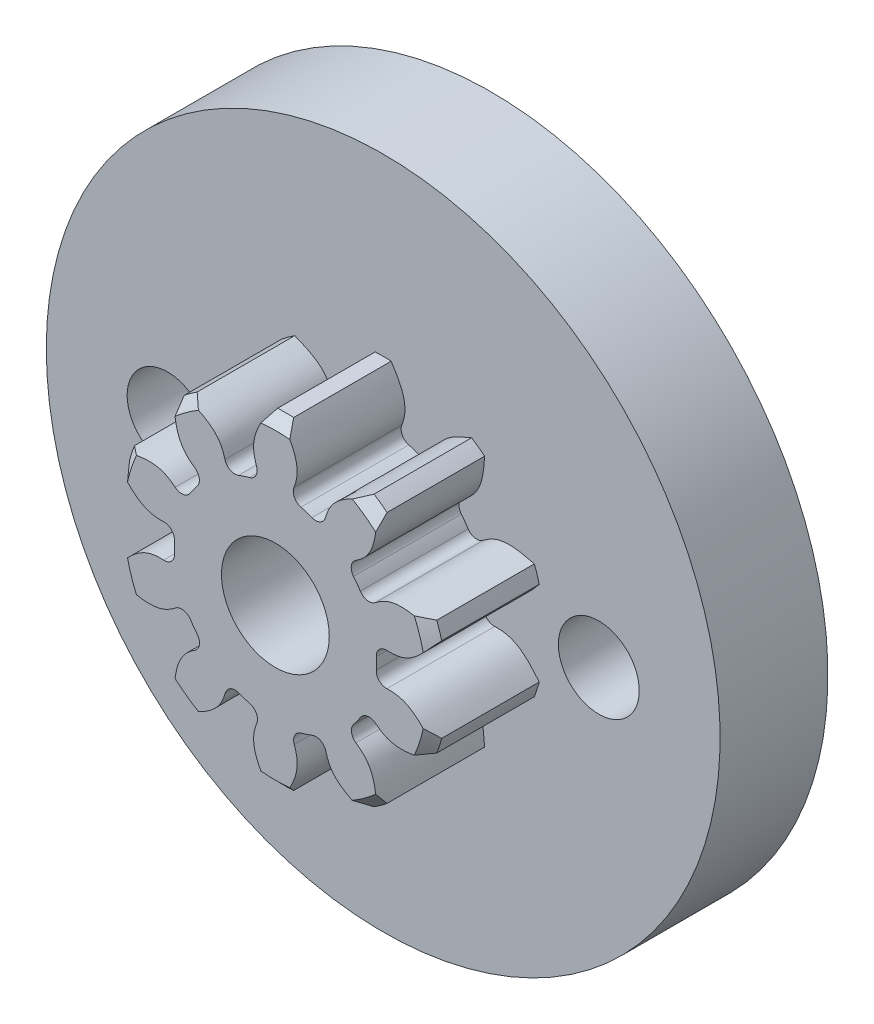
ISO-10303-21;
HEADER;
FILE_DESCRIPTION(('STEP AP214'),'2;1');
FILE_NAME('part.step','',(''),(''),'','','');
FILE_SCHEMA(('AUTOMOTIVE_DESIGN { 1 0 10303 214 1 1 1 1 }'));
ENDSEC;
DATA;
#1=APPLICATION_CONTEXT('core data for automotive mechanical design processes');
#2=APPLICATION_PROTOCOL_DEFINITION('international standard','automotive_design',2000,#1);
#3=PRODUCT_CONTEXT('',#1,'mechanical');
#4=PRODUCT('Part','Part','',(#3));
#5=PRODUCT_RELATED_PRODUCT_CATEGORY('part','',(#4));
#6=PRODUCT_DEFINITION_FORMATION('','',#4);
#7=PRODUCT_DEFINITION_CONTEXT('part definition',#1,'design');
#8=PRODUCT_DEFINITION('design','',#6,#7);
#9=PRODUCT_DEFINITION_SHAPE('','',#8);
#10=(LENGTH_UNIT() NAMED_UNIT(*) SI_UNIT(.MILLI.,.METRE.));
#11=(NAMED_UNIT(*) PLANE_ANGLE_UNIT() SI_UNIT($,.RADIAN.));
#12=(NAMED_UNIT(*) SI_UNIT($,.STERADIAN.) SOLID_ANGLE_UNIT());
#13=UNCERTAINTY_MEASURE_WITH_UNIT(LENGTH_MEASURE(1.E-05),#10,'distance_accuracy_value','');
#14=(GEOMETRIC_REPRESENTATION_CONTEXT(3) GLOBAL_UNCERTAINTY_ASSIGNED_CONTEXT((#13)) GLOBAL_UNIT_ASSIGNED_CONTEXT((#10,
#11,#12)) REPRESENTATION_CONTEXT('',''));
#15=CARTESIAN_POINT('',(0.,0.,0.));
#16=DIRECTION('',(0.,0.,1.));
#17=DIRECTION('',(1.,0.,0.));
#18=AXIS2_PLACEMENT_3D('',#15,#16,#17);
#19=CARTESIAN_POINT('',(0.,0.,-2.));
#20=DIRECTION('',(0.,0.,1.));
#21=DIRECTION('',(1.,0.,0.));
#22=AXIS2_PLACEMENT_3D('',#19,#20,#21);
#23=CYLINDRICAL_SURFACE('',#22,1.875);
#24=CARTESIAN_POINT('',(0.,0.,-2.));
#25=DIRECTION('',(0.,0.,1.));
#26=DIRECTION('',(1.,0.,0.));
#27=AXIS2_PLACEMENT_3D('',#24,#25,#26);
#28=CIRCLE('',#27,1.875);
#29=CARTESIAN_POINT('',(1.57597049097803,1.01584546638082,-2.));
#30=VERTEX_POINT('',#29);
#31=CARTESIAN_POINT('',(1.44988518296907,1.18888937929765,-2.));
#32=VERTEX_POINT('',#31);
#33=EDGE_CURVE('E490',#30,#32,#28,.T.);
#34=ORIENTED_EDGE('',*,*,#33,.T.);
#35=DIRECTION('',(0.,0.,1.));
#36=VECTOR('',#35,1.);
#37=CARTESIAN_POINT('',(1.44988518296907,1.18888937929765,-2.));
#38=LINE('',#37,#36);
#39=CARTESIAN_POINT('',(1.44988518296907,1.18888937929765,0.));
#40=VERTEX_POINT('',#39);
#41=EDGE_CURVE('E475',#32,#40,#38,.T.);
#42=ORIENTED_EDGE('',*,*,#41,.T.);
#43=CARTESIAN_POINT('',(0.,0.,0.));
#44=DIRECTION('',(0.,0.,1.));
#45=DIRECTION('',(1.,0.,0.));
#46=AXIS2_PLACEMENT_3D('',#43,#44,#45);
#47=CIRCLE('',#46,1.875);
#48=CARTESIAN_POINT('',(1.57597049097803,1.01584546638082,0.));
#49=VERTEX_POINT('',#48);
#50=EDGE_CURVE('E812',#49,#40,#47,.T.);
#51=ORIENTED_EDGE('',*,*,#50,.F.);
#52=DIRECTION('',(0.,0.,1.));
#53=VECTOR('',#52,1.);
#54=CARTESIAN_POINT('',(1.57597049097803,1.01584546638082,-2.));
#55=LINE('',#54,#53);
#56=EDGE_CURVE('E492',#49,#30,#55,.F.);
#57=ORIENTED_EDGE('',*,*,#56,.T.);
#58=EDGE_LOOP('',(#34,#42,#51,#57));
#59=FACE_BOUND('',#58,.T.);
#60=ADVANCED_FACE('F34',(#59),#23,.T.);
#61=CARTESIAN_POINT('',(1.87208589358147,-0.104495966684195,-2.));
#62=VERTEX_POINT('',#61);
#63=CARTESIAN_POINT('',(1.87179339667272,0.109610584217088,-2.));
#64=VERTEX_POINT('',#63);
#65=EDGE_CURVE('E496',#62,#64,#28,.T.);
#66=ORIENTED_EDGE('',*,*,#65,.T.);
#67=DIRECTION('',(0.,0.,1.));
#68=VECTOR('',#67,1.);
#69=CARTESIAN_POINT('',(1.87179339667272,0.109610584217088,-2.));
#70=LINE('',#69,#68);
#71=CARTESIAN_POINT('',(1.87179339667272,0.109610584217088,0.));
#72=VERTEX_POINT('',#71);
#73=EDGE_CURVE('E780',#64,#72,#70,.T.);
#74=ORIENTED_EDGE('',*,*,#73,.T.);
#75=CARTESIAN_POINT('',(1.87208589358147,-0.104495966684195,0.));
#76=VERTEX_POINT('',#75);
#77=EDGE_CURVE('E1434',#76,#72,#47,.T.);
#78=ORIENTED_EDGE('',*,*,#77,.F.);
#79=DIRECTION('',(0.,0.,1.));
#80=VECTOR('',#79,1.);
#81=CARTESIAN_POINT('',(1.87208589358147,-0.104495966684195,-2.));
#82=LINE('',#81,#80);
#83=EDGE_CURVE('E756',#76,#62,#82,.F.);
#84=ORIENTED_EDGE('',*,*,#83,.T.);
#85=EDGE_LOOP('',(#66,#74,#78,#84));
#86=FACE_BOUND('',#85,.T.);
#87=ADVANCED_FACE('F858',(#86),#23,.T.);
#88=CARTESIAN_POINT('',(1.453128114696,-1.18492349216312,-2.));
#89=VERTEX_POINT('',#88);
#90=CARTESIAN_POINT('',(1.578740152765,-1.01153572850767,-2.));
#91=VERTEX_POINT('',#90);
#92=EDGE_CURVE('E848',#89,#91,#28,.T.);
#93=ORIENTED_EDGE('',*,*,#92,.T.);
#94=DIRECTION('',(0.,0.,1.));
#95=VECTOR('',#94,1.);
#96=CARTESIAN_POINT('',(1.578740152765,-1.01153572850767,-2.));
#97=LINE('',#96,#95);
#98=CARTESIAN_POINT('',(1.578740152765,-1.01153572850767,0.));
#99=VERTEX_POINT('',#98);
#100=EDGE_CURVE('E761',#91,#99,#97,.T.);
#101=ORIENTED_EDGE('',*,*,#100,.T.);
#102=CARTESIAN_POINT('',(1.453128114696,-1.18492349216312,0.));
#103=VERTEX_POINT('',#102);
#104=EDGE_CURVE('E1430',#103,#99,#47,.T.);
#105=ORIENTED_EDGE('',*,*,#104,.F.);
#106=DIRECTION('',(0.,0.,1.));
#107=VECTOR('',#106,1.);
#108=CARTESIAN_POINT('',(1.453128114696,-1.18492349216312,-2.));
#109=LINE('',#108,#107);
#110=EDGE_CURVE('E736',#103,#89,#109,.F.);
#111=ORIENTED_EDGE('',*,*,#110,.T.);
#112=EDGE_LOOP('',(#93,#101,#105,#111));
#113=FACE_BOUND('',#112,.T.);
#114=ADVANCED_FACE('F1429',(#113),#23,.T.);
#115=CARTESIAN_POINT('',(0.479124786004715,-1.81275051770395,-2.));
#116=VERTEX_POINT('',#115);
#117=CARTESIAN_POINT('',(0.682661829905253,-1.74630977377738,-2.));
#118=VERTEX_POINT('',#117);
#119=EDGE_CURVE('E844',#116,#118,#28,.T.);
#120=ORIENTED_EDGE('',*,*,#119,.T.);
#121=DIRECTION('',(0.,0.,1.));
#122=VECTOR('',#121,1.);
#123=CARTESIAN_POINT('',(0.682661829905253,-1.74630977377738,-2.));
#124=LINE('',#123,#122);
#125=CARTESIAN_POINT('',(0.682661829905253,-1.74630977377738,0.));
#126=VERTEX_POINT('',#125);
#127=EDGE_CURVE('E741',#118,#126,#124,.T.);
#128=ORIENTED_EDGE('',*,*,#127,.T.);
#129=CARTESIAN_POINT('',(0.479124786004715,-1.81275051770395,0.));
#130=VERTEX_POINT('',#129);
#131=EDGE_CURVE('E1433',#130,#126,#47,.T.);
#132=ORIENTED_EDGE('',*,*,#131,.F.);
#133=DIRECTION('',(0.,0.,1.));
#134=VECTOR('',#133,1.);
#135=CARTESIAN_POINT('',(0.479124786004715,-1.81275051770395,-2.));
#136=LINE('',#135,#134);
#137=EDGE_CURVE('E716',#130,#116,#136,.F.);
#138=ORIENTED_EDGE('',*,*,#137,.T.);
#139=EDGE_LOOP('',(#120,#128,#132,#138));
#140=FACE_BOUND('',#139,.T.);
#141=ADVANCED_FACE('F1522',(#140),#23,.T.);
#142=CARTESIAN_POINT('',(-0.677887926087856,-1.74816845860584,-2.));
#143=VERTEX_POINT('',#142);
#144=CARTESIAN_POINT('',(-0.474170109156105,-1.81405284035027,-2.));
#145=VERTEX_POINT('',#144);
#146=EDGE_CURVE('E840',#143,#145,#28,.T.);
#147=ORIENTED_EDGE('',*,*,#146,.T.);
#148=DIRECTION('',(0.,0.,1.));
#149=VECTOR('',#148,1.);
#150=CARTESIAN_POINT('',(-0.474170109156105,-1.81405284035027,-2.));
#151=LINE('',#150,#149);
#152=CARTESIAN_POINT('',(-0.474170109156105,-1.81405284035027,0.));
#153=VERTEX_POINT('',#152);
#154=EDGE_CURVE('E721',#145,#153,#151,.T.);
#155=ORIENTED_EDGE('',*,*,#154,.T.);
#156=CARTESIAN_POINT('',(-0.677887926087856,-1.74816845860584,0.));
#157=VERTEX_POINT('',#156);
#158=EDGE_CURVE('E1436',#157,#153,#47,.T.);
#159=ORIENTED_EDGE('',*,*,#158,.F.);
#160=DIRECTION('',(0.,0.,1.));
#161=VECTOR('',#160,1.);
#162=CARTESIAN_POINT('',(-0.677887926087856,-1.74816845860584,-2.));
#163=LINE('',#162,#161);
#164=EDGE_CURVE('E696',#157,#143,#163,.F.);
#165=ORIENTED_EDGE('',*,*,#164,.T.);
#166=EDGE_LOOP('',(#147,#155,#159,#165));
#167=FACE_BOUND('',#166,.T.);
#168=ADVANCED_FACE('F1518',(#167),#23,.T.);
#169=CARTESIAN_POINT('',(-1.57597049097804,-1.01584546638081,-2.));
#170=VERTEX_POINT('',#169);
#171=CARTESIAN_POINT('',(-1.44988518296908,-1.18888937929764,-2.));
#172=VERTEX_POINT('',#171);
#173=EDGE_CURVE('E836',#170,#172,#28,.T.);
#174=ORIENTED_EDGE('',*,*,#173,.T.);
#175=DIRECTION('',(0.,0.,1.));
#176=VECTOR('',#175,1.);
#177=CARTESIAN_POINT('',(-1.44988518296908,-1.18888937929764,-2.));
#178=LINE('',#177,#176);
#179=CARTESIAN_POINT('',(-1.44988518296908,-1.18888937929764,0.));
#180=VERTEX_POINT('',#179);
#181=EDGE_CURVE('E701',#172,#180,#178,.T.);
#182=ORIENTED_EDGE('',*,*,#181,.T.);
#183=CARTESIAN_POINT('',(-1.57597049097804,-1.01584546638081,0.));
#184=VERTEX_POINT('',#183);
#185=EDGE_CURVE('E2251',#184,#180,#47,.T.);
#186=ORIENTED_EDGE('',*,*,#185,.F.);
#187=DIRECTION('',(0.,0.,1.));
#188=VECTOR('',#187,1.);
#189=CARTESIAN_POINT('',(-1.57597049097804,-1.01584546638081,-2.));
#190=LINE('',#189,#188);
#191=EDGE_CURVE('E676',#184,#170,#190,.F.);
#192=ORIENTED_EDGE('',*,*,#191,.T.);
#193=EDGE_LOOP('',(#174,#182,#186,#192));
#194=FACE_BOUND('',#193,.T.);
#195=ADVANCED_FACE('F1514',(#194),#23,.T.);
#196=CARTESIAN_POINT('',(-1.87208589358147,0.104495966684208,-2.));
#197=VERTEX_POINT('',#196);
#198=CARTESIAN_POINT('',(-1.87179339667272,-0.109610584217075,-2.));
#199=VERTEX_POINT('',#198);
#200=EDGE_CURVE('E832',#197,#199,#28,.T.);
#201=ORIENTED_EDGE('',*,*,#200,.T.);
#202=DIRECTION('',(0.,0.,1.));
#203=VECTOR('',#202,1.);
#204=CARTESIAN_POINT('',(-1.87179339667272,-0.109610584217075,-2.));
#205=LINE('',#204,#203);
#206=CARTESIAN_POINT('',(-1.87179339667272,-0.109610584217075,0.));
#207=VERTEX_POINT('',#206);
#208=EDGE_CURVE('E681',#199,#207,#205,.T.);
#209=ORIENTED_EDGE('',*,*,#208,.T.);
#210=CARTESIAN_POINT('',(-1.87208589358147,0.104495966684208,0.));
#211=VERTEX_POINT('',#210);
#212=EDGE_CURVE('E2253',#211,#207,#47,.T.);
#213=ORIENTED_EDGE('',*,*,#212,.F.);
#214=DIRECTION('',(0.,0.,1.));
#215=VECTOR('',#214,1.);
#216=CARTESIAN_POINT('',(-1.87208589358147,0.104495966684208,-2.));
#217=LINE('',#216,#215);
#218=EDGE_CURVE('E656',#211,#197,#217,.F.);
#219=ORIENTED_EDGE('',*,*,#218,.T.);
#220=EDGE_LOOP('',(#201,#209,#213,#219));
#221=FACE_BOUND('',#220,.T.);
#222=ADVANCED_FACE('F1510',(#221),#23,.T.);
#223=CARTESIAN_POINT('',(-1.453128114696,1.18492349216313,-2.));
#224=VERTEX_POINT('',#223);
#225=CARTESIAN_POINT('',(-1.57874015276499,1.01153572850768,-2.));
#226=VERTEX_POINT('',#225);
#227=EDGE_CURVE('E827',#224,#226,#28,.T.);
#228=ORIENTED_EDGE('',*,*,#227,.T.);
#229=DIRECTION('',(0.,0.,1.));
#230=VECTOR('',#229,1.);
#231=CARTESIAN_POINT('',(-1.578740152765,1.01153572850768,-2.));
#232=LINE('',#231,#230);
#233=CARTESIAN_POINT('',(-1.57874015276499,1.01153572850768,0.));
#234=VERTEX_POINT('',#233);
#235=EDGE_CURVE('E661',#226,#234,#232,.T.);
#236=ORIENTED_EDGE('',*,*,#235,.T.);
#237=CARTESIAN_POINT('',(-1.453128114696,1.18492349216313,0.));
#238=VERTEX_POINT('',#237);
#239=EDGE_CURVE('E824',#238,#234,#47,.T.);
#240=ORIENTED_EDGE('',*,*,#239,.F.);
#241=DIRECTION('',(0.,0.,1.));
#242=VECTOR('',#241,1.);
#243=CARTESIAN_POINT('',(-1.453128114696,1.18492349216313,-2.));
#244=LINE('',#243,#242);
#245=EDGE_CURVE('E636',#238,#224,#244,.F.);
#246=ORIENTED_EDGE('',*,*,#245,.T.);
#247=EDGE_LOOP('',(#228,#236,#240,#246));
#248=FACE_BOUND('',#247,.T.);
#249=ADVANCED_FACE('F1506',(#248),#23,.T.);
#250=CARTESIAN_POINT('',(-0.479124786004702,1.81275051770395,-2.));
#251=VERTEX_POINT('',#250);
#252=CARTESIAN_POINT('',(-0.682661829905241,1.74630977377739,-2.));
#253=VERTEX_POINT('',#252);
#254=EDGE_CURVE('E822',#251,#253,#28,.T.);
#255=ORIENTED_EDGE('',*,*,#254,.T.);
#256=DIRECTION('',(0.,0.,1.));
#257=VECTOR('',#256,1.);
#258=CARTESIAN_POINT('',(-0.682661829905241,1.74630977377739,-2.));
#259=LINE('',#258,#257);
#260=CARTESIAN_POINT('',(-0.682661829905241,1.74630977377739,0.));
#261=VERTEX_POINT('',#260);
#262=EDGE_CURVE('E641',#253,#261,#259,.T.);
#263=ORIENTED_EDGE('',*,*,#262,.T.);
#264=CARTESIAN_POINT('',(-0.479124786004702,1.81275051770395,0.));
#265=VERTEX_POINT('',#264);
#266=EDGE_CURVE('E815',#265,#261,#47,.T.);
#267=ORIENTED_EDGE('',*,*,#266,.F.);
#268=DIRECTION('',(0.,0.,1.));
#269=VECTOR('',#268,1.);
#270=CARTESIAN_POINT('',(-0.479124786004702,1.81275051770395,-2.));
#271=LINE('',#270,#269);
#272=EDGE_CURVE('E1474',#265,#251,#271,.F.);
#273=ORIENTED_EDGE('',*,*,#272,.T.);
#274=EDGE_LOOP('',(#255,#263,#267,#273));
#275=FACE_BOUND('',#274,.T.);
#276=ADVANCED_FACE('F1479',(#275),#23,.T.);
#277=CARTESIAN_POINT('',(0.677887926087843,1.74816845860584,0.));
#278=VERTEX_POINT('',#277);
#279=CARTESIAN_POINT('',(0.474170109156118,1.81405284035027,0.));
#280=VERTEX_POINT('',#279);
#281=EDGE_CURVE('E800',#278,#280,#47,.T.);
#282=ORIENTED_EDGE('',*,*,#281,.F.);
#283=DIRECTION('',(0.,0.,1.));
#284=VECTOR('',#283,1.);
#285=CARTESIAN_POINT('',(0.677887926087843,1.74816845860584,-2.));
#286=LINE('',#285,#284);
#287=CARTESIAN_POINT('',(0.677887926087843,1.74816845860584,-2.));
#288=VERTEX_POINT('',#287);
#289=EDGE_CURVE('E794',#278,#288,#286,.F.);
#290=ORIENTED_EDGE('',*,*,#289,.T.);
#291=CARTESIAN_POINT('',(0.474170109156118,1.81405284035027,-2.));
#292=VERTEX_POINT('',#291);
#293=EDGE_CURVE('E497',#288,#292,#28,.T.);
#294=ORIENTED_EDGE('',*,*,#293,.T.);
#295=DIRECTION('',(0.,0.,1.));
#296=VECTOR('',#295,1.);
#297=CARTESIAN_POINT('',(0.474170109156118,1.81405284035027,-2.));
#298=LINE('',#297,#296);
#299=EDGE_CURVE('E810',#292,#280,#298,.T.);
#300=ORIENTED_EDGE('',*,*,#299,.T.);
#301=EDGE_LOOP('',(#282,#290,#294,#300));
#302=FACE_BOUND('',#301,.T.);
#303=ADVANCED_FACE('F36',(#302),#23,.T.);
#304=CARTESIAN_POINT('',(0.,0.,0.));
#305=DIRECTION('',(0.,0.,1.));
#306=DIRECTION('',(1.,0.,0.));
#307=AXIS2_PLACEMENT_3D('',#304,#305,#306);
#308=PLANE('',#307);
#309=CARTESIAN_POINT('',(0.,0.,0.));
#310=DIRECTION('',(0.,0.,1.));
#311=DIRECTION('',(1.,0.,0.));
#312=AXIS2_PLACEMENT_3D('',#309,#310,#311);
#313=CIRCLE('',#312,1.);
#314=CARTESIAN_POINT('',(1.,0.,0.));
#315=VERTEX_POINT('',#314);
#316=EDGE_CURVE('E2040',#315,#315,#313,.T.);
#317=ORIENTED_EDGE('',*,*,#316,.F.);
#318=EDGE_LOOP('',(#317));
#319=FACE_BOUND('',#318,.T.);
#320=CARTESIAN_POINT('',(1.07985413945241,1.23309241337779,0.));
#321=CARTESIAN_POINT('',(1.2810376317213,1.36879239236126,0.));
#322=CARTESIAN_POINT('',(1.58997508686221,1.46409530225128,0.));
#323=CARTESIAN_POINT('',(1.84938441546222,1.88842290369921,0.));
#324=CARTESIAN_POINT('',(1.86738162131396,2.13888124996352,0.));
#325=CARTESIAN_POINT('',(1.88158799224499,2.33658439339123,0.));
#326=B_SPLINE_CURVE_WITH_KNOTS('',3,(#320,#321,#322,#323,#324,#325),.UNSPECIFIED.,.F.,.F.,(4,1,
1,4),(0.,0.497260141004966,0.603154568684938,1.),.UNSPECIFIED.);
#327=CARTESIAN_POINT('',(1.49426172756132,1.46931503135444,0.));
#328=VERTEX_POINT('',#327);
#329=CARTESIAN_POINT('',(1.86068916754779,2.10569129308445,0.));
#330=VERTEX_POINT('',#329);
#331=EDGE_CURVE('E2062',#328,#330,#326,.T.);
#332=ORIENTED_EDGE('',*,*,#331,.T.);
#333=CARTESIAN_POINT('',(0.,0.,0.));
#334=DIRECTION('',(0.,0.,1.));
#335=DIRECTION('',(1.,0.,0.));
#336=AXIS2_PLACEMENT_3D('',#333,#334,#335);
#337=CIRCLE('',#336,2.81);
#338=CARTESIAN_POINT('',(1.42742631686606,2.42044502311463,0.));
#339=VERTEX_POINT('',#338);
#340=EDGE_CURVE('E915',#330,#339,#337,.T.);
#341=ORIENTED_EDGE('',*,*,#340,.T.);
#342=CARTESIAN_POINT('',(1.64078114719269,2.51154080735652,0.));
#343=CARTESIAN_POINT('',(1.45681575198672,2.43701640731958,0.));
#344=CARTESIAN_POINT('',(1.22376094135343,2.34260588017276,0.));
#345=CARTESIAN_POINT('',(0.902681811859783,1.96420188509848,0.));
#346=CARTESIAN_POINT('',(0.887290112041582,1.6458763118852,0.));
#347=CARTESIAN_POINT('',(0.83904729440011,1.40804882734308,0.));
#348=B_SPLINE_CURVE_WITH_KNOTS('',3,(#342,#343,#344,#345,#346,#347),.UNSPECIFIED.,.F.,.F.,(4,1,
1,4),(0.,0.396845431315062,0.502739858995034,1.),.UNSPECIFIED.);
#349=CARTESIAN_POINT('',(0.929239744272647,1.8730129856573,0.));
#350=VERTEX_POINT('',#349);
#351=EDGE_CURVE('E803',#339,#350,#348,.T.);
#352=ORIENTED_EDGE('',*,*,#351,.T.);
#353=CARTESIAN_POINT('',(0.746580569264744,1.92531619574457,0.));
#354=DIRECTION('',(0.,0.,1.));
#355=DIRECTION('',(1.,0.,0.));
#356=AXIS2_PLACEMENT_3D('',#353,#354,#355);
#357=CIRCLE('',#356,0.19);
#358=EDGE_CURVE('E486',#350,#278,#357,.F.);
#359=ORIENTED_EDGE('',*,*,#358,.T.);
#360=ORIENTED_EDGE('',*,*,#281,.T.);
#361=CARTESIAN_POINT('',(0.522219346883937,1.99787686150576,0.));
#362=DIRECTION('',(0.,0.,1.));
#363=DIRECTION('',(1.,0.,0.));
#364=AXIS2_PLACEMENT_3D('',#361,#362,#363);
#365=CIRCLE('',#364,0.19);
#366=CARTESIAN_POINT('',(0.345241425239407,2.06700583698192,0.));
#367=VERTEX_POINT('',#366);
#368=EDGE_CURVE('E1463',#280,#367,#365,.F.);
#369=ORIENTED_EDGE('',*,*,#368,.T.);
#370=CARTESIAN_POINT('',(0.148826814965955,1.63231505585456,0.));
#371=CARTESIAN_POINT('',(0.231825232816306,1.86035133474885,0.));
#372=CARTESIAN_POINT('',(0.425743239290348,2.11904188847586,0.));
#373=CARTESIAN_POINT('',(0.386196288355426,2.61480710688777,0.));
#374=CARTESIAN_POINT('',(0.253540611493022,2.82801065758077,0.));
#375=CARTESIAN_POINT('',(0.148826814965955,2.99630615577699,0.));
#376=B_SPLINE_CURVE_WITH_KNOTS('',3,(#370,#371,#372,#373,#374,#375),.UNSPECIFIED.,.F.,.F.,(4,1,
1,4),(0.,0.497260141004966,0.603154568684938,1.),.UNSPECIFIED.);
#377=CARTESIAN_POINT('',(0.267634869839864,2.79722569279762,0.));
#378=VERTEX_POINT('',#377);
#379=EDGE_CURVE('E586',#367,#378,#376,.T.);
#380=ORIENTED_EDGE('',*,*,#379,.T.);
#381=CARTESIAN_POINT('',(0.,0.,0.));
#382=DIRECTION('',(0.,0.,1.));
#383=DIRECTION('',(1.,0.,0.));
#384=AXIS2_PLACEMENT_3D('',#381,#382,#383);
#385=CIRCLE('',#384,2.81);
#386=CARTESIAN_POINT('',(-0.267889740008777,2.79720129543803,0.));
#387=VERTEX_POINT('',#386);
#388=EDGE_CURVE('E1460',#378,#387,#385,.T.);
#389=ORIENTED_EDGE('',*,*,#388,.T.);
#390=CARTESIAN_POINT('',(-0.148826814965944,2.99630615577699,0.));
#391=CARTESIAN_POINT('',(-0.253853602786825,2.82788250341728,0.));
#392=CARTESIAN_POINT('',(-0.386905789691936,2.61451660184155,0.));
#393=CARTESIAN_POINT('',(-0.424243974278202,2.11965576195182,0.));
#394=CARTESIAN_POINT('',(-0.249589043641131,1.85307794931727,0.));
#395=CARTESIAN_POINT('',(-0.148826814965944,1.63231505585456,0.));
#396=B_SPLINE_CURVE_WITH_KNOTS('',3,(#390,#391,#392,#393,#394,#395),.UNSPECIFIED.,.F.,.F.,(4,1,
1,4),(0.,0.396845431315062,0.502739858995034,1.),.UNSPECIFIED.);
#397=CARTESIAN_POINT('',(-0.349158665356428,2.06149275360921,0.));
#398=VERTEX_POINT('',#397);
#399=EDGE_CURVE('E593',#387,#398,#396,.T.);
#400=ORIENTED_EDGE('',*,*,#399,.T.);
#401=CARTESIAN_POINT('',(-0.527676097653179,1.99644257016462,0.));
#402=DIRECTION('',(0.,0.,1.));
#403=DIRECTION('',(1.,0.,0.));
#404=AXIS2_PLACEMENT_3D('',#401,#402,#403);
#405=CIRCLE('',#404,0.19);
#406=EDGE_CURVE('E1469',#398,#265,#405,.F.);
#407=ORIENTED_EDGE('',*,*,#406,.T.);
#408=ORIENTED_EDGE('',*,*,#266,.T.);
#409=CARTESIAN_POINT('',(-0.751838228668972,1.92326916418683,0.));
#410=DIRECTION('',(0.,0.,1.));
#411=DIRECTION('',(1.,0.,0.));
#412=AXIS2_PLACEMENT_3D('',#409,#410,#411);
#413=CIRCLE('',#412,0.19);
#414=CARTESIAN_POINT('',(-0.935649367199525,1.87517066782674,0.));
#415=VERTEX_POINT('',#414);
#416=EDGE_CURVE('E651',#261,#415,#413,.F.);
#417=ORIENTED_EDGE('',*,*,#416,.T.);
#418=CARTESIAN_POINT('',(-0.839047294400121,1.40804882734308,0.));
#419=CARTESIAN_POINT('',(-0.905936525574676,1.64131929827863,0.));
#420=CARTESIAN_POINT('',(-0.901108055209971,1.96458649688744,0.));
#421=CARTESIAN_POINT('',(-1.22450569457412,2.34242386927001,0.));
#422=CARTESIAN_POINT('',(-1.45714429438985,2.43693611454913,0.));
#423=CARTESIAN_POINT('',(-1.64078114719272,2.5115408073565,0.));
#424=B_SPLINE_CURVE_WITH_KNOTS('',3,(#418,#419,#420,#421,#422,#423),.UNSPECIFIED.,.F.,.F.,(4,1,
1,4),(0.,0.497260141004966,0.603154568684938,1.),.UNSPECIFIED.);
#425=CARTESIAN_POINT('',(-1.42764685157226,2.4203149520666,0.));
#426=VERTEX_POINT('',#425);
#427=EDGE_CURVE('E1233',#415,#426,#424,.T.);
#428=ORIENTED_EDGE('',*,*,#427,.T.);
#429=CARTESIAN_POINT('',(0.,0.,0.));
#430=DIRECTION('',(0.,0.,1.));
#431=DIRECTION('',(1.,0.,0.));
#432=AXIS2_PLACEMENT_3D('',#429,#430,#431);
#433=CIRCLE('',#432,2.81);
#434=CARTESIAN_POINT('',(-1.86088102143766,2.10552174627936,0.));
#435=VERTEX_POINT('',#434);
#436=EDGE_CURVE('E506',#426,#435,#433,.T.);
#437=ORIENTED_EDGE('',*,*,#436,.T.);
#438=CARTESIAN_POINT('',(-1.88158799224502,2.33658439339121,0.));
#439=CARTESIAN_POINT('',(-1.86755950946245,2.13859359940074,0.));
#440=CARTESIAN_POINT('',(-1.84978765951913,1.88777084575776,0.));
#441=CARTESIAN_POINT('',(-1.58912298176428,1.46547318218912,0.));
#442=CARTESIAN_POINT('',(-1.29113366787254,1.35246679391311,0.));
#443=CARTESIAN_POINT('',(-1.07985413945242,1.23309241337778,0.));
#444=B_SPLINE_CURVE_WITH_KNOTS('',3,(#438,#439,#440,#441,#442,#443),.UNSPECIFIED.,.F.,.F.,(4,1,
1,4),(0.,0.396845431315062,0.502739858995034,1.),.UNSPECIFIED.);
#445=CARTESIAN_POINT('',(-1.49419033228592,1.46255235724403,0.));
#446=VERTEX_POINT('',#445);
#447=EDGE_CURVE('E566',#435,#446,#444,.T.);
#448=ORIENTED_EDGE('',*,*,#447,.T.);
#449=CARTESIAN_POINT('',(-1.60037843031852,1.30499573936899,0.));
#450=DIRECTION('',(0.,0.,1.));
#451=DIRECTION('',(1.,0.,0.));
#452=AXIS2_PLACEMENT_3D('',#449,#450,#451);
#453=CIRCLE('',#452,0.19);
#454=EDGE_CURVE('E643',#446,#238,#453,.F.);
#455=ORIENTED_EDGE('',*,*,#454,.T.);
#456=ORIENTED_EDGE('',*,*,#239,.T.);
#457=CARTESIAN_POINT('',(-1.73871915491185,1.11403801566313,0.));
#458=DIRECTION('',(0.,0.,1.));
#459=DIRECTION('',(1.,0.,0.));
#460=AXIS2_PLACEMENT_3D('',#457,#458,#459);
#461=CIRCLE('',#460,0.19);
#462=CARTESIAN_POINT('',(-1.85915390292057,0.967084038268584,0.));
#463=VERTEX_POINT('',#462);
#464=EDGE_CURVE('E671',#234,#463,#461,.F.);
#465=ORIENTED_EDGE('',*,*,#464,.T.);
#466=CARTESIAN_POINT('',(-1.50643385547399,0.64595580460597,0.));
#467=CARTESIAN_POINT('',(-1.69766132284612,0.795359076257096,0.));
#468=CARTESIAN_POINT('',(-1.8837667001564,1.05972583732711,0.));
#469=CARTESIAN_POINT('',(-2.36748812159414,1.17531432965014,0.));
#470=CARTESIAN_POINT('',(-2.61124960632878,1.11503480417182,0.));
#471=CARTESIAN_POINT('',(-2.80366647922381,1.06745223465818,0.));
#472=B_SPLINE_CURVE_WITH_KNOTS('',3,(#466,#467,#468,#469,#470,#471),.UNSPECIFIED.,.F.,.F.,(4,1,
1,4),(0.,0.497260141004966,0.603154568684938,1.),.UNSPECIFIED.);
#473=CARTESIAN_POINT('',(-2.57761599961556,1.1189261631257,0.));
#474=VERTEX_POINT('',#473);
#475=EDGE_CURVE('E1265',#463,#474,#472,.T.);
#476=ORIENTED_EDGE('',*,*,#475,.T.);
#477=CARTESIAN_POINT('',(0.,0.,0.));
#478=DIRECTION('',(0.,0.,1.));
#479=DIRECTION('',(1.,0.,0.));
#480=AXIS2_PLACEMENT_3D('',#477,#478,#479);
#481=CIRCLE('',#480,2.81);
#482=CARTESIAN_POINT('',(-2.74307900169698,0.609604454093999,0.));
#483=VERTEX_POINT('',#482);
#484=EDGE_CURVE('E547',#474,#483,#481,.T.);
#485=ORIENTED_EDGE('',*,*,#484,.T.);
#486=CARTESIAN_POINT('',(-2.89564650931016,0.784366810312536,0.));
#487=CARTESIAN_POINT('',(-2.7679211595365,0.632434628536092,0.));
#488=CARTESIAN_POINT('',(-2.60611351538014,0.439960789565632,0.));
#489=CARTESIAN_POINT('',(-2.14701102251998,0.251529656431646,0.));
#490=CARTESIAN_POINT('',(-1.83950911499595,0.335259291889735,0.));
#491=CARTESIAN_POINT('',(-1.59841388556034,0.362870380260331,0.));
#492=B_SPLINE_CURVE_WITH_KNOTS('',3,(#486,#487,#488,#489,#490,#491),.UNSPECIFIED.,.F.,.F.,(4,1,
1,4),(0.,0.396845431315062,0.502739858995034,1.),.UNSPECIFIED.);
#493=CARTESIAN_POINT('',(-2.06849207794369,0.304966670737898,0.));
#494=VERTEX_POINT('',#493);
#495=EDGE_CURVE('E1213',#483,#494,#492,.T.);
#496=ORIENTED_EDGE('',*,*,#495,.T.);
#497=CARTESIAN_POINT('',(-2.06179059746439,0.115084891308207,0.));
#498=DIRECTION('',(0.,0.,1.));
#499=DIRECTION('',(1.,0.,0.));
#500=AXIS2_PLACEMENT_3D('',#497,#498,#499);
#501=CIRCLE('',#500,0.19);
#502=EDGE_CURVE('E663',#494,#211,#501,.F.);
#503=ORIENTED_EDGE('',*,*,#502,.T.);
#504=ORIENTED_EDGE('',*,*,#212,.T.);
#505=CARTESIAN_POINT('',(-2.06146846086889,-0.120717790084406,0.));
#506=DIRECTION('',(0.,0.,1.));
#507=DIRECTION('',(1.,0.,0.));
#508=AXIS2_PLACEMENT_3D('',#505,#506,#507);
#509=CIRCLE('',#508,0.19);
#510=CARTESIAN_POINT('',(-2.07252483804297,-0.310395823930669,0.));
#511=VERTEX_POINT('',#510);
#512=EDGE_CURVE('E691',#207,#511,#509,.F.);
#513=ORIENTED_EDGE('',*,*,#512,.T.);
#514=CARTESIAN_POINT('',(-1.59841388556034,-0.362870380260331,0.));
#515=CARTESIAN_POINT('',(-1.84093719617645,-0.354401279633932,0.));
#516=CARTESIAN_POINT('',(-2.14689049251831,-0.249914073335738,0.));
#517=CARTESIAN_POINT('',(-2.60617055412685,-0.440725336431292,0.));
#518=CARTESIAN_POINT('',(-2.76794632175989,-0.632771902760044,0.));
#519=CARTESIAN_POINT('',(-2.89564650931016,-0.784366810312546,0.));
#520=B_SPLINE_CURVE_WITH_KNOTS('',3,(#514,#515,#516,#517,#518,#519),.UNSPECIFIED.,.F.,.F.,(4,1,
1,4),(0.,0.497260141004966,0.603154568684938,1.),.UNSPECIFIED.);
#521=CARTESIAN_POINT('',(-2.74302344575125,-0.609854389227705,0.));
#522=VERTEX_POINT('',#521);
#523=EDGE_CURVE('E1288',#511,#522,#520,.T.);
#524=ORIENTED_EDGE('',*,*,#523,.T.);
#525=CARTESIAN_POINT('',(0.,0.,0.));
#526=DIRECTION('',(0.,0.,1.));
#527=DIRECTION('',(1.,0.,0.));
#528=AXIS2_PLACEMENT_3D('',#525,#526,#527);
#529=CIRCLE('',#528,2.81);
#530=CARTESIAN_POINT('',(-2.57751403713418,-1.11916101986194,0.));
#531=VERTEX_POINT('',#530);
#532=EDGE_CURVE('E1191',#522,#531,#529,.T.);
#533=ORIENTED_EDGE('',*,*,#532,.T.);
#534=CARTESIAN_POINT('',(-2.80366647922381,-1.06745223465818,0.));
#535=CARTESIAN_POINT('',(-2.61103100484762,-1.11529287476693,0.));
#536=CARTESIAN_POINT('',(-2.3669925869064,-1.17589933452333,0.));
#537=CARTESIAN_POINT('',(-1.88481382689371,-1.05848964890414,0.));
#538=CARTESIAN_POINT('',(-1.68525460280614,-0.810005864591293,0.));
#539=CARTESIAN_POINT('',(-1.50643385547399,-0.64595580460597,0.));
#540=B_SPLINE_CURVE_WITH_KNOTS('',3,(#534,#535,#536,#537,#538,#539),.UNSPECIFIED.,.F.,.F.,(4,1,
1,4),(0.,0.396845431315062,0.502739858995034,1.),.UNSPECIFIED.);
#541=CARTESIAN_POINT('',(-1.85270015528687,-0.969105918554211,0.));
#542=VERTEX_POINT('',#541);
#543=EDGE_CURVE('E1162',#531,#542,#540,.T.);
#544=ORIENTED_EDGE('',*,*,#543,.T.);
#545=CARTESIAN_POINT('',(-1.73566883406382,-1.11878447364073,0.));
#546=DIRECTION('',(0.,0.,1.));
#547=DIRECTION('',(1.,0.,0.));
#548=AXIS2_PLACEMENT_3D('',#545,#546,#547);
#549=CIRCLE('',#548,0.19);
#550=EDGE_CURVE('E683',#542,#184,#549,.F.);
#551=ORIENTED_EDGE('',*,*,#550,.T.);
#552=ORIENTED_EDGE('',*,*,#185,.T.);
#553=CARTESIAN_POINT('',(-1.59680688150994,-1.30936350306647,0.));
#554=DIRECTION('',(0.,0.,1.));
#555=DIRECTION('',(1.,0.,0.));
#556=AXIS2_PLACEMENT_3D('',#553,#554,#555);
#557=CIRCLE('',#556,0.19);
#558=CARTESIAN_POINT('',(-1.49426172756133,-1.46931503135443,0.));
#559=VERTEX_POINT('',#558);
#560=EDGE_CURVE('E711',#180,#559,#557,.F.);
#561=ORIENTED_EDGE('',*,*,#560,.T.);
#562=CARTESIAN_POINT('',(-1.07985413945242,-1.23309241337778,0.));
#563=CARTESIAN_POINT('',(-1.28103763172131,-1.36879239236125,0.));
#564=CARTESIAN_POINT('',(-1.58997508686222,-1.46409530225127,0.));
#565=CARTESIAN_POINT('',(-1.84938441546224,-1.8884229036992,0.));
#566=CARTESIAN_POINT('',(-1.86738162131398,-2.13888124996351,0.));
#567=CARTESIAN_POINT('',(-1.88158799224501,-2.33658439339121,0.));
#568=B_SPLINE_CURVE_WITH_KNOTS('',3,(#562,#563,#564,#565,#566,#567),.UNSPECIFIED.,.F.,.F.,(4,1,
1,4),(0.,0.497260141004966,0.603154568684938,1.),.UNSPECIFIED.);
#569=CARTESIAN_POINT('',(-1.8606891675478,-2.10569129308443,0.));
#570=VERTEX_POINT('',#569);
#571=EDGE_CURVE('E1323',#559,#570,#568,.T.);
#572=ORIENTED_EDGE('',*,*,#571,.T.);
#573=CARTESIAN_POINT('',(0.,0.,0.));
#574=DIRECTION('',(0.,0.,1.));
#575=DIRECTION('',(1.,0.,0.));
#576=AXIS2_PLACEMENT_3D('',#573,#574,#575);
#577=CIRCLE('',#576,2.81);
#578=CARTESIAN_POINT('',(-1.42742631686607,-2.42044502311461,0.));
#579=VERTEX_POINT('',#578);
#580=EDGE_CURVE('E1129',#570,#579,#577,.T.);
#581=ORIENTED_EDGE('',*,*,#580,.T.);
#582=CARTESIAN_POINT('',(-1.64078114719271,-2.5115408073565,0.));
#583=CARTESIAN_POINT('',(-1.45681575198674,-2.43701640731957,0.));
#584=CARTESIAN_POINT('',(-1.22376094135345,-2.34260588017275,0.));
#585=CARTESIAN_POINT('',(-0.902681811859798,-1.96420188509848,0.));
#586=CARTESIAN_POINT('',(-0.887290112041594,-1.64587631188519,0.));
#587=CARTESIAN_POINT('',(-0.839047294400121,-1.40804882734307,0.));
#588=B_SPLINE_CURVE_WITH_KNOTS('',3,(#582,#583,#584,#585,#586,#587),.UNSPECIFIED.,.F.,.F.,(4,1,
1,4),(0.,0.396845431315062,0.502739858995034,1.),.UNSPECIFIED.);
#589=CARTESIAN_POINT('',(-0.929239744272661,-1.8730129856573,0.));
#590=VERTEX_POINT('',#589);
#591=EDGE_CURVE('E1316',#579,#590,#588,.T.);
#592=ORIENTED_EDGE('',*,*,#591,.T.);
#593=CARTESIAN_POINT('',(-0.746580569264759,-1.92531619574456,0.));
#594=DIRECTION('',(0.,0.,1.));
#595=DIRECTION('',(1.,0.,0.));
#596=AXIS2_PLACEMENT_3D('',#593,#594,#595);
#597=CIRCLE('',#596,0.19);
#598=EDGE_CURVE('E703',#590,#157,#597,.F.);
#599=ORIENTED_EDGE('',*,*,#598,.T.);
#600=ORIENTED_EDGE('',*,*,#158,.T.);
#601=CARTESIAN_POINT('',(-0.522219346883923,-1.99787686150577,0.));
#602=DIRECTION('',(0.,0.,1.));
#603=DIRECTION('',(1.,0.,0.));
#604=AXIS2_PLACEMENT_3D('',#601,#602,#603);
#605=CIRCLE('',#604,0.19);
#606=CARTESIAN_POINT('',(-0.345241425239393,-2.06700583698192,0.));
#607=VERTEX_POINT('',#606);
#608=EDGE_CURVE('E731',#153,#607,#605,.F.);
#609=ORIENTED_EDGE('',*,*,#608,.T.);
#610=CARTESIAN_POINT('',(-0.148826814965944,-1.63231505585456,0.));
#611=CARTESIAN_POINT('',(-0.231825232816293,-1.86035133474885,0.));
#612=CARTESIAN_POINT('',(-0.425743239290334,-2.11904188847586,0.));
#613=CARTESIAN_POINT('',(-0.386196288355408,-2.61480710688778,0.));
#614=CARTESIAN_POINT('',(-0.253540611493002,-2.82801065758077,0.));
#615=CARTESIAN_POINT('',(-0.148826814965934,-2.99630615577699,0.));
#616=B_SPLINE_CURVE_WITH_KNOTS('',3,(#610,#611,#612,#613,#614,#615),.UNSPECIFIED.,.F.,.F.,(4,1,
1,4),(0.,0.497260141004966,0.603154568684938,1.),.UNSPECIFIED.);
#617=CARTESIAN_POINT('',(-0.267634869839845,-2.79722569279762,0.));
#618=VERTEX_POINT('',#617);
#619=EDGE_CURVE('E1345',#607,#618,#616,.T.);
#620=ORIENTED_EDGE('',*,*,#619,.T.);
#621=CARTESIAN_POINT('',(0.,0.,0.));
#622=DIRECTION('',(0.,0.,1.));
#623=DIRECTION('',(1.,0.,0.));
#624=AXIS2_PLACEMENT_3D('',#621,#622,#623);
#625=CIRCLE('',#624,2.81);
#626=CARTESIAN_POINT('',(0.267889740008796,-2.79720129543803,0.));
#627=VERTEX_POINT('',#626);
#628=EDGE_CURVE('E1100',#618,#627,#625,.T.);
#629=ORIENTED_EDGE('',*,*,#628,.T.);
#630=CARTESIAN_POINT('',(0.148826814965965,-2.99630615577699,0.));
#631=CARTESIAN_POINT('',(0.253853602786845,-2.82788250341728,0.));
#632=CARTESIAN_POINT('',(0.386905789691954,-2.61451660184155,0.));
#633=CARTESIAN_POINT('',(0.424243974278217,-2.11965576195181,0.));
#634=CARTESIAN_POINT('',(0.249589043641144,-1.85307794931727,0.));
#635=CARTESIAN_POINT('',(0.148826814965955,-1.63231505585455,0.));
#636=B_SPLINE_CURVE_WITH_KNOTS('',3,(#630,#631,#632,#633,#634,#635),.UNSPECIFIED.,.F.,.F.,(4,1,
1,4),(0.,0.396845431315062,0.502739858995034,1.),.UNSPECIFIED.);
#637=CARTESIAN_POINT('',(0.349158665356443,-2.06149275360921,0.));
#638=VERTEX_POINT('',#637);
#639=EDGE_CURVE('E1071',#627,#638,#636,.T.);
#640=ORIENTED_EDGE('',*,*,#639,.T.);
#641=CARTESIAN_POINT('',(0.527676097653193,-1.99644257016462,0.));
#642=DIRECTION('',(0.,0.,1.));
#643=DIRECTION('',(1.,0.,0.));
#644=AXIS2_PLACEMENT_3D('',#641,#642,#643);
#645=CIRCLE('',#644,0.19);
#646=EDGE_CURVE('E723',#638,#130,#645,.F.);
#647=ORIENTED_EDGE('',*,*,#646,.T.);
#648=ORIENTED_EDGE('',*,*,#131,.T.);
#649=CARTESIAN_POINT('',(0.751838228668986,-1.92326916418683,0.));
#650=DIRECTION('',(0.,0.,1.));
#651=DIRECTION('',(1.,0.,0.));
#652=AXIS2_PLACEMENT_3D('',#649,#650,#651);
#653=CIRCLE('',#652,0.19);
#654=CARTESIAN_POINT('',(0.935649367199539,-1.87517066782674,0.));
#655=VERTEX_POINT('',#654);
#656=EDGE_CURVE('E751',#126,#655,#653,.F.);
#657=ORIENTED_EDGE('',*,*,#656,.T.);
#658=CARTESIAN_POINT('',(0.839047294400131,-1.40804882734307,0.));
#659=CARTESIAN_POINT('',(0.905936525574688,-1.64131929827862,0.));
#660=CARTESIAN_POINT('',(0.901108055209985,-1.96458649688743,0.));
#661=CARTESIAN_POINT('',(1.22450569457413,-2.34242386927,0.));
#662=CARTESIAN_POINT('',(1.45714429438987,-2.43693611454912,0.));
#663=CARTESIAN_POINT('',(1.64078114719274,-2.51154080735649,0.));
#664=B_SPLINE_CURVE_WITH_KNOTS('',3,(#658,#659,#660,#661,#662,#663),.UNSPECIFIED.,.F.,.F.,(4,1,
1,4),(0.,0.497260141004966,0.603154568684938,1.),.UNSPECIFIED.);
#665=CARTESIAN_POINT('',(1.42764685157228,-2.42031495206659,0.));
#666=VERTEX_POINT('',#665);
#667=EDGE_CURVE('E1383',#655,#666,#664,.T.);
#668=ORIENTED_EDGE('',*,*,#667,.T.);
#669=CARTESIAN_POINT('',(0.,0.,0.));
#670=DIRECTION('',(0.,0.,1.));
#671=DIRECTION('',(1.,0.,0.));
#672=AXIS2_PLACEMENT_3D('',#669,#670,#671);
#673=CIRCLE('',#672,2.81);
#674=CARTESIAN_POINT('',(1.86088102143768,-2.10552174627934,0.));
#675=VERTEX_POINT('',#674);
#676=EDGE_CURVE('E1038',#666,#675,#673,.T.);
#677=ORIENTED_EDGE('',*,*,#676,.T.);
#678=CARTESIAN_POINT('',(1.88158799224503,-2.33658439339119,0.));
#679=CARTESIAN_POINT('',(1.86755950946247,-2.13859359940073,0.));
#680=CARTESIAN_POINT('',(1.84978765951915,-1.88777084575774,0.));
#681=CARTESIAN_POINT('',(1.58912298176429,-1.46547318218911,0.));
#682=CARTESIAN_POINT('',(1.29113366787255,-1.3524667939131,0.));
#683=CARTESIAN_POINT('',(1.07985413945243,-1.23309241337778,0.));
#684=B_SPLINE_CURVE_WITH_KNOTS('',3,(#678,#679,#680,#681,#682,#683),.UNSPECIFIED.,.F.,.F.,(4,1,
1,4),(0.,0.396845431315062,0.502739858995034,1.),.UNSPECIFIED.);
#685=CARTESIAN_POINT('',(1.49419033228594,-1.46255235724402,0.));
#686=VERTEX_POINT('',#685);
#687=EDGE_CURVE('E1376',#675,#686,#684,.T.);
#688=ORIENTED_EDGE('',*,*,#687,.T.);
#689=CARTESIAN_POINT('',(1.60037843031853,-1.30499573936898,0.));
#690=DIRECTION('',(0.,0.,1.));
#691=DIRECTION('',(1.,0.,0.));
#692=AXIS2_PLACEMENT_3D('',#689,#690,#691);
#693=CIRCLE('',#692,0.19);
#694=EDGE_CURVE('E743',#686,#103,#693,.F.);
#695=ORIENTED_EDGE('',*,*,#694,.T.);
#696=ORIENTED_EDGE('',*,*,#104,.T.);
#697=CARTESIAN_POINT('',(1.73871915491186,-1.11403801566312,0.));
#698=DIRECTION('',(0.,0.,1.));
#699=DIRECTION('',(1.,0.,0.));
#700=AXIS2_PLACEMENT_3D('',#697,#698,#699);
#701=CIRCLE('',#700,0.19);
#702=CARTESIAN_POINT('',(1.85915390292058,-0.967084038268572,0.));
#703=VERTEX_POINT('',#702);
#704=EDGE_CURVE('E771',#99,#703,#701,.F.);
#705=ORIENTED_EDGE('',*,*,#704,.T.);
#706=CARTESIAN_POINT('',(1.50643385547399,-0.64595580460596,0.));
#707=CARTESIAN_POINT('',(1.69766132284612,-0.795359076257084,0.));
#708=CARTESIAN_POINT('',(1.8837667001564,-1.0597258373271,0.));
#709=CARTESIAN_POINT('',(2.36748812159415,-1.17531432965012,0.));
#710=CARTESIAN_POINT('',(2.61124960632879,-1.1150348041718,0.));
#711=CARTESIAN_POINT('',(2.80366647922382,-1.06745223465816,0.));
#712=B_SPLINE_CURVE_WITH_KNOTS('',3,(#706,#707,#708,#709,#710,#711),.UNSPECIFIED.,.F.,.F.,(4,1,
1,4),(0.,0.497260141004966,0.603154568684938,1.),.UNSPECIFIED.);
#713=CARTESIAN_POINT('',(2.57761599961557,-1.11892616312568,0.));
#714=VERTEX_POINT('',#713);
#715=EDGE_CURVE('E957',#703,#714,#712,.T.);
#716=ORIENTED_EDGE('',*,*,#715,.T.);
#717=CARTESIAN_POINT('',(0.,0.,0.));
#718=DIRECTION('',(0.,0.,1.));
#719=DIRECTION('',(1.,0.,0.));
#720=AXIS2_PLACEMENT_3D('',#717,#718,#719);
#721=CIRCLE('',#720,2.81);
#722=CARTESIAN_POINT('',(2.74307900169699,-0.60960445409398,0.));
#723=VERTEX_POINT('',#722);
#724=EDGE_CURVE('E1007',#714,#723,#721,.T.);
#725=ORIENTED_EDGE('',*,*,#724,.T.);
#726=CARTESIAN_POINT('',(2.89564650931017,-0.784366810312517,0.));
#727=CARTESIAN_POINT('',(2.7679211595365,-0.632434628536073,0.));
#728=CARTESIAN_POINT('',(2.60611351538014,-0.439960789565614,0.));
#729=CARTESIAN_POINT('',(2.14701102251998,-0.251529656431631,0.));
#730=CARTESIAN_POINT('',(1.83950911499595,-0.335259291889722,0.));
#731=CARTESIAN_POINT('',(1.59841388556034,-0.36287038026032,0.));
#732=B_SPLINE_CURVE_WITH_KNOTS('',3,(#726,#727,#728,#729,#730,#731),.UNSPECIFIED.,.F.,.F.,(4,1,
1,4),(0.,0.396845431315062,0.502739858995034,1.),.UNSPECIFIED.);
#733=CARTESIAN_POINT('',(2.06849207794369,-0.304966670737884,0.));
#734=VERTEX_POINT('',#733);
#735=EDGE_CURVE('E963',#723,#734,#732,.T.);
#736=ORIENTED_EDGE('',*,*,#735,.T.);
#737=CARTESIAN_POINT('',(2.06179059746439,-0.115084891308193,0.));
#738=DIRECTION('',(0.,0.,1.));
#739=DIRECTION('',(1.,0.,0.));
#740=AXIS2_PLACEMENT_3D('',#737,#738,#739);
#741=CIRCLE('',#740,0.19);
#742=EDGE_CURVE('E763',#734,#76,#741,.F.);
#743=ORIENTED_EDGE('',*,*,#742,.T.);
#744=ORIENTED_EDGE('',*,*,#77,.T.);
#745=CARTESIAN_POINT('',(2.06146846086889,0.12071779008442,0.));
#746=DIRECTION('',(0.,0.,1.));
#747=DIRECTION('',(1.,0.,0.));
#748=AXIS2_PLACEMENT_3D('',#745,#746,#747);
#749=CIRCLE('',#748,0.19);
#750=CARTESIAN_POINT('',(2.07252483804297,0.310395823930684,0.));
#751=VERTEX_POINT('',#750);
#752=EDGE_CURVE('E789',#72,#751,#749,.F.);
#753=ORIENTED_EDGE('',*,*,#752,.T.);
#754=CARTESIAN_POINT('',(1.59841388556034,0.362870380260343,0.));
#755=CARTESIAN_POINT('',(1.84093719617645,0.354401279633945,0.));
#756=CARTESIAN_POINT('',(2.14689049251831,0.249914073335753,0.));
#757=CARTESIAN_POINT('',(2.60617055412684,0.440725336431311,0.));
#758=CARTESIAN_POINT('',(2.76794632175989,0.632771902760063,0.));
#759=CARTESIAN_POINT('',(2.89564650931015,0.784366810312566,0.));
#760=B_SPLINE_CURVE_WITH_KNOTS('',3,(#754,#755,#756,#757,#758,#759),.UNSPECIFIED.,.F.,.F.,(4,1,
1,4),(0.,0.497260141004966,0.603154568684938,1.),.UNSPECIFIED.);
#761=CARTESIAN_POINT('',(2.74302344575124,0.609854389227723,0.));
#762=VERTEX_POINT('',#761);
#763=EDGE_CURVE('E880',#751,#762,#760,.T.);
#764=ORIENTED_EDGE('',*,*,#763,.T.);
#765=CARTESIAN_POINT('',(0.,0.,0.));
#766=DIRECTION('',(0.,0.,1.));
#767=DIRECTION('',(1.,0.,0.));
#768=AXIS2_PLACEMENT_3D('',#765,#766,#767);
#769=CIRCLE('',#768,2.81);
#770=CARTESIAN_POINT('',(2.57751403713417,1.11916101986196,0.));
#771=VERTEX_POINT('',#770);
#772=EDGE_CURVE('E937',#762,#771,#769,.T.);
#773=ORIENTED_EDGE('',*,*,#772,.T.);
#774=CARTESIAN_POINT('',(2.8036664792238,1.0674522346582,0.));
#775=CARTESIAN_POINT('',(2.61103100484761,1.11529287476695,0.));
#776=CARTESIAN_POINT('',(2.36699258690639,1.17589933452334,0.));
#777=CARTESIAN_POINT('',(1.8848138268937,1.05848964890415,0.));
#778=CARTESIAN_POINT('',(1.68525460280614,0.810005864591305,0.));
#779=CARTESIAN_POINT('',(1.50643385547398,0.64595580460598,0.));
#780=B_SPLINE_CURVE_WITH_KNOTS('',3,(#774,#775,#776,#777,#778,#779),.UNSPECIFIED.,.F.,.F.,(4,1,
1,4),(0.,0.396845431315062,0.502739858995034,1.),.UNSPECIFIED.);
#781=CARTESIAN_POINT('',(1.85270015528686,0.969105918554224,0.));
#782=VERTEX_POINT('',#781);
#783=EDGE_CURVE('E876',#771,#782,#780,.T.);
#784=ORIENTED_EDGE('',*,*,#783,.T.);
#785=CARTESIAN_POINT('',(1.73566883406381,1.11878447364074,0.));
#786=DIRECTION('',(0.,0.,1.));
#787=DIRECTION('',(1.,0.,0.));
#788=AXIS2_PLACEMENT_3D('',#785,#786,#787);
#789=CIRCLE('',#788,0.19);
#790=EDGE_CURVE('E782',#782,#49,#789,.F.);
#791=ORIENTED_EDGE('',*,*,#790,.T.);
#792=ORIENTED_EDGE('',*,*,#50,.T.);
#793=CARTESIAN_POINT('',(1.59680688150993,1.30936350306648,0.));
#794=DIRECTION('',(0.,0.,1.));
#795=DIRECTION('',(1.,0.,0.));
#796=AXIS2_PLACEMENT_3D('',#793,#794,#795);
#797=CIRCLE('',#796,0.19);
#798=EDGE_CURVE('E482',#40,#328,#797,.F.);
#799=ORIENTED_EDGE('',*,*,#798,.T.);
#800=EDGE_LOOP('',(#332,#341,#352,#359,#360,#369,#380,#389,#400,#407,#408,#417,#428,#437,#448,
#455,#456,#465,#476,#485,#496,#503,#504,#513,#524,#533,#544,#551,#552,#561,#572,#581,#592,#599,
#600,#609,#620,#629,#640,#647,#648,#657,#668,#677,#688,#695,#696,#705,#716,#725,#736,#743,#744,
#753,#764,#773,#784,#791,#792,#799));
#801=FACE_BOUND('',#800,.T.);
#802=ADVANCED_FACE('F619',(#319,#801),#308,.T.);
#803=CARTESIAN_POINT('',(0.148826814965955,1.63231505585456,-2.));
#804=CARTESIAN_POINT('',(0.231825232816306,1.86035133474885,-2.));
#805=CARTESIAN_POINT('',(0.425743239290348,2.11904188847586,-2.));
#806=CARTESIAN_POINT('',(0.386196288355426,2.61480710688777,-2.));
#807=CARTESIAN_POINT('',(0.253540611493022,2.82801065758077,-2.));
#808=CARTESIAN_POINT('',(0.148826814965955,2.99630615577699,-2.));
#809=B_SPLINE_CURVE_WITH_KNOTS('',3,(#803,#804,#805,#806,#807,#808),.UNSPECIFIED.,.F.,.F.,(4,1,
1,4),(0.,0.497260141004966,0.603154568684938,1.),.UNSPECIFIED.);
#810=DIRECTION('',(0.,0.,1.));
#811=VECTOR('',#810,1.);
#812=SURFACE_OF_LINEAR_EXTRUSION('',#809,#811);
#813=DIRECTION('',(0.,0.,1.));
#814=VECTOR('',#813,1.);
#815=CARTESIAN_POINT('',(0.148826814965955,2.99630615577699,-2.));
#816=LINE('',#815,#814);
#817=CARTESIAN_POINT('',(0.148826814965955,2.99630615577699,-2.));
#818=VERTEX_POINT('',#817);
#819=CARTESIAN_POINT('',(0.148826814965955,2.99630615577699,-0.190000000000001));
#820=VERTEX_POINT('',#819);
#821=EDGE_CURVE('E1438',#818,#820,#816,.T.);
#822=ORIENTED_EDGE('',*,*,#821,.T.);
#823=CARTESIAN_POINT('',(0.148826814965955,2.99630615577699,-0.190000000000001));
#824=CARTESIAN_POINT('',(0.159022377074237,2.97991912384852,-0.174137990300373));
#825=CARTESIAN_POINT('',(0.169235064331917,2.96350610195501,-0.158313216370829));
#826=CARTESIAN_POINT('',(0.189558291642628,2.93059161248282,-0.126694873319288));
#827=CARTESIAN_POINT('',(0.199668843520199,2.9140901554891,-0.110901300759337));
#828=CARTESIAN_POINT('',(0.219654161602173,2.88095799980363,-0.0792979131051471));
#829=CARTESIAN_POINT('',(0.22952892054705,2.86432729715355,-0.0634880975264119));
#830=CARTESIAN_POINT('',(0.248900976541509,2.83090462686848,-0.0318038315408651));
#831=CARTESIAN_POINT('',(0.258398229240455,2.81411264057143,-0.015929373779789));
#832=CARTESIAN_POINT('',(0.267634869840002,2.79722569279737,0.));
#833=B_SPLINE_CURVE_WITH_KNOTS('',3,(#823,#824,#825,#826,#827,#828,#829,#830,#831,#832),
.UNSPECIFIED.,.F.,.F.,(4,2,2,2,4),(0.,0.074945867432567,0.149882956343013,0.224822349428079,
0.299770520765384),.UNSPECIFIED.);
#834=EDGE_CURVE('E624',#820,#378,#833,.T.);
#835=ORIENTED_EDGE('',*,*,#834,.T.);
#836=ORIENTED_EDGE('',*,*,#379,.F.);
#837=DIRECTION('',(0.,0.,1.));
#838=VECTOR('',#837,1.);
#839=CARTESIAN_POINT('',(0.345241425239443,2.06700583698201,0.));
#840=LINE('',#839,#838);
#841=CARTESIAN_POINT('',(0.345241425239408,2.06700583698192,-2.));
#842=VERTEX_POINT('',#841);
#843=EDGE_CURVE('E1471',#367,#842,#840,.F.);
#844=ORIENTED_EDGE('',*,*,#843,.T.);
#845=EDGE_CURVE('E600',#842,#818,#809,.T.);
#846=ORIENTED_EDGE('',*,*,#845,.T.);
#847=EDGE_LOOP('',(#822,#835,#836,#844,#846));
#848=FACE_BOUND('',#847,.T.);
#849=ADVANCED_FACE('F614',(#848),#812,.T.);
#850=CARTESIAN_POINT('',(-0.148826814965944,2.99630615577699,-2.));
#851=CARTESIAN_POINT('',(-0.253853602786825,2.82788250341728,-2.));
#852=CARTESIAN_POINT('',(-0.386905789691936,2.61451660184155,-2.));
#853=CARTESIAN_POINT('',(-0.424243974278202,2.11965576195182,-2.));
#854=CARTESIAN_POINT('',(-0.249589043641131,1.85307794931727,-2.));
#855=CARTESIAN_POINT('',(-0.148826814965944,1.63231505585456,-2.));
#856=B_SPLINE_CURVE_WITH_KNOTS('',3,(#850,#851,#852,#853,#854,#855),.UNSPECIFIED.,.F.,.F.,(4,1,
1,4),(0.,0.396845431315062,0.502739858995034,1.),.UNSPECIFIED.);
#857=DIRECTION('',(0.,0.,1.));
#858=VECTOR('',#857,1.);
#859=SURFACE_OF_LINEAR_EXTRUSION('',#856,#858);
#860=ORIENTED_EDGE('',*,*,#399,.F.);
#861=CARTESIAN_POINT('',(-0.267889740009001,2.79720129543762,0.));
#862=CARTESIAN_POINT('',(-0.258636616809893,2.81409236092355,-0.0159309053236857));
#863=CARTESIAN_POINT('',(-0.249120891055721,2.83088773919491,-0.0318061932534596));
#864=CARTESIAN_POINT('',(-0.229709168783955,2.86431602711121,-0.0634911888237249));
#865=CARTESIAN_POINT('',(-0.219813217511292,2.88094895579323,-0.0793009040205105));
#866=CARTESIAN_POINT('',(-0.199784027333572,2.9140847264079,-0.110903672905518));
#867=CARTESIAN_POINT('',(-0.18965079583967,2.93058757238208,-0.126696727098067));
#868=CARTESIAN_POINT('',(-0.169281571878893,2.96350436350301,-0.158314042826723));
#869=CARTESIAN_POINT('',(-0.159045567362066,2.97991829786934,-0.174138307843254));
#870=CARTESIAN_POINT('',(-0.148826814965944,2.99630615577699,-0.190000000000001));
#871=B_SPLINE_CURVE_WITH_KNOTS('',3,(#861,#862,#863,#864,#865,#866,#867,#868,#869,#870),
.UNSPECIFIED.,.F.,.F.,(4,2,2,2,4),(0.,0.0749776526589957,0.149946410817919,0.224912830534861,
0.299888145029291),.UNSPECIFIED.);
#872=CARTESIAN_POINT('',(-0.148826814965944,2.99630615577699,-0.190000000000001));
#873=VERTEX_POINT('',#872);
#874=EDGE_CURVE('E1454',#387,#873,#871,.T.);
#875=ORIENTED_EDGE('',*,*,#874,.T.);
#876=DIRECTION('',(0.,0.,1.));
#877=VECTOR('',#876,1.);
#878=CARTESIAN_POINT('',(-0.148826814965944,2.99630615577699,-2.));
#879=LINE('',#878,#877);
#880=CARTESIAN_POINT('',(-0.148826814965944,2.99630615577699,-2.));
#881=VERTEX_POINT('',#880);
#882=EDGE_CURVE('E813',#881,#873,#879,.T.);
#883=ORIENTED_EDGE('',*,*,#882,.F.);
#884=CARTESIAN_POINT('',(-0.349158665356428,2.06149275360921,-2.));
#885=VERTEX_POINT('',#884);
#886=EDGE_CURVE('E1441',#881,#885,#856,.T.);
#887=ORIENTED_EDGE('',*,*,#886,.T.);
#888=DIRECTION('',(0.,0.,1.));
#889=VECTOR('',#888,1.);
#890=CARTESIAN_POINT('',(-0.349158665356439,2.06149275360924,-2.));
#891=LINE('',#890,#889);
#892=EDGE_CURVE('E826',#885,#398,#891,.T.);
#893=ORIENTED_EDGE('',*,*,#892,.T.);
#894=EDGE_LOOP('',(#860,#875,#883,#887,#893));
#895=FACE_BOUND('',#894,.T.);
#896=ADVANCED_FACE('F618',(#895),#859,.T.);
#897=CARTESIAN_POINT('',(0.,0.,-2.));
#898=DIRECTION('',(0.,0.,1.));
#899=DIRECTION('',(1.,0.,0.));
#900=AXIS2_PLACEMENT_3D('',#897,#898,#899);
#901=CYLINDRICAL_SURFACE('',#900,3.);
#902=ORIENTED_EDGE('',*,*,#882,.T.);
#903=CARTESIAN_POINT('',(0.,0.,-0.190000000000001));
#904=DIRECTION('',(0.,0.,1.));
#905=DIRECTION('',(1.,0.,0.));
#906=AXIS2_PLACEMENT_3D('',#903,#904,#905);
#907=CIRCLE('',#906,3.);
#908=EDGE_CURVE('E632',#873,#820,#907,.F.);
#909=ORIENTED_EDGE('',*,*,#908,.T.);
#910=ORIENTED_EDGE('',*,*,#821,.F.);
#911=CARTESIAN_POINT('',(0.,0.,-2.));
#912=DIRECTION('',(0.,0.,1.));
#913=DIRECTION('',(1.,0.,0.));
#914=AXIS2_PLACEMENT_3D('',#911,#912,#913);
#915=CIRCLE('',#914,3.);
#916=EDGE_CURVE('E608',#818,#881,#915,.T.);
#917=ORIENTED_EDGE('',*,*,#916,.T.);
#918=EDGE_LOOP('',(#902,#909,#910,#917));
#919=FACE_BOUND('',#918,.T.);
#920=ADVANCED_FACE('F621',(#919),#901,.T.);
#921=CARTESIAN_POINT('',(-0.527676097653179,1.99644257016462,-1.));
#922=DIRECTION('',(0.,0.,1.));
#923=DIRECTION('',(1.,0.,0.));
#924=AXIS2_PLACEMENT_3D('',#921,#922,#923);
#925=CYLINDRICAL_SURFACE('',#924,0.19);
#926=CARTESIAN_POINT('',(-0.527676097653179,1.99644257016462,-2.));
#927=DIRECTION('',(0.,0.,1.));
#928=DIRECTION('',(1.,0.,0.));
#929=AXIS2_PLACEMENT_3D('',#926,#927,#928);
#930=CIRCLE('',#929,0.19);
#931=EDGE_CURVE('E1466',#251,#885,#930,.T.);
#932=ORIENTED_EDGE('',*,*,#931,.F.);
#933=ORIENTED_EDGE('',*,*,#272,.F.);
#934=ORIENTED_EDGE('',*,*,#406,.F.);
#935=ORIENTED_EDGE('',*,*,#892,.F.);
#936=EDGE_LOOP('',(#932,#933,#934,#935));
#937=FACE_BOUND('',#936,.T.);
#938=ADVANCED_FACE('F1453',(#937),#925,.F.);
#939=CARTESIAN_POINT('',(0.522219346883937,1.99787686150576,-1.));
#940=DIRECTION('',(0.,0.,1.));
#941=DIRECTION('',(1.,0.,0.));
#942=AXIS2_PLACEMENT_3D('',#939,#940,#941);
#943=CYLINDRICAL_SURFACE('',#942,0.19);
#944=ORIENTED_EDGE('',*,*,#368,.F.);
#945=ORIENTED_EDGE('',*,*,#299,.F.);
#946=CARTESIAN_POINT('',(0.522219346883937,1.99787686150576,-2.));
#947=DIRECTION('',(0.,0.,1.));
#948=DIRECTION('',(1.,0.,0.));
#949=AXIS2_PLACEMENT_3D('',#946,#947,#948);
#950=CIRCLE('',#949,0.19);
#951=EDGE_CURVE('E821',#842,#292,#950,.T.);
#952=ORIENTED_EDGE('',*,*,#951,.F.);
#953=ORIENTED_EDGE('',*,*,#843,.F.);
#954=EDGE_LOOP('',(#944,#945,#952,#953));
#955=FACE_BOUND('',#954,.T.);
#956=ADVANCED_FACE('F1613',(#955),#943,.F.);
#957=CARTESIAN_POINT('',(0.,0.,0.));
#958=DIRECTION('',(0.,0.,-1.));
#959=DIRECTION('',(-1.,0.,0.));
#960=AXIS2_PLACEMENT_3D('',#957,#958,#959);
#961=CONICAL_SURFACE('',#960,2.81,0.785398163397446);
#962=ORIENTED_EDGE('',*,*,#834,.F.);
#963=ORIENTED_EDGE('',*,*,#908,.F.);
#964=ORIENTED_EDGE('',*,*,#874,.F.);
#965=ORIENTED_EDGE('',*,*,#388,.F.);
#966=EDGE_LOOP('',(#962,#963,#964,#965));
#967=FACE_BOUND('',#966,.T.);
#968=ADVANCED_FACE('F554',(#967),#961,.T.);
#969=CARTESIAN_POINT('',(-0.839047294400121,1.40804882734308,-2.));
#970=CARTESIAN_POINT('',(-0.905936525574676,1.64131929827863,-2.));
#971=CARTESIAN_POINT('',(-0.901108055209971,1.96458649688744,-2.));
#972=CARTESIAN_POINT('',(-1.22450569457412,2.34242386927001,-2.));
#973=CARTESIAN_POINT('',(-1.45714429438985,2.43693611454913,-2.));
#974=CARTESIAN_POINT('',(-1.64078114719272,2.5115408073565,-2.));
#975=B_SPLINE_CURVE_WITH_KNOTS('',3,(#969,#970,#971,#972,#973,#974),.UNSPECIFIED.,.F.,.F.,(4,1,
1,4),(0.,0.497260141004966,0.603154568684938,1.),.UNSPECIFIED.);
#976=DIRECTION('',(0.,0.,1.));
#977=VECTOR('',#976,1.);
#978=SURFACE_OF_LINEAR_EXTRUSION('',#975,#977);
#979=DIRECTION('',(0.,0.,1.));
#980=VECTOR('',#979,1.);
#981=CARTESIAN_POINT('',(-1.64078114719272,2.5115408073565,-2.));
#982=LINE('',#981,#980);
#983=CARTESIAN_POINT('',(-1.64078114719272,2.5115408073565,-2.));
#984=VERTEX_POINT('',#983);
#985=CARTESIAN_POINT('',(-1.64078114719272,2.5115408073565,-0.19));
#986=VERTEX_POINT('',#985);
#987=EDGE_CURVE('E579',#984,#986,#982,.T.);
#988=ORIENTED_EDGE('',*,*,#987,.T.);
#989=CARTESIAN_POINT('',(-1.64078114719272,2.5115408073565,-0.19));
#990=CARTESIAN_POINT('',(-1.62290070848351,2.50427622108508,-0.174137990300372));
#991=CARTESIAN_POINT('',(-1.60499113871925,2.49700067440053,-0.158313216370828));
#992=CARTESIAN_POINT('',(-1.56920265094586,2.48231798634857,-0.126694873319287));
#993=CARTESIAN_POINT('',(-1.55132372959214,2.47491086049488,-0.110901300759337));
#994=CARTESIAN_POINT('',(-1.51568067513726,2.45985345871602,-0.0792979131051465));
#995=CARTESIAN_POINT('',(-1.49791654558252,2.45220317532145,-0.0634880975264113));
#996=CARTESIAN_POINT('',(-1.46259887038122,2.43655027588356,-0.0318038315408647));
#997=CARTESIAN_POINT('',(-1.4450453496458,2.42854761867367,-0.0159293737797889));
#998=CARTESIAN_POINT('',(-1.427646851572,2.42031495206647,0.));
#999=B_SPLINE_CURVE_WITH_KNOTS('',3,(#989,#990,#991,#992,#993,#994,#995,#996,#997,#998),
.UNSPECIFIED.,.F.,.F.,(4,2,2,2,4),(0.,0.074945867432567,0.149882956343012,0.224822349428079,
0.299770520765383),.UNSPECIFIED.);
#1000=EDGE_CURVE('E540',#986,#426,#999,.T.);
#1001=ORIENTED_EDGE('',*,*,#1000,.T.);
#1002=ORIENTED_EDGE('',*,*,#427,.F.);
#1003=DIRECTION('',(0.,0.,1.));
#1004=VECTOR('',#1003,1.);
#1005=CARTESIAN_POINT('',(-0.935649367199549,1.87517066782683,0.));
#1006=LINE('',#1005,#1004);
#1007=CARTESIAN_POINT('',(-0.935649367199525,1.87517066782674,-2.));
#1008=VERTEX_POINT('',#1007);
#1009=EDGE_CURVE('E638',#415,#1008,#1006,.F.);
#1010=ORIENTED_EDGE('',*,*,#1009,.T.);
#1011=EDGE_CURVE('E559',#1008,#984,#975,.T.);
#1012=ORIENTED_EDGE('',*,*,#1011,.T.);
#1013=EDGE_LOOP('',(#988,#1001,#1002,#1010,#1012));
#1014=FACE_BOUND('',#1013,.T.);
#1015=ADVANCED_FACE('F549',(#1014),#978,.T.);
#1016=CARTESIAN_POINT('',(-1.88158799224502,2.33658439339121,-2.));
#1017=CARTESIAN_POINT('',(-1.86755950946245,2.13859359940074,-2.));
#1018=CARTESIAN_POINT('',(-1.84978765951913,1.88777084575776,-2.));
#1019=CARTESIAN_POINT('',(-1.58912298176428,1.46547318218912,-2.));
#1020=CARTESIAN_POINT('',(-1.29113366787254,1.35246679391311,-2.));
#1021=CARTESIAN_POINT('',(-1.07985413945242,1.23309241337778,-2.));
#1022=B_SPLINE_CURVE_WITH_KNOTS('',3,(#1016,#1017,#1018,#1019,#1020,#1021),.UNSPECIFIED.,.F.,
.F.,(4,1,1,4),(0.,0.396845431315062,0.502739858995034,1.),.UNSPECIFIED.);
#1023=DIRECTION('',(0.,0.,1.));
#1024=VECTOR('',#1023,1.);
#1025=SURFACE_OF_LINEAR_EXTRUSION('',#1022,#1024);
#1026=ORIENTED_EDGE('',*,*,#447,.F.);
#1027=CARTESIAN_POINT('',(-1.8608810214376,2.1055217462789,0.));
#1028=CARTESIAN_POINT('',(-1.86332340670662,2.12462575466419,-0.0159309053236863));
#1029=CARTESIAN_POINT('',(-1.86549709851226,2.14380670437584,-0.0318061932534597));
#1030=CARTESIAN_POINT('',(-1.8694413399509,2.18226068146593,-0.0634911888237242));
#1031=CARTESIAN_POINT('',(-1.87121193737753,2.20153369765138,-0.0793009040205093));
#1032=CARTESIAN_POINT('',(-1.87448469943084,2.24011396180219,-0.110903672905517));
#1033=CARTESIAN_POINT('',(-1.87598687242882,2.25942120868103,-0.126696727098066));
#1034=CARTESIAN_POINT('',(-1.87885582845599,2.29802418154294,-0.158314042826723));
#1035=CARTESIAN_POINT('',(-1.88022259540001,2.31731990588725,-0.174138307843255));
#1036=CARTESIAN_POINT('',(-1.88158799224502,2.33658439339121,-0.19));
#1037=B_SPLINE_CURVE_WITH_KNOTS('',3,(#1027,#1028,#1029,#1030,#1031,#1032,#1033,#1034,#1035,
#1036),.UNSPECIFIED.,.F.,.F.,(4,2,2,2,4),(0.,0.0749776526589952,0.149946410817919,
0.224912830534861,0.29988814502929),.UNSPECIFIED.);
#1038=CARTESIAN_POINT('',(-1.88158799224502,2.33658439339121,-0.19));
#1039=VERTEX_POINT('',#1038);
#1040=EDGE_CURVE('E514',#435,#1039,#1037,.T.);
#1041=ORIENTED_EDGE('',*,*,#1040,.T.);
#1042=DIRECTION('',(0.,0.,1.));
#1043=VECTOR('',#1042,1.);
#1044=CARTESIAN_POINT('',(-1.88158799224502,2.33658439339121,-2.));
#1045=LINE('',#1044,#1043);
#1046=CARTESIAN_POINT('',(-1.88158799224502,2.33658439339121,-2.));
#1047=VERTEX_POINT('',#1046);
#1048=EDGE_CURVE('E580',#1047,#1039,#1045,.T.);
#1049=ORIENTED_EDGE('',*,*,#1048,.F.);
#1050=CARTESIAN_POINT('',(-1.49419033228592,1.46255235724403,-2.));
#1051=VERTEX_POINT('',#1050);
#1052=EDGE_CURVE('E574',#1047,#1051,#1022,.T.);
#1053=ORIENTED_EDGE('',*,*,#1052,.T.);
#1054=DIRECTION('',(0.,0.,1.));
#1055=VECTOR('',#1054,1.);
#1056=CARTESIAN_POINT('',(-1.49419033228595,1.46255235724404,-2.));
#1057=LINE('',#1056,#1055);
#1058=EDGE_CURVE('E631',#1051,#446,#1057,.T.);
#1059=ORIENTED_EDGE('',*,*,#1058,.T.);
#1060=EDGE_LOOP('',(#1026,#1041,#1049,#1053,#1059));
#1061=FACE_BOUND('',#1060,.T.);
#1062=ADVANCED_FACE('F524',(#1061),#1025,.T.);
#1063=CARTESIAN_POINT('',(0.,0.,-2.));
#1064=DIRECTION('',(0.,0.,1.));
#1065=DIRECTION('',(1.,0.,0.));
#1066=AXIS2_PLACEMENT_3D('',#1063,#1064,#1065);
#1067=CYLINDRICAL_SURFACE('',#1066,3.);
#1068=ORIENTED_EDGE('',*,*,#1048,.T.);
#1069=CARTESIAN_POINT('',(0.,0.,-0.19));
#1070=DIRECTION('',(0.,0.,1.));
#1071=DIRECTION('',(1.,0.,0.));
#1072=AXIS2_PLACEMENT_3D('',#1069,#1070,#1071);
#1073=CIRCLE('',#1072,3.);
#1074=EDGE_CURVE('E522',#1039,#986,#1073,.F.);
#1075=ORIENTED_EDGE('',*,*,#1074,.T.);
#1076=ORIENTED_EDGE('',*,*,#987,.F.);
#1077=CARTESIAN_POINT('',(0.,0.,-2.));
#1078=DIRECTION('',(0.,0.,1.));
#1079=DIRECTION('',(0.809016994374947,0.587785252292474,0.));
#1080=AXIS2_PLACEMENT_3D('',#1077,#1078,#1079);
#1081=CIRCLE('',#1080,3.);
#1082=EDGE_CURVE('E565',#984,#1047,#1081,.T.);
#1083=ORIENTED_EDGE('',*,*,#1082,.T.);
#1084=EDGE_LOOP('',(#1068,#1075,#1076,#1083));
#1085=FACE_BOUND('',#1084,.T.);
#1086=ADVANCED_FACE('F556',(#1085),#1067,.T.);
#1087=CARTESIAN_POINT('',(-1.50643385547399,0.64595580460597,-2.));
#1088=CARTESIAN_POINT('',(-1.69766132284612,0.795359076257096,-2.));
#1089=CARTESIAN_POINT('',(-1.8837667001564,1.05972583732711,-2.));
#1090=CARTESIAN_POINT('',(-2.36748812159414,1.17531432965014,-2.));
#1091=CARTESIAN_POINT('',(-2.61124960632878,1.11503480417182,-2.));
#1092=CARTESIAN_POINT('',(-2.80366647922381,1.06745223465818,-2.));
#1093=B_SPLINE_CURVE_WITH_KNOTS('',3,(#1087,#1088,#1089,#1090,#1091,#1092),.UNSPECIFIED.,.F.,
.F.,(4,1,1,4),(0.,0.497260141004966,0.603154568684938,1.),.UNSPECIFIED.);
#1094=DIRECTION('',(0.,0.,1.));
#1095=VECTOR('',#1094,1.);
#1096=SURFACE_OF_LINEAR_EXTRUSION('',#1093,#1095);
#1097=DIRECTION('',(0.,0.,1.));
#1098=VECTOR('',#1097,1.);
#1099=CARTESIAN_POINT('',(-2.80366647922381,1.06745223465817,-2.));
#1100=LINE('',#1099,#1098);
#1101=CARTESIAN_POINT('',(-2.80366647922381,1.06745223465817,-2.));
#1102=VERTEX_POINT('',#1101);
#1103=CARTESIAN_POINT('',(-2.80366647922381,1.06745223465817,-0.189999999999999));
#1104=VERTEX_POINT('',#1103);
#1105=EDGE_CURVE('E1226',#1102,#1104,#1100,.T.);
#1106=ORIENTED_EDGE('',*,*,#1105,.T.);
#1107=CARTESIAN_POINT('',(-2.80366647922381,1.06745223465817,-0.189999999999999));
#1108=CARTESIAN_POINT('',(-2.78493088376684,1.07208491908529,-0.174137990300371));
#1109=CARTESIAN_POINT('',(-2.76616527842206,1.07672585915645,-0.158313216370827));
#1110=CARTESIAN_POINT('',(-2.72858151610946,1.08588326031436,-0.126694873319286));
#1111=CARTESIAN_POINT('',(-2.70976336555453,1.09039973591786,-0.110901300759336));
#1112=CARTESIAN_POINT('',(-2.67207701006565,1.09916850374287,-0.0792979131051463));
#1113=CARTESIAN_POINT('',(-2.65320880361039,1.10342078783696,-0.0634880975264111));
#1114=CARTESIAN_POINT('',(-2.61543566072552,1.11151653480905,-0.0318038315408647));
#1115=CARTESIAN_POINT('',(-2.59653072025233,1.11535994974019,-0.0159293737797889));
#1116=CARTESIAN_POINT('',(-2.57761599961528,1.11892616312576,0.));
#1117=B_SPLINE_CURVE_WITH_KNOTS('',3,(#1107,#1108,#1109,#1110,#1111,#1112,#1113,#1114,#1115,
#1116),.UNSPECIFIED.,.F.,.F.,(4,2,2,2,4),(0.,0.0749458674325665,0.149882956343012,
0.224822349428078,0.299770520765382),.UNSPECIFIED.);
#1118=EDGE_CURVE('E1194',#1104,#474,#1117,.T.);
#1119=ORIENTED_EDGE('',*,*,#1118,.T.);
#1120=ORIENTED_EDGE('',*,*,#475,.F.);
#1121=DIRECTION('',(0.,0.,1.));
#1122=VECTOR('',#1121,1.);
#1123=CARTESIAN_POINT('',(-1.85915390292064,0.967084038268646,0.));
#1124=LINE('',#1123,#1122);
#1125=CARTESIAN_POINT('',(-1.85915390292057,0.967084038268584,-2.));
#1126=VERTEX_POINT('',#1125);
#1127=EDGE_CURVE('E658',#463,#1126,#1124,.F.);
#1128=ORIENTED_EDGE('',*,*,#1127,.T.);
#1129=EDGE_CURVE('E1206',#1126,#1102,#1093,.T.);
#1130=ORIENTED_EDGE('',*,*,#1129,.T.);
#1131=EDGE_LOOP('',(#1106,#1119,#1120,#1128,#1130));
#1132=FACE_BOUND('',#1131,.T.);
#1133=ADVANCED_FACE('F1201',(#1132),#1096,.T.);
#1134=CARTESIAN_POINT('',(-2.89564650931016,0.784366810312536,-2.));
#1135=CARTESIAN_POINT('',(-2.7679211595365,0.632434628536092,-2.));
#1136=CARTESIAN_POINT('',(-2.60611351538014,0.439960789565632,-2.));
#1137=CARTESIAN_POINT('',(-2.14701102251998,0.251529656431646,-2.));
#1138=CARTESIAN_POINT('',(-1.83950911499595,0.335259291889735,-2.));
#1139=CARTESIAN_POINT('',(-1.59841388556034,0.362870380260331,-2.));
#1140=B_SPLINE_CURVE_WITH_KNOTS('',3,(#1134,#1135,#1136,#1137,#1138,#1139),.UNSPECIFIED.,.F.,
.F.,(4,1,1,4),(0.,0.396845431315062,0.502739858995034,1.),.UNSPECIFIED.);
#1141=DIRECTION('',(0.,0.,1.));
#1142=VECTOR('',#1141,1.);
#1143=SURFACE_OF_LINEAR_EXTRUSION('',#1140,#1142);
#1144=ORIENTED_EDGE('',*,*,#495,.F.);
#1145=CARTESIAN_POINT('',(-2.74307900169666,0.609604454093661,0.));
#1146=CARTESIAN_POINT('',(-2.75628398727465,0.623624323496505,-0.0159309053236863));
#1147=CARTESIAN_POINT('',(-2.76931682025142,0.637864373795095,-0.0318061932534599));
#1148=CARTESIAN_POINT('',(-2.79511045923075,0.666655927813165,-0.0634911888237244));
#1149=CARTESIAN_POINT('',(-2.80787129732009,0.68120739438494,-0.0793009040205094));
#1150=CARTESIAN_POINT('',(-2.83319592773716,0.710495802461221,-0.110903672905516));
#1151=CARTESIAN_POINT('',(-2.84575972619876,0.725232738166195,-0.126696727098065));
#1152=CARTESIAN_POINT('',(-2.87077101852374,0.754776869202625,-0.158314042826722));
#1153=CARTESIAN_POINT('',(-2.88321849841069,0.769584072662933,-0.174138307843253));
#1154=CARTESIAN_POINT('',(-2.89564650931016,0.784366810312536,-0.189999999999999));
#1155=B_SPLINE_CURVE_WITH_KNOTS('',3,(#1145,#1146,#1147,#1148,#1149,#1150,#1151,#1152,#1153,
#1154),.UNSPECIFIED.,.F.,.F.,(4,2,2,2,4),(0.,0.0749776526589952,0.149946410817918,
0.22491283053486,0.29988814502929),.UNSPECIFIED.);
#1156=CARTESIAN_POINT('',(-2.89564650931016,0.784366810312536,-0.189999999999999));
#1157=VERTEX_POINT('',#1156);
#1158=EDGE_CURVE('E2280',#483,#1157,#1155,.T.);
#1159=ORIENTED_EDGE('',*,*,#1158,.T.);
#1160=DIRECTION('',(0.,0.,1.));
#1161=VECTOR('',#1160,1.);
#1162=CARTESIAN_POINT('',(-2.89564650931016,0.784366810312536,-2.));
#1163=LINE('',#1162,#1161);
#1164=CARTESIAN_POINT('',(-2.89564650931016,0.784366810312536,-2.));
#1165=VERTEX_POINT('',#1164);
#1166=EDGE_CURVE('E1227',#1165,#1157,#1163,.T.);
#1167=ORIENTED_EDGE('',*,*,#1166,.F.);
#1168=CARTESIAN_POINT('',(-2.06849207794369,0.304966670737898,-2.));
#1169=VERTEX_POINT('',#1168);
#1170=EDGE_CURVE('E1221',#1165,#1169,#1140,.T.);
#1171=ORIENTED_EDGE('',*,*,#1170,.T.);
#1172=DIRECTION('',(0.,0.,1.));
#1173=VECTOR('',#1172,1.);
#1174=CARTESIAN_POINT('',(-2.06849207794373,0.304966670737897,-2.));
#1175=LINE('',#1174,#1173);
#1176=EDGE_CURVE('E653',#1169,#494,#1175,.T.);
#1177=ORIENTED_EDGE('',*,*,#1176,.T.);
#1178=EDGE_LOOP('',(#1144,#1159,#1167,#1171,#1177));
#1179=FACE_BOUND('',#1178,.T.);
#1180=ADVANCED_FACE('F1151',(#1179),#1143,.T.);
#1181=CARTESIAN_POINT('',(0.,0.,-2.));
#1182=DIRECTION('',(0.,0.,1.));
#1183=DIRECTION('',(1.,0.,0.));
#1184=AXIS2_PLACEMENT_3D('',#1181,#1182,#1183);
#1185=CYLINDRICAL_SURFACE('',#1184,3.);
#1186=ORIENTED_EDGE('',*,*,#1166,.T.);
#1187=CARTESIAN_POINT('',(0.,0.,-0.189999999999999));
#1188=DIRECTION('',(0.,0.,1.));
#1189=DIRECTION('',(1.,0.,0.));
#1190=AXIS2_PLACEMENT_3D('',#1187,#1188,#1189);
#1191=CIRCLE('',#1190,3.);
#1192=EDGE_CURVE('E1200',#1157,#1104,#1191,.F.);
#1193=ORIENTED_EDGE('',*,*,#1192,.T.);
#1194=ORIENTED_EDGE('',*,*,#1105,.F.);
#1195=CARTESIAN_POINT('',(0.,0.,-2.));
#1196=DIRECTION('',(0.,0.,1.));
#1197=DIRECTION('',(0.309016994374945,0.951056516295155,0.));
#1198=AXIS2_PLACEMENT_3D('',#1195,#1196,#1197);
#1199=CIRCLE('',#1198,3.);
#1200=EDGE_CURVE('E1212',#1102,#1165,#1199,.T.);
#1201=ORIENTED_EDGE('',*,*,#1200,.T.);
#1202=EDGE_LOOP('',(#1186,#1193,#1194,#1201));
#1203=FACE_BOUND('',#1202,.T.);
#1204=ADVANCED_FACE('F1148',(#1203),#1185,.T.);
#1205=CARTESIAN_POINT('',(-1.59841388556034,-0.362870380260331,-2.));
#1206=CARTESIAN_POINT('',(-1.84093719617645,-0.354401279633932,-2.));
#1207=CARTESIAN_POINT('',(-2.14689049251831,-0.249914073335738,-2.));
#1208=CARTESIAN_POINT('',(-2.60617055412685,-0.440725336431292,-2.));
#1209=CARTESIAN_POINT('',(-2.76794632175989,-0.632771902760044,-2.));
#1210=CARTESIAN_POINT('',(-2.89564650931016,-0.784366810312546,-2.));
#1211=B_SPLINE_CURVE_WITH_KNOTS('',3,(#1205,#1206,#1207,#1208,#1209,#1210),.UNSPECIFIED.,.F.,
.F.,(4,1,1,4),(0.,0.497260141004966,0.603154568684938,1.),.UNSPECIFIED.);
#1212=DIRECTION('',(0.,0.,1.));
#1213=VECTOR('',#1212,1.);
#1214=SURFACE_OF_LINEAR_EXTRUSION('',#1211,#1213);
#1215=DIRECTION('',(0.,0.,1.));
#1216=VECTOR('',#1215,1.);
#1217=CARTESIAN_POINT('',(-2.89564650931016,-0.784366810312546,-2.));
#1218=LINE('',#1217,#1216);
#1219=CARTESIAN_POINT('',(-2.89564650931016,-0.784366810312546,-2.));
#1220=VERTEX_POINT('',#1219);
#1221=CARTESIAN_POINT('',(-2.89564650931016,-0.784366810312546,-0.19));
#1222=VERTEX_POINT('',#1221);
#1223=EDGE_CURVE('E1176',#1220,#1222,#1218,.T.);
#1224=ORIENTED_EDGE('',*,*,#1223,.T.);
#1225=CARTESIAN_POINT('',(-2.89564650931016,-0.784366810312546,-0.19));
#1226=CARTESIAN_POINT('',(-2.88321211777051,-0.76960638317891,-0.174137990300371));
#1227=CARTESIAN_POINT('',(-2.87075830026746,-0.754821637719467,-0.158313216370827));
#1228=CARTESIAN_POINT('',(-2.84573498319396,-0.725321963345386,-0.126694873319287));
#1229=CARTESIAN_POINT('',(-2.8331654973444,-0.710607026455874,-0.110901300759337));
#1230=CARTESIAN_POINT('',(-2.80783074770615,-0.681361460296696,-0.0792979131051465));
#1231=CARTESIAN_POINT('',(-2.79506547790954,-0.666830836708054,-0.0634880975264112));
#1232=CARTESIAN_POINT('',(-2.76926492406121,-0.638078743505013,-0.0318038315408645));
#1233=CARTESIAN_POINT('',(-2.75622960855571,-0.623857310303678,-0.0159293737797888));
#1234=CARTESIAN_POINT('',(-2.74302344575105,-0.609854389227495,0.));
#1235=B_SPLINE_CURVE_WITH_KNOTS('',3,(#1225,#1226,#1227,#1228,#1229,#1230,#1231,#1232,#1233,
#1234),.UNSPECIFIED.,.F.,.F.,(4,2,2,2,4),(0.,0.0749458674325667,0.149882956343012,
0.224822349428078,0.299770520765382),.UNSPECIFIED.);
#1236=EDGE_CURVE('E1132',#1222,#522,#1235,.T.);
#1237=ORIENTED_EDGE('',*,*,#1236,.T.);
#1238=ORIENTED_EDGE('',*,*,#523,.F.);
#1239=DIRECTION('',(0.,0.,1.));
#1240=VECTOR('',#1239,1.);
#1241=CARTESIAN_POINT('',(-2.07252483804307,-0.310395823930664,0.));
#1242=LINE('',#1241,#1240);
#1243=CARTESIAN_POINT('',(-2.07252483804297,-0.310395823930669,-2.));
#1244=VERTEX_POINT('',#1243);
#1245=EDGE_CURVE('E678',#511,#1244,#1242,.F.);
#1246=ORIENTED_EDGE('',*,*,#1245,.T.);
#1247=EDGE_CURVE('E1155',#1244,#1220,#1211,.T.);
#1248=ORIENTED_EDGE('',*,*,#1247,.T.);
#1249=EDGE_LOOP('',(#1224,#1237,#1238,#1246,#1248));
#1250=FACE_BOUND('',#1249,.T.);
#1251=ADVANCED_FACE('F1141',(#1250),#1214,.T.);
#1252=CARTESIAN_POINT('',(-2.80366647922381,-1.06745223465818,-2.));
#1253=CARTESIAN_POINT('',(-2.61103100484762,-1.11529287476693,-2.));
#1254=CARTESIAN_POINT('',(-2.3669925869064,-1.17589933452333,-2.));
#1255=CARTESIAN_POINT('',(-1.88481382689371,-1.05848964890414,-2.));
#1256=CARTESIAN_POINT('',(-1.68525460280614,-0.810005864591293,-2.));
#1257=CARTESIAN_POINT('',(-1.50643385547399,-0.64595580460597,-2.));
#1258=B_SPLINE_CURVE_WITH_KNOTS('',3,(#1252,#1253,#1254,#1255,#1256,#1257),.UNSPECIFIED.,.F.,
.F.,(4,1,1,4),(0.,0.396845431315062,0.502739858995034,1.),.UNSPECIFIED.);
#1259=DIRECTION('',(0.,0.,1.));
#1260=VECTOR('',#1259,1.);
#1261=SURFACE_OF_LINEAR_EXTRUSION('',#1258,#1260);
#1262=ORIENTED_EDGE('',*,*,#543,.F.);
#1263=CARTESIAN_POINT('',(-2.57751403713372,-1.11916101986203,0.));
#1264=CARTESIAN_POINT('',(-2.59643776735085,-1.11558040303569,-0.0159309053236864));
#1265=CARTESIAN_POINT('',(-2.61535164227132,-1.11172046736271,-0.0318061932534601));
#1266=CARTESIAN_POINT('',(-2.65314238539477,-1.10358873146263,-0.0634911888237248));
#1267=CARTESIAN_POINT('',(-2.67201925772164,-1.0993169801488,-0.07930090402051));
#1268=CARTESIAN_POINT('',(-2.70972260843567,-1.09050760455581,-0.110903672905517));
#1269=CARTESIAN_POINT('',(-2.72854908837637,-1.08596998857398,-0.126696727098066));
#1270=CARTESIAN_POINT('',(-2.76614925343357,-1.07676955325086,-0.158314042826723));
#1271=CARTESIAN_POINT('',(-2.78492293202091,-1.07210671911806,-0.174138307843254));
#1272=CARTESIAN_POINT('',(-2.80366647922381,-1.06745223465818,-0.19));
#1273=B_SPLINE_CURVE_WITH_KNOTS('',3,(#1263,#1264,#1265,#1266,#1267,#1268,#1269,#1270,#1271,
#1272),.UNSPECIFIED.,.F.,.F.,(4,2,2,2,4),(0.,0.0749776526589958,0.149946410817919,
0.224912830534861,0.29988814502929),.UNSPECIFIED.);
#1274=CARTESIAN_POINT('',(-2.80366647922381,-1.06745223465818,-0.19));
#1275=VERTEX_POINT('',#1274);
#1276=EDGE_CURVE('E1185',#531,#1275,#1273,.T.);
#1277=ORIENTED_EDGE('',*,*,#1276,.T.);
#1278=DIRECTION('',(0.,0.,1.));
#1279=VECTOR('',#1278,1.);
#1280=CARTESIAN_POINT('',(-2.80366647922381,-1.06745223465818,-2.));
#1281=LINE('',#1280,#1279);
#1282=CARTESIAN_POINT('',(-2.80366647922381,-1.06745223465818,-2.));
#1283=VERTEX_POINT('',#1282);
#1284=EDGE_CURVE('E1177',#1283,#1275,#1281,.T.);
#1285=ORIENTED_EDGE('',*,*,#1284,.F.);
#1286=CARTESIAN_POINT('',(-1.85270015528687,-0.969105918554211,-2.));
#1287=VERTEX_POINT('',#1286);
#1288=EDGE_CURVE('E1171',#1283,#1287,#1258,.T.);
#1289=ORIENTED_EDGE('',*,*,#1288,.T.);
#1290=DIRECTION('',(0.,0.,1.));
#1291=VECTOR('',#1290,1.);
#1292=CARTESIAN_POINT('',(-1.85270015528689,-0.969105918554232,-2.));
#1293=LINE('',#1292,#1291);
#1294=EDGE_CURVE('E673',#1287,#542,#1293,.T.);
#1295=ORIENTED_EDGE('',*,*,#1294,.T.);
#1296=EDGE_LOOP('',(#1262,#1277,#1285,#1289,#1295));
#1297=FACE_BOUND('',#1296,.T.);
#1298=ADVANCED_FACE('F1147',(#1297),#1261,.T.);
#1299=CARTESIAN_POINT('',(0.,0.,-2.));
#1300=DIRECTION('',(0.,0.,1.));
#1301=DIRECTION('',(1.,0.,0.));
#1302=AXIS2_PLACEMENT_3D('',#1299,#1300,#1301);
#1303=CYLINDRICAL_SURFACE('',#1302,3.);
#1304=ORIENTED_EDGE('',*,*,#1284,.T.);
#1305=CARTESIAN_POINT('',(0.,0.,-0.19));
#1306=DIRECTION('',(0.,0.,1.));
#1307=DIRECTION('',(1.,0.,0.));
#1308=AXIS2_PLACEMENT_3D('',#1305,#1306,#1307);
#1309=CIRCLE('',#1308,3.);
#1310=EDGE_CURVE('E1139',#1275,#1222,#1309,.F.);
#1311=ORIENTED_EDGE('',*,*,#1310,.T.);
#1312=ORIENTED_EDGE('',*,*,#1223,.F.);
#1313=CARTESIAN_POINT('',(0.,0.,-2.));
#1314=DIRECTION('',(0.,0.,1.));
#1315=DIRECTION('',(-0.309016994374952,0.951056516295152,0.));
#1316=AXIS2_PLACEMENT_3D('',#1313,#1314,#1315);
#1317=CIRCLE('',#1316,3.);
#1318=EDGE_CURVE('E1161',#1220,#1283,#1317,.T.);
#1319=ORIENTED_EDGE('',*,*,#1318,.T.);
#1320=EDGE_LOOP('',(#1304,#1311,#1312,#1319));
#1321=FACE_BOUND('',#1320,.T.);
#1322=ADVANCED_FACE('F1150',(#1321),#1303,.T.);
#1323=CARTESIAN_POINT('',(-1.07985413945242,-1.23309241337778,-2.));
#1324=CARTESIAN_POINT('',(-1.28103763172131,-1.36879239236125,-2.));
#1325=CARTESIAN_POINT('',(-1.58997508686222,-1.46409530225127,-2.));
#1326=CARTESIAN_POINT('',(-1.84938441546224,-1.8884229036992,-2.));
#1327=CARTESIAN_POINT('',(-1.86738162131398,-2.13888124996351,-2.));
#1328=CARTESIAN_POINT('',(-1.88158799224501,-2.33658439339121,-2.));
#1329=B_SPLINE_CURVE_WITH_KNOTS('',3,(#1323,#1324,#1325,#1326,#1327,#1328),.UNSPECIFIED.,.F.,
.F.,(4,1,1,4),(0.,0.497260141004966,0.603154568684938,1.),.UNSPECIFIED.);
#1330=DIRECTION('',(0.,0.,1.));
#1331=VECTOR('',#1330,1.);
#1332=SURFACE_OF_LINEAR_EXTRUSION('',#1329,#1331);
#1333=DIRECTION('',(0.,0.,1.));
#1334=VECTOR('',#1333,1.);
#1335=CARTESIAN_POINT('',(-1.88158799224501,-2.33658439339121,-2.));
#1336=LINE('',#1335,#1334);
#1337=CARTESIAN_POINT('',(-1.88158799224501,-2.33658439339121,-2.));
#1338=VERTEX_POINT('',#1337);
#1339=CARTESIAN_POINT('',(-1.88158799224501,-2.33658439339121,-0.19));
#1340=VERTEX_POINT('',#1339);
#1341=EDGE_CURVE('E1292',#1338,#1340,#1336,.T.);
#1342=ORIENTED_EDGE('',*,*,#1341,.T.);
#1343=CARTESIAN_POINT('',(-1.88158799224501,-2.33658439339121,-0.19));
#1344=CARTESIAN_POINT('',(-1.88020431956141,-2.31733420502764,-0.174137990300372));
#1345=CARTESIAN_POINT('',(-1.87881922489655,-2.2980529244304,-0.158313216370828));
#1346=CARTESIAN_POINT('',(-1.87591440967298,-2.259478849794,-0.126694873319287));
#1347=CARTESIAN_POINT('',(-1.87439470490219,-2.24018605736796,-0.110901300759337));
#1348=CARTESIAN_POINT('',(-1.87108857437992,-2.20163450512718,-0.0792979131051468));
#1349=CARTESIAN_POINT('',(-1.8693021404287,-2.18237574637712,-0.0634880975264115));
#1350=CARTESIAN_POINT('',(-1.86532911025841,-2.14394962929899,-0.0318038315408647));
#1351=CARTESIAN_POINT('',(-1.86314246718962,-2.12478228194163,-0.0159293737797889));
#1352=CARTESIAN_POINT('',(-1.86068916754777,-2.10569129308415,0.));
#1353=B_SPLINE_CURVE_WITH_KNOTS('',3,(#1343,#1344,#1345,#1346,#1347,#1348,#1349,#1350,#1351,
#1352),.UNSPECIFIED.,.F.,.F.,(4,2,2,2,4),(0.,0.0749458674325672,0.149882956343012,
0.224822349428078,0.299770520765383),.UNSPECIFIED.);
#1354=EDGE_CURVE('E1103',#1340,#570,#1353,.T.);
#1355=ORIENTED_EDGE('',*,*,#1354,.T.);
#1356=ORIENTED_EDGE('',*,*,#571,.F.);
#1357=DIRECTION('',(0.,0.,1.));
#1358=VECTOR('',#1357,1.);
#1359=CARTESIAN_POINT('',(-1.49426172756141,-1.46931503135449,0.));
#1360=LINE('',#1359,#1358);
#1361=CARTESIAN_POINT('',(-1.49426172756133,-1.46931503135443,-2.));
#1362=VERTEX_POINT('',#1361);
#1363=EDGE_CURVE('E698',#559,#1362,#1360,.F.);
#1364=ORIENTED_EDGE('',*,*,#1363,.T.);
#1365=EDGE_CURVE('E1311',#1362,#1338,#1329,.T.);
#1366=ORIENTED_EDGE('',*,*,#1365,.T.);
#1367=EDGE_LOOP('',(#1342,#1355,#1356,#1364,#1366));
#1368=FACE_BOUND('',#1367,.T.);
#1369=ADVANCED_FACE('F1112',(#1368),#1332,.T.);
#1370=CARTESIAN_POINT('',(-1.64078114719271,-2.5115408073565,-2.));
#1371=CARTESIAN_POINT('',(-1.45681575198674,-2.43701640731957,-2.));
#1372=CARTESIAN_POINT('',(-1.22376094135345,-2.34260588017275,-2.));
#1373=CARTESIAN_POINT('',(-0.902681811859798,-1.96420188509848,-2.));
#1374=CARTESIAN_POINT('',(-0.887290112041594,-1.64587631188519,-2.));
#1375=CARTESIAN_POINT('',(-0.839047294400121,-1.40804882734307,-2.));
#1376=B_SPLINE_CURVE_WITH_KNOTS('',3,(#1370,#1371,#1372,#1373,#1374,#1375),.UNSPECIFIED.,.F.,
.F.,(4,1,1,4),(0.,0.396845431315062,0.502739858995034,1.),.UNSPECIFIED.);
#1377=DIRECTION('',(0.,0.,1.));
#1378=VECTOR('',#1377,1.);
#1379=SURFACE_OF_LINEAR_EXTRUSION('',#1376,#1378);
#1380=ORIENTED_EDGE('',*,*,#591,.F.);
#1381=CARTESIAN_POINT('',(-1.42742631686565,-2.42044502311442,0.));
#1382=CARTESIAN_POINT('',(-1.44484056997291,-2.42867133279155,-0.0159309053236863));
#1383=CARTESIAN_POINT('',(-1.46241102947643,-2.43666587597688,-0.03180619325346));
#1384=CARTESIAN_POINT('',(-1.49776409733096,-2.45230000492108,-0.0634911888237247));
#1385=CARTESIAN_POINT('',(-1.51554668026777,-2.45993963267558,-0.0793009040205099));
#1386=CARTESIAN_POINT('',(-1.55122735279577,-2.47497417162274,-0.110903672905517));
#1387=CARTESIAN_POINT('',(-1.56912543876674,-2.48236909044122,-0.126696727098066));
#1388=CARTESIAN_POINT('',(-1.60495249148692,-2.49702660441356,-0.158314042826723));
#1389=CARTESIAN_POINT('',(-1.62288146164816,-2.50428918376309,-0.174138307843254));
#1390=CARTESIAN_POINT('',(-1.64078114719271,-2.5115408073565,-0.19));
#1391=B_SPLINE_CURVE_WITH_KNOTS('',3,(#1381,#1382,#1383,#1384,#1385,#1386,#1387,#1388,#1389,
#1390),.UNSPECIFIED.,.F.,.F.,(4,2,2,2,4),(0.,0.0749776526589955,0.149946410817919,
0.224912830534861,0.29988814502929),.UNSPECIFIED.);
#1392=CARTESIAN_POINT('',(-1.64078114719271,-2.5115408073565,-0.19));
#1393=VERTEX_POINT('',#1392);
#1394=EDGE_CURVE('E1123',#579,#1393,#1391,.T.);
#1395=ORIENTED_EDGE('',*,*,#1394,.T.);
#1396=DIRECTION('',(0.,0.,1.));
#1397=VECTOR('',#1396,1.);
#1398=CARTESIAN_POINT('',(-1.64078114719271,-2.5115408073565,-2.));
#1399=LINE('',#1398,#1397);
#1400=CARTESIAN_POINT('',(-1.64078114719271,-2.5115408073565,-2.));
#1401=VERTEX_POINT('',#1400);
#1402=EDGE_CURVE('E1290',#1401,#1393,#1399,.T.);
#1403=ORIENTED_EDGE('',*,*,#1402,.F.);
#1404=CARTESIAN_POINT('',(-0.929239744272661,-1.8730129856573,-2.));
#1405=VERTEX_POINT('',#1404);
#1406=EDGE_CURVE('E1301',#1401,#1405,#1376,.T.);
#1407=ORIENTED_EDGE('',*,*,#1406,.T.);
#1408=DIRECTION('',(0.,0.,1.));
#1409=VECTOR('',#1408,1.);
#1410=CARTESIAN_POINT('',(-0.92923974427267,-1.87301298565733,-2.));
#1411=LINE('',#1410,#1409);
#1412=EDGE_CURVE('E693',#1405,#590,#1411,.T.);
#1413=ORIENTED_EDGE('',*,*,#1412,.T.);
#1414=EDGE_LOOP('',(#1380,#1395,#1403,#1407,#1413));
#1415=FACE_BOUND('',#1414,.T.);
#1416=ADVANCED_FACE('F1060',(#1415),#1379,.T.);
#1417=CARTESIAN_POINT('',(0.,0.,-2.));
#1418=DIRECTION('',(0.,0.,1.));
#1419=DIRECTION('',(1.,0.,0.));
#1420=AXIS2_PLACEMENT_3D('',#1417,#1418,#1419);
#1421=CYLINDRICAL_SURFACE('',#1420,3.);
#1422=ORIENTED_EDGE('',*,*,#1402,.T.);
#1423=CARTESIAN_POINT('',(0.,0.,-0.19));
#1424=DIRECTION('',(0.,0.,1.));
#1425=DIRECTION('',(1.,0.,0.));
#1426=AXIS2_PLACEMENT_3D('',#1423,#1424,#1425);
#1427=CIRCLE('',#1426,3.);
#1428=EDGE_CURVE('E1110',#1393,#1340,#1427,.F.);
#1429=ORIENTED_EDGE('',*,*,#1428,.T.);
#1430=ORIENTED_EDGE('',*,*,#1341,.F.);
#1431=CARTESIAN_POINT('',(0.,0.,-2.));
#1432=DIRECTION('',(0.,0.,1.));
#1433=DIRECTION('',(-0.809016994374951,0.587785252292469,0.));
#1434=AXIS2_PLACEMENT_3D('',#1431,#1432,#1433);
#1435=CIRCLE('',#1434,3.);
#1436=EDGE_CURVE('E1306',#1338,#1401,#1435,.T.);
#1437=ORIENTED_EDGE('',*,*,#1436,.T.);
#1438=EDGE_LOOP('',(#1422,#1429,#1430,#1437));
#1439=FACE_BOUND('',#1438,.T.);
#1440=ADVANCED_FACE('F1057',(#1439),#1421,.T.);
#1441=CARTESIAN_POINT('',(-0.148826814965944,-1.63231505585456,-2.));
#1442=CARTESIAN_POINT('',(-0.231825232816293,-1.86035133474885,-2.));
#1443=CARTESIAN_POINT('',(-0.425743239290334,-2.11904188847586,-2.));
#1444=CARTESIAN_POINT('',(-0.386196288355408,-2.61480710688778,-2.));
#1445=CARTESIAN_POINT('',(-0.253540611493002,-2.82801065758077,-2.));
#1446=CARTESIAN_POINT('',(-0.148826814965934,-2.99630615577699,-2.));
#1447=B_SPLINE_CURVE_WITH_KNOTS('',3,(#1441,#1442,#1443,#1444,#1445,#1446),.UNSPECIFIED.,.F.,
.F.,(4,1,1,4),(0.,0.497260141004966,0.603154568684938,1.),.UNSPECIFIED.);
#1448=DIRECTION('',(0.,0.,1.));
#1449=VECTOR('',#1448,1.);
#1450=SURFACE_OF_LINEAR_EXTRUSION('',#1447,#1449);
#1451=DIRECTION('',(0.,0.,1.));
#1452=VECTOR('',#1451,1.);
#1453=CARTESIAN_POINT('',(-0.148826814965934,-2.99630615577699,-2.));
#1454=LINE('',#1453,#1452);
#1455=CARTESIAN_POINT('',(-0.148826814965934,-2.99630615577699,-2.));
#1456=VERTEX_POINT('',#1455);
#1457=CARTESIAN_POINT('',(-0.148826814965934,-2.99630615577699,-0.190000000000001));
#1458=VERTEX_POINT('',#1457);
#1459=EDGE_CURVE('E1085',#1456,#1458,#1454,.T.);
#1460=ORIENTED_EDGE('',*,*,#1459,.T.);
#1461=CARTESIAN_POINT('',(-0.148826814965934,-2.99630615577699,-0.190000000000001));
#1462=CARTESIAN_POINT('',(-0.159022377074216,-2.97991912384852,-0.174137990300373));
#1463=CARTESIAN_POINT('',(-0.169235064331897,-2.96350610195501,-0.158313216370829));
#1464=CARTESIAN_POINT('',(-0.189558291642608,-2.93059161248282,-0.126694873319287));
#1465=CARTESIAN_POINT('',(-0.199668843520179,-2.9140901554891,-0.110901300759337));
#1466=CARTESIAN_POINT('',(-0.219654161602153,-2.88095799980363,-0.0792979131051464));
#1467=CARTESIAN_POINT('',(-0.22952892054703,-2.86432729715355,-0.0634880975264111));
#1468=CARTESIAN_POINT('',(-0.248900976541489,-2.83090462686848,-0.0318038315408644));
#1469=CARTESIAN_POINT('',(-0.258398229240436,-2.81411264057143,-0.0159293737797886));
#1470=CARTESIAN_POINT('',(-0.267634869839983,-2.79722569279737,0.));
#1471=B_SPLINE_CURVE_WITH_KNOTS('',3,(#1461,#1462,#1463,#1464,#1465,#1466,#1467,#1468,#1469,
#1470),.UNSPECIFIED.,.F.,.F.,(4,2,2,2,4),(0.,0.0749458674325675,0.149882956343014,
0.22482234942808,0.299770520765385),.UNSPECIFIED.);
#1472=EDGE_CURVE('E1041',#1458,#618,#1471,.T.);
#1473=ORIENTED_EDGE('',*,*,#1472,.T.);
#1474=ORIENTED_EDGE('',*,*,#619,.F.);
#1475=DIRECTION('',(0.,0.,1.));
#1476=VECTOR('',#1475,1.);
#1477=CARTESIAN_POINT('',(-0.345241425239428,-2.06700583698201,0.));
#1478=LINE('',#1477,#1476);
#1479=CARTESIAN_POINT('',(-0.345241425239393,-2.06700583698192,-2.));
#1480=VERTEX_POINT('',#1479);
#1481=EDGE_CURVE('E718',#607,#1480,#1478,.F.);
#1482=ORIENTED_EDGE('',*,*,#1481,.T.);
#1483=EDGE_CURVE('E1064',#1480,#1456,#1447,.T.);
#1484=ORIENTED_EDGE('',*,*,#1483,.T.);
#1485=EDGE_LOOP('',(#1460,#1473,#1474,#1482,#1484));
#1486=FACE_BOUND('',#1485,.T.);
#1487=ADVANCED_FACE('F1050',(#1486),#1450,.T.);
#1488=CARTESIAN_POINT('',(0.148826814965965,-2.99630615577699,-2.));
#1489=CARTESIAN_POINT('',(0.253853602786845,-2.82788250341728,-2.));
#1490=CARTESIAN_POINT('',(0.386905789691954,-2.61451660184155,-2.));
#1491=CARTESIAN_POINT('',(0.424243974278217,-2.11965576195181,-2.));
#1492=CARTESIAN_POINT('',(0.249589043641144,-1.85307794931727,-2.));
#1493=CARTESIAN_POINT('',(0.148826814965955,-1.63231505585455,-2.));
#1494=B_SPLINE_CURVE_WITH_KNOTS('',3,(#1488,#1489,#1490,#1491,#1492,#1493),.UNSPECIFIED.,.F.,
.F.,(4,1,1,4),(0.,0.396845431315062,0.502739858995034,1.),.UNSPECIFIED.);
#1495=DIRECTION('',(0.,0.,1.));
#1496=VECTOR('',#1495,1.);
#1497=SURFACE_OF_LINEAR_EXTRUSION('',#1494,#1496);
#1498=ORIENTED_EDGE('',*,*,#639,.F.);
#1499=CARTESIAN_POINT('',(0.26788974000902,-2.79720129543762,0.));
#1500=CARTESIAN_POINT('',(0.258636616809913,-2.81409236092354,-0.0159309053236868));
#1501=CARTESIAN_POINT('',(0.249120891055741,-2.83088773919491,-0.0318061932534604));
#1502=CARTESIAN_POINT('',(0.229709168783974,-2.86431602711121,-0.063491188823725));
#1503=CARTESIAN_POINT('',(0.219813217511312,-2.88094895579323,-0.07930090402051));
#1504=CARTESIAN_POINT('',(0.199784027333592,-2.9140847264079,-0.110903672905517));
#1505=CARTESIAN_POINT('',(0.189650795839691,-2.93058757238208,-0.126696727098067));
#1506=CARTESIAN_POINT('',(0.169281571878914,-2.96350436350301,-0.158314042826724));
#1507=CARTESIAN_POINT('',(0.159045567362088,-2.97991829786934,-0.174138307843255));
#1508=CARTESIAN_POINT('',(0.148826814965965,-2.99630615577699,-0.190000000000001));
#1509=B_SPLINE_CURVE_WITH_KNOTS('',3,(#1499,#1500,#1501,#1502,#1503,#1504,#1505,#1506,#1507,
#1508),.UNSPECIFIED.,.F.,.F.,(4,2,2,2,4),(0.,0.0749776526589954,0.149946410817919,
0.224912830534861,0.299888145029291),.UNSPECIFIED.);
#1510=CARTESIAN_POINT('',(0.148826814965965,-2.99630615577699,-0.190000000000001));
#1511=VERTEX_POINT('',#1510);
#1512=EDGE_CURVE('E1094',#627,#1511,#1509,.T.);
#1513=ORIENTED_EDGE('',*,*,#1512,.T.);
#1514=DIRECTION('',(0.,0.,1.));
#1515=VECTOR('',#1514,1.);
#1516=CARTESIAN_POINT('',(0.148826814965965,-2.99630615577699,-2.));
#1517=LINE('',#1516,#1515);
#1518=CARTESIAN_POINT('',(0.148826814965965,-2.99630615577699,-2.));
#1519=VERTEX_POINT('',#1518);
#1520=EDGE_CURVE('E1086',#1519,#1511,#1517,.T.);
#1521=ORIENTED_EDGE('',*,*,#1520,.F.);
#1522=CARTESIAN_POINT('',(0.349158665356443,-2.06149275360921,-2.));
#1523=VERTEX_POINT('',#1522);
#1524=EDGE_CURVE('E1080',#1519,#1523,#1494,.T.);
#1525=ORIENTED_EDGE('',*,*,#1524,.T.);
#1526=DIRECTION('',(0.,0.,1.));
#1527=VECTOR('',#1526,1.);
#1528=CARTESIAN_POINT('',(0.349158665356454,-2.06149275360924,-2.));
#1529=LINE('',#1528,#1527);
#1530=EDGE_CURVE('E713',#1523,#638,#1529,.T.);
#1531=ORIENTED_EDGE('',*,*,#1530,.T.);
#1532=EDGE_LOOP('',(#1498,#1513,#1521,#1525,#1531));
#1533=FACE_BOUND('',#1532,.T.);
#1534=ADVANCED_FACE('F1056',(#1533),#1497,.T.);
#1535=CARTESIAN_POINT('',(0.,0.,-2.));
#1536=DIRECTION('',(0.,0.,1.));
#1537=DIRECTION('',(1.,0.,0.));
#1538=AXIS2_PLACEMENT_3D('',#1535,#1536,#1537);
#1539=CYLINDRICAL_SURFACE('',#1538,3.);
#1540=ORIENTED_EDGE('',*,*,#1520,.T.);
#1541=CARTESIAN_POINT('',(0.,0.,-0.190000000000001));
#1542=DIRECTION('',(0.,0.,1.));
#1543=DIRECTION('',(1.,0.,0.));
#1544=AXIS2_PLACEMENT_3D('',#1541,#1542,#1543);
#1545=CIRCLE('',#1544,3.);
#1546=EDGE_CURVE('E1048',#1511,#1458,#1545,.F.);
#1547=ORIENTED_EDGE('',*,*,#1546,.T.);
#1548=ORIENTED_EDGE('',*,*,#1459,.F.);
#1549=CARTESIAN_POINT('',(0.,0.,-2.));
#1550=DIRECTION('',(0.,0.,1.));
#1551=DIRECTION('',(-1.,0.,0.));
#1552=AXIS2_PLACEMENT_3D('',#1549,#1550,#1551);
#1553=CIRCLE('',#1552,3.);
#1554=EDGE_CURVE('E1070',#1456,#1519,#1553,.T.);
#1555=ORIENTED_EDGE('',*,*,#1554,.T.);
#1556=EDGE_LOOP('',(#1540,#1547,#1548,#1555));
#1557=FACE_BOUND('',#1556,.T.);
#1558=ADVANCED_FACE('F1059',(#1557),#1539,.T.);
#1559=CARTESIAN_POINT('',(0.839047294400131,-1.40804882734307,-2.));
#1560=CARTESIAN_POINT('',(0.905936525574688,-1.64131929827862,-2.));
#1561=CARTESIAN_POINT('',(0.901108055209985,-1.96458649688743,-2.));
#1562=CARTESIAN_POINT('',(1.22450569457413,-2.34242386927,-2.));
#1563=CARTESIAN_POINT('',(1.45714429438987,-2.43693611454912,-2.));
#1564=CARTESIAN_POINT('',(1.64078114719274,-2.51154080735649,-2.));
#1565=B_SPLINE_CURVE_WITH_KNOTS('',3,(#1559,#1560,#1561,#1562,#1563,#1564),.UNSPECIFIED.,.F.,
.F.,(4,1,1,4),(0.,0.497260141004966,0.603154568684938,1.),.UNSPECIFIED.);
#1566=DIRECTION('',(0.,0.,1.));
#1567=VECTOR('',#1566,1.);
#1568=SURFACE_OF_LINEAR_EXTRUSION('',#1565,#1567);
#1569=DIRECTION('',(0.,0.,1.));
#1570=VECTOR('',#1569,1.);
#1571=CARTESIAN_POINT('',(1.64078114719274,-2.51154080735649,-2.));
#1572=LINE('',#1571,#1570);
#1573=CARTESIAN_POINT('',(1.64078114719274,-2.51154080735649,-2.));
#1574=VERTEX_POINT('',#1573);
#1575=CARTESIAN_POINT('',(1.64078114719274,-2.51154080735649,-0.190000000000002));
#1576=VERTEX_POINT('',#1575);
#1577=EDGE_CURVE('E1352',#1574,#1576,#1572,.T.);
#1578=ORIENTED_EDGE('',*,*,#1577,.T.);
#1579=CARTESIAN_POINT('',(1.64078114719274,-2.51154080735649,-0.190000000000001));
#1580=CARTESIAN_POINT('',(1.62290070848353,-2.50427622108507,-0.174137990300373));
#1581=CARTESIAN_POINT('',(1.60499113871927,-2.49700067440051,-0.158313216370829));
#1582=CARTESIAN_POINT('',(1.56920265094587,-2.48231798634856,-0.126694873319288));
#1583=CARTESIAN_POINT('',(1.55132372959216,-2.47491086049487,-0.110901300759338));
#1584=CARTESIAN_POINT('',(1.51568067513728,-2.45985345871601,-0.0792979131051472));
#1585=CARTESIAN_POINT('',(1.49791654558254,-2.45220317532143,-0.0634880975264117));
#1586=CARTESIAN_POINT('',(1.46259887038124,-2.43655027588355,-0.0318038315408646));
#1587=CARTESIAN_POINT('',(1.44504534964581,-2.42854761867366,-0.0159293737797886));
#1588=CARTESIAN_POINT('',(1.42764685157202,-2.42031495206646,0.));
#1589=B_SPLINE_CURVE_WITH_KNOTS('',3,(#1579,#1580,#1581,#1582,#1583,#1584,#1585,#1586,#1587,
#1588),.UNSPECIFIED.,.F.,.F.,(4,2,2,2,4),(0.,0.0749458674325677,0.149882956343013,
0.22482234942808,0.299770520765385),.UNSPECIFIED.);
#1590=EDGE_CURVE('E1010',#1576,#666,#1589,.T.);
#1591=ORIENTED_EDGE('',*,*,#1590,.T.);
#1592=ORIENTED_EDGE('',*,*,#667,.F.);
#1593=DIRECTION('',(0.,0.,1.));
#1594=VECTOR('',#1593,1.);
#1595=CARTESIAN_POINT('',(0.935649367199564,-1.87517066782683,0.));
#1596=LINE('',#1595,#1594);
#1597=CARTESIAN_POINT('',(0.935649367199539,-1.87517066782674,-2.));
#1598=VERTEX_POINT('',#1597);
#1599=EDGE_CURVE('E738',#655,#1598,#1596,.F.);
#1600=ORIENTED_EDGE('',*,*,#1599,.T.);
#1601=EDGE_CURVE('E1371',#1598,#1574,#1565,.T.);
#1602=ORIENTED_EDGE('',*,*,#1601,.T.);
#1603=EDGE_LOOP('',(#1578,#1591,#1592,#1600,#1602));
#1604=FACE_BOUND('',#1603,.T.);
#1605=ADVANCED_FACE('F1019',(#1604),#1568,.T.);
#1606=CARTESIAN_POINT('',(1.88158799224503,-2.33658439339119,-2.));
#1607=CARTESIAN_POINT('',(1.86755950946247,-2.13859359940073,-2.));
#1608=CARTESIAN_POINT('',(1.84978765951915,-1.88777084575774,-2.));
#1609=CARTESIAN_POINT('',(1.58912298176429,-1.46547318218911,-2.));
#1610=CARTESIAN_POINT('',(1.29113366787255,-1.3524667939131,-2.));
#1611=CARTESIAN_POINT('',(1.07985413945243,-1.23309241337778,-2.));
#1612=B_SPLINE_CURVE_WITH_KNOTS('',3,(#1606,#1607,#1608,#1609,#1610,#1611),.UNSPECIFIED.,.F.,
.F.,(4,1,1,4),(0.,0.396845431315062,0.502739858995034,1.),.UNSPECIFIED.);
#1613=DIRECTION('',(0.,0.,1.));
#1614=VECTOR('',#1613,1.);
#1615=SURFACE_OF_LINEAR_EXTRUSION('',#1612,#1614);
#1616=ORIENTED_EDGE('',*,*,#687,.F.);
#1617=CARTESIAN_POINT('',(1.86088102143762,-2.10552174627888,0.));
#1618=CARTESIAN_POINT('',(1.86332340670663,-2.12462575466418,-0.0159309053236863));
#1619=CARTESIAN_POINT('',(1.86549709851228,-2.14380670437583,-0.0318061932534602));
#1620=CARTESIAN_POINT('',(1.86944133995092,-2.18226068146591,-0.0634911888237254));
#1621=CARTESIAN_POINT('',(1.87121193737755,-2.20153369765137,-0.0793009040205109));
#1622=CARTESIAN_POINT('',(1.87448469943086,-2.24011396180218,-0.110903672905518));
#1623=CARTESIAN_POINT('',(1.87598687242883,-2.25942120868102,-0.126696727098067));
#1624=CARTESIAN_POINT('',(1.87885582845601,-2.29802418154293,-0.158314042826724));
#1625=CARTESIAN_POINT('',(1.88022259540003,-2.31731990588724,-0.174138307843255));
#1626=CARTESIAN_POINT('',(1.88158799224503,-2.33658439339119,-0.190000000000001));
#1627=B_SPLINE_CURVE_WITH_KNOTS('',3,(#1617,#1618,#1619,#1620,#1621,#1622,#1623,#1624,#1625,
#1626),.UNSPECIFIED.,.F.,.F.,(4,2,2,2,4),(0.,0.0749776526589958,0.14994641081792,
0.224912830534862,0.299888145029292),.UNSPECIFIED.);
#1628=CARTESIAN_POINT('',(1.88158799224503,-2.33658439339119,-0.190000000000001));
#1629=VERTEX_POINT('',#1628);
#1630=EDGE_CURVE('E1032',#675,#1629,#1627,.T.);
#1631=ORIENTED_EDGE('',*,*,#1630,.T.);
#1632=DIRECTION('',(0.,0.,1.));
#1633=VECTOR('',#1632,1.);
#1634=CARTESIAN_POINT('',(1.88158799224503,-2.33658439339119,-2.));
#1635=LINE('',#1634,#1633);
#1636=CARTESIAN_POINT('',(1.88158799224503,-2.33658439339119,-2.));
#1637=VERTEX_POINT('',#1636);
#1638=EDGE_CURVE('E1350',#1637,#1629,#1635,.T.);
#1639=ORIENTED_EDGE('',*,*,#1638,.F.);
#1640=CARTESIAN_POINT('',(1.49419033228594,-1.46255235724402,-2.));
#1641=VERTEX_POINT('',#1640);
#1642=EDGE_CURVE('E1361',#1637,#1641,#1612,.T.);
#1643=ORIENTED_EDGE('',*,*,#1642,.T.);
#1644=DIRECTION('',(0.,0.,1.));
#1645=VECTOR('',#1644,1.);
#1646=CARTESIAN_POINT('',(1.49419033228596,-1.46255235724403,-2.));
#1647=LINE('',#1646,#1645);
#1648=EDGE_CURVE('E733',#1641,#686,#1647,.T.);
#1649=ORIENTED_EDGE('',*,*,#1648,.T.);
#1650=EDGE_LOOP('',(#1616,#1631,#1639,#1643,#1649));
#1651=FACE_BOUND('',#1650,.T.);
#1652=ADVANCED_FACE('F989',(#1651),#1615,.T.);
#1653=CARTESIAN_POINT('',(0.,0.,-2.));
#1654=DIRECTION('',(0.,0.,1.));
#1655=DIRECTION('',(1.,0.,0.));
#1656=AXIS2_PLACEMENT_3D('',#1653,#1654,#1655);
#1657=CYLINDRICAL_SURFACE('',#1656,3.);
#1658=ORIENTED_EDGE('',*,*,#1638,.T.);
#1659=CARTESIAN_POINT('',(0.,0.,-0.190000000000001));
#1660=DIRECTION('',(0.,0.,1.));
#1661=DIRECTION('',(1.,0.,0.));
#1662=AXIS2_PLACEMENT_3D('',#1659,#1660,#1661);
#1663=CIRCLE('',#1662,3.);
#1664=EDGE_CURVE('E1017',#1629,#1576,#1663,.F.);
#1665=ORIENTED_EDGE('',*,*,#1664,.T.);
#1666=ORIENTED_EDGE('',*,*,#1577,.F.);
#1667=CARTESIAN_POINT('',(0.,0.,-2.));
#1668=DIRECTION('',(0.,0.,1.));
#1669=DIRECTION('',(-0.809016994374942,-0.58778525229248,0.));
#1670=AXIS2_PLACEMENT_3D('',#1667,#1668,#1669);
#1671=CIRCLE('',#1670,3.);
#1672=EDGE_CURVE('E1366',#1574,#1637,#1671,.T.);
#1673=ORIENTED_EDGE('',*,*,#1672,.T.);
#1674=EDGE_LOOP('',(#1658,#1665,#1666,#1673));
#1675=FACE_BOUND('',#1674,.T.);
#1676=ADVANCED_FACE('F987',(#1675),#1657,.T.);
#1677=CARTESIAN_POINT('',(1.50643385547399,-0.64595580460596,-2.));
#1678=CARTESIAN_POINT('',(1.69766132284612,-0.795359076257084,-2.));
#1679=CARTESIAN_POINT('',(1.8837667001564,-1.0597258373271,-2.));
#1680=CARTESIAN_POINT('',(2.36748812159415,-1.17531432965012,-2.));
#1681=CARTESIAN_POINT('',(2.61124960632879,-1.1150348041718,-2.));
#1682=CARTESIAN_POINT('',(2.80366647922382,-1.06745223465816,-2.));
#1683=B_SPLINE_CURVE_WITH_KNOTS('',3,(#1677,#1678,#1679,#1680,#1681,#1682),.UNSPECIFIED.,.F.,
.F.,(4,1,1,4),(0.,0.497260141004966,0.603154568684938,1.),.UNSPECIFIED.);
#1684=DIRECTION('',(0.,0.,1.));
#1685=VECTOR('',#1684,1.);
#1686=SURFACE_OF_LINEAR_EXTRUSION('',#1683,#1685);
#1687=DIRECTION('',(0.,0.,1.));
#1688=VECTOR('',#1687,1.);
#1689=CARTESIAN_POINT('',(2.80366647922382,-1.06745223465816,-2.));
#1690=LINE('',#1689,#1688);
#1691=CARTESIAN_POINT('',(2.80366647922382,-1.06745223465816,-2.));
#1692=VERTEX_POINT('',#1691);
#1693=CARTESIAN_POINT('',(2.80366647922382,-1.06745223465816,-0.190000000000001));
#1694=VERTEX_POINT('',#1693);
#1695=EDGE_CURVE('E1392',#1692,#1694,#1690,.T.);
#1696=ORIENTED_EDGE('',*,*,#1695,.T.);
#1697=CARTESIAN_POINT('',(2.80366647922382,-1.06745223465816,-0.190000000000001));
#1698=CARTESIAN_POINT('',(2.78493088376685,-1.07208491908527,-0.174137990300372));
#1699=CARTESIAN_POINT('',(2.76616527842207,-1.07672585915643,-0.158313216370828));
#1700=CARTESIAN_POINT('',(2.72858151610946,-1.08588326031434,-0.126694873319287));
#1701=CARTESIAN_POINT('',(2.70976336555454,-1.09039973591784,-0.110901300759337));
#1702=CARTESIAN_POINT('',(2.67207701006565,-1.09916850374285,-0.079297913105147));
#1703=CARTESIAN_POINT('',(2.6532088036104,-1.10342078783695,-0.0634880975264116));
#1704=CARTESIAN_POINT('',(2.61543566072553,-1.11151653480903,-0.0318038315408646));
#1705=CARTESIAN_POINT('',(2.59653072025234,-1.11535994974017,-0.0159293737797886));
#1706=CARTESIAN_POINT('',(2.57761599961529,-1.11892616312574,0.));
#1707=B_SPLINE_CURVE_WITH_KNOTS('',3,(#1697,#1698,#1699,#1700,#1701,#1702,#1703,#1704,#1705,
#1706),.UNSPECIFIED.,.F.,.F.,(4,2,2,2,4),(0.,0.0749458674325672,0.149882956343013,
0.224822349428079,0.299770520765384),.UNSPECIFIED.);
#1708=EDGE_CURVE('E993',#1694,#714,#1707,.T.);
#1709=ORIENTED_EDGE('',*,*,#1708,.T.);
#1710=ORIENTED_EDGE('',*,*,#715,.F.);
#1711=DIRECTION('',(0.,0.,1.));
#1712=VECTOR('',#1711,1.);
#1713=CARTESIAN_POINT('',(1.85915390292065,-0.967084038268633,0.));
#1714=LINE('',#1713,#1712);
#1715=CARTESIAN_POINT('',(1.85915390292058,-0.967084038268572,-2.));
#1716=VERTEX_POINT('',#1715);
#1717=EDGE_CURVE('E758',#703,#1716,#1714,.F.);
#1718=ORIENTED_EDGE('',*,*,#1717,.T.);
#1719=EDGE_CURVE('E970',#1716,#1692,#1683,.T.);
#1720=ORIENTED_EDGE('',*,*,#1719,.T.);
#1721=EDGE_LOOP('',(#1696,#1709,#1710,#1718,#1720));
#1722=FACE_BOUND('',#1721,.T.);
#1723=ADVANCED_FACE('F983',(#1722),#1686,.T.);
#1724=CARTESIAN_POINT('',(2.89564650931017,-0.784366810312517,-2.));
#1725=CARTESIAN_POINT('',(2.7679211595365,-0.632434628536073,-2.));
#1726=CARTESIAN_POINT('',(2.60611351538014,-0.439960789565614,-2.));
#1727=CARTESIAN_POINT('',(2.14701102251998,-0.251529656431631,-2.));
#1728=CARTESIAN_POINT('',(1.83950911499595,-0.335259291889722,-2.));
#1729=CARTESIAN_POINT('',(1.59841388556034,-0.36287038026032,-2.));
#1730=B_SPLINE_CURVE_WITH_KNOTS('',3,(#1724,#1725,#1726,#1727,#1728,#1729),.UNSPECIFIED.,.F.,
.F.,(4,1,1,4),(0.,0.396845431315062,0.502739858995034,1.),.UNSPECIFIED.);
#1731=DIRECTION('',(0.,0.,1.));
#1732=VECTOR('',#1731,1.);
#1733=SURFACE_OF_LINEAR_EXTRUSION('',#1730,#1732);
#1734=ORIENTED_EDGE('',*,*,#735,.F.);
#1735=CARTESIAN_POINT('',(2.74307900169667,-0.609604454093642,0.));
#1736=CARTESIAN_POINT('',(2.75628398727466,-0.623624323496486,-0.0159309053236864));
#1737=CARTESIAN_POINT('',(2.76931682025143,-0.637864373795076,-0.0318061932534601));
#1738=CARTESIAN_POINT('',(2.79511045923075,-0.666655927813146,-0.063491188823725));
#1739=CARTESIAN_POINT('',(2.8078712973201,-0.681207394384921,-0.0793009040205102));
#1740=CARTESIAN_POINT('',(2.83319592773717,-0.710495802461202,-0.110903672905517));
#1741=CARTESIAN_POINT('',(2.84575972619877,-0.725232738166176,-0.126696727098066));
#1742=CARTESIAN_POINT('',(2.87077101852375,-0.754776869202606,-0.158314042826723));
#1743=CARTESIAN_POINT('',(2.88321849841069,-0.769584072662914,-0.174138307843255));
#1744=CARTESIAN_POINT('',(2.89564650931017,-0.784366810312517,-0.190000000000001));
#1745=B_SPLINE_CURVE_WITH_KNOTS('',3,(#1735,#1736,#1737,#1738,#1739,#1740,#1741,#1742,#1743,
#1744),.UNSPECIFIED.,.F.,.F.,(4,2,2,2,4),(0.,0.0749776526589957,0.149946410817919,
0.224912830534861,0.299888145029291),.UNSPECIFIED.);
#1746=CARTESIAN_POINT('',(2.89564650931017,-0.784366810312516,-0.190000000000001));
#1747=VERTEX_POINT('',#1746);
#1748=EDGE_CURVE('E1001',#723,#1747,#1745,.T.);
#1749=ORIENTED_EDGE('',*,*,#1748,.T.);
#1750=DIRECTION('',(0.,0.,1.));
#1751=VECTOR('',#1750,1.);
#1752=CARTESIAN_POINT('',(2.89564650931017,-0.784366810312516,-2.));
#1753=LINE('',#1752,#1751);
#1754=CARTESIAN_POINT('',(2.89564650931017,-0.784366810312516,-2.));
#1755=VERTEX_POINT('',#1754);
#1756=EDGE_CURVE('E1391',#1755,#1747,#1753,.T.);
#1757=ORIENTED_EDGE('',*,*,#1756,.F.);
#1758=CARTESIAN_POINT('',(2.06849207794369,-0.304966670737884,-2.));
#1759=VERTEX_POINT('',#1758);
#1760=EDGE_CURVE('E1398',#1755,#1759,#1730,.T.);
#1761=ORIENTED_EDGE('',*,*,#1760,.T.);
#1762=DIRECTION('',(0.,0.,1.));
#1763=VECTOR('',#1762,1.);
#1764=CARTESIAN_POINT('',(2.06849207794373,-0.304966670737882,-2.));
#1765=LINE('',#1764,#1763);
#1766=EDGE_CURVE('E753',#1759,#734,#1765,.T.);
#1767=ORIENTED_EDGE('',*,*,#1766,.T.);
#1768=EDGE_LOOP('',(#1734,#1749,#1757,#1761,#1767));
#1769=FACE_BOUND('',#1768,.T.);
#1770=ADVANCED_FACE('F902',(#1769),#1733,.T.);
#1771=CARTESIAN_POINT('',(0.,0.,-2.));
#1772=DIRECTION('',(0.,0.,1.));
#1773=DIRECTION('',(1.,0.,0.));
#1774=AXIS2_PLACEMENT_3D('',#1771,#1772,#1773);
#1775=CYLINDRICAL_SURFACE('',#1774,3.);
#1776=ORIENTED_EDGE('',*,*,#1756,.T.);
#1777=CARTESIAN_POINT('',(0.,0.,-0.190000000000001));
#1778=DIRECTION('',(0.,0.,1.));
#1779=DIRECTION('',(1.,0.,0.));
#1780=AXIS2_PLACEMENT_3D('',#1777,#1778,#1779);
#1781=CIRCLE('',#1780,3.);
#1782=EDGE_CURVE('E999',#1747,#1694,#1781,.F.);
#1783=ORIENTED_EDGE('',*,*,#1782,.T.);
#1784=ORIENTED_EDGE('',*,*,#1695,.F.);
#1785=CARTESIAN_POINT('',(0.,0.,-2.));
#1786=DIRECTION('',(0.,0.,1.));
#1787=DIRECTION('',(-0.309016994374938,-0.951056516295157,0.));
#1788=AXIS2_PLACEMENT_3D('',#1785,#1786,#1787);
#1789=CIRCLE('',#1788,3.);
#1790=EDGE_CURVE('E978',#1692,#1755,#1789,.T.);
#1791=ORIENTED_EDGE('',*,*,#1790,.T.);
#1792=EDGE_LOOP('',(#1776,#1783,#1784,#1791));
#1793=FACE_BOUND('',#1792,.T.);
#1794=ADVANCED_FACE('F899',(#1793),#1775,.T.);
#1795=CARTESIAN_POINT('',(1.59841388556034,0.362870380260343,-2.));
#1796=CARTESIAN_POINT('',(1.84093719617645,0.354401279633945,-2.));
#1797=CARTESIAN_POINT('',(2.14689049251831,0.249914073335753,-2.));
#1798=CARTESIAN_POINT('',(2.60617055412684,0.440725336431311,-2.));
#1799=CARTESIAN_POINT('',(2.76794632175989,0.632771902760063,-2.));
#1800=CARTESIAN_POINT('',(2.89564650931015,0.784366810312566,-2.));
#1801=B_SPLINE_CURVE_WITH_KNOTS('',3,(#1795,#1796,#1797,#1798,#1799,#1800),.UNSPECIFIED.,.F.,
.F.,(4,1,1,4),(0.,0.497260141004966,0.603154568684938,1.),.UNSPECIFIED.);
#1802=DIRECTION('',(0.,0.,1.));
#1803=VECTOR('',#1802,1.);
#1804=SURFACE_OF_LINEAR_EXTRUSION('',#1801,#1803);
#1805=DIRECTION('',(0.,0.,1.));
#1806=VECTOR('',#1805,1.);
#1807=CARTESIAN_POINT('',(2.89564650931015,0.784366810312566,-2.));
#1808=LINE('',#1807,#1806);
#1809=CARTESIAN_POINT('',(2.89564650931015,0.784366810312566,-2.));
#1810=VERTEX_POINT('',#1809);
#1811=CARTESIAN_POINT('',(2.89564650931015,0.784366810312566,-0.19));
#1812=VERTEX_POINT('',#1811);
#1813=EDGE_CURVE('E950',#1810,#1812,#1808,.T.);
#1814=ORIENTED_EDGE('',*,*,#1813,.T.);
#1815=CARTESIAN_POINT('',(2.89564650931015,0.784366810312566,-0.19));
#1816=CARTESIAN_POINT('',(2.88321211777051,0.769606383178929,-0.174137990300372));
#1817=CARTESIAN_POINT('',(2.87075830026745,0.754821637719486,-0.158313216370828));
#1818=CARTESIAN_POINT('',(2.84573498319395,0.725321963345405,-0.126694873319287));
#1819=CARTESIAN_POINT('',(2.83316549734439,0.710607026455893,-0.110901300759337));
#1820=CARTESIAN_POINT('',(2.80783074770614,0.681361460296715,-0.0792979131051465));
#1821=CARTESIAN_POINT('',(2.79506547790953,0.666830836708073,-0.0634880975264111));
#1822=CARTESIAN_POINT('',(2.76926492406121,0.638078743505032,-0.0318038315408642));
#1823=CARTESIAN_POINT('',(2.75622960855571,0.623857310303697,-0.0159293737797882));
#1824=CARTESIAN_POINT('',(2.74302344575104,0.609854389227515,0.));
#1825=B_SPLINE_CURVE_WITH_KNOTS('',3,(#1815,#1816,#1817,#1818,#1819,#1820,#1821,#1822,#1823,
#1824),.UNSPECIFIED.,.F.,.F.,(4,2,2,2,4),(0.,0.0749458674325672,0.149882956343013,
0.224822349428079,0.299770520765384),.UNSPECIFIED.);
#1826=EDGE_CURVE('E907',#1812,#762,#1825,.T.);
#1827=ORIENTED_EDGE('',*,*,#1826,.T.);
#1828=ORIENTED_EDGE('',*,*,#763,.F.);
#1829=DIRECTION('',(0.,0.,1.));
#1830=VECTOR('',#1829,1.);
#1831=CARTESIAN_POINT('',(2.07252483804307,0.310395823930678,0.));
#1832=LINE('',#1831,#1830);
#1833=CARTESIAN_POINT('',(2.07252483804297,0.310395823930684,-2.));
#1834=VERTEX_POINT('',#1833);
#1835=EDGE_CURVE('E777',#751,#1834,#1832,.F.);
#1836=ORIENTED_EDGE('',*,*,#1835,.T.);
#1837=EDGE_CURVE('E869',#1834,#1810,#1801,.T.);
#1838=ORIENTED_EDGE('',*,*,#1837,.T.);
#1839=EDGE_LOOP('',(#1814,#1827,#1828,#1836,#1838));
#1840=FACE_BOUND('',#1839,.T.);
#1841=ADVANCED_FACE('F893',(#1840),#1804,.T.);
#1842=CARTESIAN_POINT('',(2.8036664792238,1.0674522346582,-2.));
#1843=CARTESIAN_POINT('',(2.61103100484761,1.11529287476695,-2.));
#1844=CARTESIAN_POINT('',(2.36699258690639,1.17589933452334,-2.));
#1845=CARTESIAN_POINT('',(1.8848138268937,1.05848964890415,-2.));
#1846=CARTESIAN_POINT('',(1.68525460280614,0.810005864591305,-2.));
#1847=CARTESIAN_POINT('',(1.50643385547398,0.64595580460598,-2.));
#1848=B_SPLINE_CURVE_WITH_KNOTS('',3,(#1842,#1843,#1844,#1845,#1846,#1847),.UNSPECIFIED.,.F.,
.F.,(4,1,1,4),(0.,0.396845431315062,0.502739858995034,1.),.UNSPECIFIED.);
#1849=DIRECTION('',(0.,0.,1.));
#1850=VECTOR('',#1849,1.);
#1851=SURFACE_OF_LINEAR_EXTRUSION('',#1848,#1850);
#1852=ORIENTED_EDGE('',*,*,#783,.F.);
#1853=CARTESIAN_POINT('',(2.57751403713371,1.11916101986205,0.));
#1854=CARTESIAN_POINT('',(2.59643776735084,1.11558040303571,-0.0159309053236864));
#1855=CARTESIAN_POINT('',(2.61535164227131,1.11172046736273,-0.03180619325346));
#1856=CARTESIAN_POINT('',(2.65314238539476,1.10358873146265,-0.0634911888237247));
#1857=CARTESIAN_POINT('',(2.67201925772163,1.09931698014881,-0.0793009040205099));
#1858=CARTESIAN_POINT('',(2.70972260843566,1.09050760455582,-0.110903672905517));
#1859=CARTESIAN_POINT('',(2.72854908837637,1.08596998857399,-0.126696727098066));
#1860=CARTESIAN_POINT('',(2.76614925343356,1.07676955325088,-0.158314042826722));
#1861=CARTESIAN_POINT('',(2.78492293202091,1.07210671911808,-0.174138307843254));
#1862=CARTESIAN_POINT('',(2.8036664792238,1.0674522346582,-0.19));
#1863=B_SPLINE_CURVE_WITH_KNOTS('',3,(#1853,#1854,#1855,#1856,#1857,#1858,#1859,#1860,#1861,
#1862),.UNSPECIFIED.,.F.,.F.,(4,2,2,2,4),(0.,0.0749776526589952,0.149946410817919,
0.224912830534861,0.29988814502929),.UNSPECIFIED.);
#1864=CARTESIAN_POINT('',(2.8036664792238,1.0674522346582,-0.19));
#1865=VERTEX_POINT('',#1864);
#1866=EDGE_CURVE('E931',#771,#1865,#1863,.T.);
#1867=ORIENTED_EDGE('',*,*,#1866,.T.);
#1868=DIRECTION('',(0.,0.,1.));
#1869=VECTOR('',#1868,1.);
#1870=CARTESIAN_POINT('',(2.8036664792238,1.0674522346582,-2.));
#1871=LINE('',#1870,#1869);
#1872=CARTESIAN_POINT('',(2.8036664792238,1.0674522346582,-2.));
#1873=VERTEX_POINT('',#1872);
#1874=EDGE_CURVE('E951',#1873,#1865,#1871,.T.);
#1875=ORIENTED_EDGE('',*,*,#1874,.F.);
#1876=CARTESIAN_POINT('',(1.85270015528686,0.969105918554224,-2.));
#1877=VERTEX_POINT('',#1876);
#1878=EDGE_CURVE('E878',#1873,#1877,#1848,.T.);
#1879=ORIENTED_EDGE('',*,*,#1878,.T.);
#1880=DIRECTION('',(0.,0.,1.));
#1881=VECTOR('',#1880,1.);
#1882=CARTESIAN_POINT('',(1.85270015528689,0.969105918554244,-2.));
#1883=LINE('',#1882,#1881);
#1884=EDGE_CURVE('E773',#1877,#782,#1883,.T.);
#1885=ORIENTED_EDGE('',*,*,#1884,.T.);
#1886=EDGE_LOOP('',(#1852,#1867,#1875,#1879,#1885));
#1887=FACE_BOUND('',#1886,.T.);
#1888=ADVANCED_FACE('F898',(#1887),#1851,.T.);
#1889=CARTESIAN_POINT('',(0.,0.,-2.));
#1890=DIRECTION('',(0.,0.,1.));
#1891=DIRECTION('',(1.,0.,0.));
#1892=AXIS2_PLACEMENT_3D('',#1889,#1890,#1891);
#1893=CYLINDRICAL_SURFACE('',#1892,3.);
#1894=ORIENTED_EDGE('',*,*,#1874,.T.);
#1895=CARTESIAN_POINT('',(0.,0.,-0.19));
#1896=DIRECTION('',(0.,0.,1.));
#1897=DIRECTION('',(1.,0.,0.));
#1898=AXIS2_PLACEMENT_3D('',#1895,#1896,#1897);
#1899=CIRCLE('',#1898,3.);
#1900=EDGE_CURVE('E916',#1865,#1812,#1899,.F.);
#1901=ORIENTED_EDGE('',*,*,#1900,.T.);
#1902=ORIENTED_EDGE('',*,*,#1813,.F.);
#1903=CARTESIAN_POINT('',(0.,0.,-2.));
#1904=DIRECTION('',(0.,0.,1.));
#1905=DIRECTION('',(0.309016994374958,-0.95105651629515,0.));
#1906=AXIS2_PLACEMENT_3D('',#1903,#1904,#1905);
#1907=CIRCLE('',#1906,3.);
#1908=EDGE_CURVE('E872',#1810,#1873,#1907,.T.);
#1909=ORIENTED_EDGE('',*,*,#1908,.T.);
#1910=EDGE_LOOP('',(#1894,#1901,#1902,#1909));
#1911=FACE_BOUND('',#1910,.T.);
#1912=ADVANCED_FACE('F900',(#1911),#1893,.T.);
#1913=CARTESIAN_POINT('',(1.07985413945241,1.23309241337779,-2.));
#1914=CARTESIAN_POINT('',(1.2810376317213,1.36879239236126,-2.));
#1915=CARTESIAN_POINT('',(1.58997508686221,1.46409530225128,-2.));
#1916=CARTESIAN_POINT('',(1.84938441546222,1.88842290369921,-2.));
#1917=CARTESIAN_POINT('',(1.86738162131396,2.13888124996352,-2.));
#1918=CARTESIAN_POINT('',(1.88158799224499,2.33658439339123,-2.));
#1919=B_SPLINE_CURVE_WITH_KNOTS('',3,(#1913,#1914,#1915,#1916,#1917,#1918),.UNSPECIFIED.,.F.,
.F.,(4,1,1,4),(0.,0.497260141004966,0.603154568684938,1.),.UNSPECIFIED.);
#1920=DIRECTION('',(0.,0.,1.));
#1921=VECTOR('',#1920,1.);
#1922=SURFACE_OF_LINEAR_EXTRUSION('',#1919,#1921);
#1923=DIRECTION('',(0.,0.,1.));
#1924=VECTOR('',#1923,1.);
#1925=CARTESIAN_POINT('',(1.88158799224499,2.33658439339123,-2.));
#1926=LINE('',#1925,#1924);
#1927=CARTESIAN_POINT('',(1.88158799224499,2.33658439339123,-2.));
#1928=VERTEX_POINT('',#1927);
#1929=CARTESIAN_POINT('',(1.88158799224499,2.33658439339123,-0.19));
#1930=VERTEX_POINT('',#1929);
#1931=EDGE_CURVE('E2089',#1928,#1930,#1926,.T.);
#1932=ORIENTED_EDGE('',*,*,#1931,.T.);
#1933=CARTESIAN_POINT('',(1.88158799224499,2.33658439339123,-0.19));
#1934=CARTESIAN_POINT('',(1.88020431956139,2.31733420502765,-0.174137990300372));
#1935=CARTESIAN_POINT('',(1.87881922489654,2.29805292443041,-0.158313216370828));
#1936=CARTESIAN_POINT('',(1.87591440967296,2.25947884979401,-0.126694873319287));
#1937=CARTESIAN_POINT('',(1.87439470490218,2.24018605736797,-0.110901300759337));
#1938=CARTESIAN_POINT('',(1.87108857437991,2.20163450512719,-0.0792979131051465));
#1939=CARTESIAN_POINT('',(1.86930214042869,2.18237574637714,-0.0634880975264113));
#1940=CARTESIAN_POINT('',(1.86532911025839,2.143949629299,-0.0318038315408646));
#1941=CARTESIAN_POINT('',(1.86314246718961,2.12478228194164,-0.0159293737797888));
#1942=CARTESIAN_POINT('',(1.86068916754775,2.10569129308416,0.));
#1943=B_SPLINE_CURVE_WITH_KNOTS('',3,(#1933,#1934,#1935,#1936,#1937,#1938,#1939,#1940,#1941,
#1942),.UNSPECIFIED.,.F.,.F.,(4,2,2,2,4),(0.,0.0749458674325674,0.149882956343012,
0.224822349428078,0.299770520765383),.UNSPECIFIED.);
#1944=EDGE_CURVE('E11',#1930,#330,#1943,.T.);
#1945=ORIENTED_EDGE('',*,*,#1944,.T.);
#1946=ORIENTED_EDGE('',*,*,#331,.F.);
#1947=DIRECTION('',(0.,0.,1.));
#1948=VECTOR('',#1947,1.);
#1949=CARTESIAN_POINT('',(1.4942617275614,1.4693150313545,0.));
#1950=LINE('',#1949,#1948);
#1951=CARTESIAN_POINT('',(1.49426172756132,1.46931503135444,-2.));
#1952=VERTEX_POINT('',#1951);
#1953=EDGE_CURVE('E487',#328,#1952,#1950,.F.);
#1954=ORIENTED_EDGE('',*,*,#1953,.T.);
#1955=EDGE_CURVE('E503',#1952,#1928,#1919,.T.);
#1956=ORIENTED_EDGE('',*,*,#1955,.T.);
#1957=EDGE_LOOP('',(#1932,#1945,#1946,#1954,#1956));
#1958=FACE_BOUND('',#1957,.T.);
#1959=ADVANCED_FACE('F942',(#1958),#1922,.T.);
#1960=CARTESIAN_POINT('',(1.64078114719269,2.51154080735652,-2.));
#1961=CARTESIAN_POINT('',(1.45681575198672,2.43701640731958,-2.));
#1962=CARTESIAN_POINT('',(1.22376094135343,2.34260588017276,-2.));
#1963=CARTESIAN_POINT('',(0.902681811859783,1.96420188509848,-2.));
#1964=CARTESIAN_POINT('',(0.887290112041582,1.6458763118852,-2.));
#1965=CARTESIAN_POINT('',(0.83904729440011,1.40804882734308,-2.));
#1966=B_SPLINE_CURVE_WITH_KNOTS('',3,(#1960,#1961,#1962,#1963,#1964,#1965),.UNSPECIFIED.,.F.,
.F.,(4,1,1,4),(0.,0.396845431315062,0.502739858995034,1.),.UNSPECIFIED.);
#1967=DIRECTION('',(0.,0.,1.));
#1968=VECTOR('',#1967,1.);
#1969=SURFACE_OF_LINEAR_EXTRUSION('',#1966,#1968);
#1970=ORIENTED_EDGE('',*,*,#351,.F.);
#1971=CARTESIAN_POINT('',(1.42742631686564,2.42044502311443,0.));
#1972=CARTESIAN_POINT('',(1.44484056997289,2.42867133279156,-0.0159309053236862));
#1973=CARTESIAN_POINT('',(1.46241102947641,2.43666587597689,-0.0318061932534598));
#1974=CARTESIAN_POINT('',(1.49776409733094,2.45230000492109,-0.0634911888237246));
#1975=CARTESIAN_POINT('',(1.51554668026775,2.45993963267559,-0.0793009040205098));
#1976=CARTESIAN_POINT('',(1.55122735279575,2.47497417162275,-0.110903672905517));
#1977=CARTESIAN_POINT('',(1.56912543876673,2.48236909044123,-0.126696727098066));
#1978=CARTESIAN_POINT('',(1.6049524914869,2.49702660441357,-0.158314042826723));
#1979=CARTESIAN_POINT('',(1.62288146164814,2.5042891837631,-0.174138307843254));
#1980=CARTESIAN_POINT('',(1.64078114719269,2.51154080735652,-0.19));
#1981=B_SPLINE_CURVE_WITH_KNOTS('',3,(#1971,#1972,#1973,#1974,#1975,#1976,#1977,#1978,#1979,
#1980),.UNSPECIFIED.,.F.,.F.,(4,2,2,2,4),(0.,0.0749776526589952,0.149946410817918,
0.22491283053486,0.299888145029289),.UNSPECIFIED.);
#1982=CARTESIAN_POINT('',(1.64078114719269,2.51154080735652,-0.19));
#1983=VERTEX_POINT('',#1982);
#1984=EDGE_CURVE('E62',#339,#1983,#1981,.T.);
#1985=ORIENTED_EDGE('',*,*,#1984,.T.);
#1986=DIRECTION('',(0.,0.,1.));
#1987=VECTOR('',#1986,1.);
#1988=CARTESIAN_POINT('',(1.64078114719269,2.51154080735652,-2.));
#1989=LINE('',#1988,#1987);
#1990=CARTESIAN_POINT('',(1.64078114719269,2.51154080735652,-2.));
#1991=VERTEX_POINT('',#1990);
#1992=EDGE_CURVE('E2090',#1991,#1983,#1989,.T.);
#1993=ORIENTED_EDGE('',*,*,#1992,.F.);
#1994=CARTESIAN_POINT('',(0.929239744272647,1.8730129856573,-2.));
#1995=VERTEX_POINT('',#1994);
#1996=EDGE_CURVE('E2084',#1991,#1995,#1966,.T.);
#1997=ORIENTED_EDGE('',*,*,#1996,.T.);
#1998=DIRECTION('',(0.,0.,1.));
#1999=VECTOR('',#1998,1.);
#2000=CARTESIAN_POINT('',(0.929239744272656,1.87301298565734,-2.));
#2001=LINE('',#2000,#1999);
#2002=EDGE_CURVE('E791',#1995,#350,#2001,.T.);
#2003=ORIENTED_EDGE('',*,*,#2002,.T.);
#2004=EDGE_LOOP('',(#1970,#1985,#1993,#1997,#2003));
#2005=FACE_BOUND('',#2004,.T.);
#2006=ADVANCED_FACE('F1791',(#2005),#1969,.T.);
#2007=CARTESIAN_POINT('',(0.,0.,-2.));
#2008=DIRECTION('',(0.,0.,1.));
#2009=DIRECTION('',(1.,0.,0.));
#2010=AXIS2_PLACEMENT_3D('',#2007,#2008,#2009);
#2011=CYLINDRICAL_SURFACE('',#2010,3.);
#2012=ORIENTED_EDGE('',*,*,#1992,.T.);
#2013=CARTESIAN_POINT('',(0.,0.,-0.19));
#2014=DIRECTION('',(0.,0.,1.));
#2015=DIRECTION('',(1.,0.,0.));
#2016=AXIS2_PLACEMENT_3D('',#2013,#2014,#2015);
#2017=CIRCLE('',#2016,3.);
#2018=EDGE_CURVE('E48',#1983,#1930,#2017,.F.);
#2019=ORIENTED_EDGE('',*,*,#2018,.T.);
#2020=ORIENTED_EDGE('',*,*,#1931,.F.);
#2021=CARTESIAN_POINT('',(0.,0.,-2.));
#2022=DIRECTION('',(0.,0.,1.));
#2023=DIRECTION('',(0.809016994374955,-0.587785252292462,0.));
#2024=AXIS2_PLACEMENT_3D('',#2021,#2022,#2023);
#2025=CIRCLE('',#2024,3.);
#2026=EDGE_CURVE('E2078',#1928,#1991,#2025,.T.);
#2027=ORIENTED_EDGE('',*,*,#2026,.T.);
#2028=EDGE_LOOP('',(#2012,#2019,#2020,#2027));
#2029=FACE_BOUND('',#2028,.T.);
#2030=ADVANCED_FACE('F1800',(#2029),#2011,.T.);
#2031=CARTESIAN_POINT('',(-1.60037843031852,1.30499573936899,-1.));
#2032=DIRECTION('',(0.,0.,1.));
#2033=DIRECTION('',(1.,0.,0.));
#2034=AXIS2_PLACEMENT_3D('',#2031,#2032,#2033);
#2035=CYLINDRICAL_SURFACE('',#2034,0.19);
#2036=CARTESIAN_POINT('',(-1.60037843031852,1.30499573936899,-2.));
#2037=DIRECTION('',(0.,0.,1.));
#2038=DIRECTION('',(1.,0.,0.));
#2039=AXIS2_PLACEMENT_3D('',#2036,#2037,#2038);
#2040=CIRCLE('',#2039,0.19);
#2041=EDGE_CURVE('E645',#224,#1051,#2040,.T.);
#2042=ORIENTED_EDGE('',*,*,#2041,.F.);
#2043=ORIENTED_EDGE('',*,*,#245,.F.);
#2044=ORIENTED_EDGE('',*,*,#454,.F.);
#2045=ORIENTED_EDGE('',*,*,#1058,.F.);
#2046=EDGE_LOOP('',(#2042,#2043,#2044,#2045));
#2047=FACE_BOUND('',#2046,.T.);
#2048=ADVANCED_FACE('F1252',(#2047),#2035,.F.);
#2049=CARTESIAN_POINT('',(-0.751838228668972,1.92326916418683,-1.));
#2050=DIRECTION('',(0.,0.,1.));
#2051=DIRECTION('',(1.,0.,0.));
#2052=AXIS2_PLACEMENT_3D('',#2049,#2050,#2051);
#2053=CYLINDRICAL_SURFACE('',#2052,0.19);
#2054=ORIENTED_EDGE('',*,*,#416,.F.);
#2055=ORIENTED_EDGE('',*,*,#262,.F.);
#2056=CARTESIAN_POINT('',(-0.751838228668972,1.92326916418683,-2.));
#2057=DIRECTION('',(0.,0.,1.));
#2058=DIRECTION('',(1.,0.,0.));
#2059=AXIS2_PLACEMENT_3D('',#2056,#2057,#2058);
#2060=CIRCLE('',#2059,0.19);
#2061=EDGE_CURVE('E648',#1008,#253,#2060,.T.);
#2062=ORIENTED_EDGE('',*,*,#2061,.F.);
#2063=ORIENTED_EDGE('',*,*,#1009,.F.);
#2064=EDGE_LOOP('',(#2054,#2055,#2062,#2063));
#2065=FACE_BOUND('',#2064,.T.);
#2066=ADVANCED_FACE('F1487',(#2065),#2053,.F.);
#2067=CARTESIAN_POINT('',(-2.06179059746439,0.115084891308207,-1.));
#2068=DIRECTION('',(0.,0.,1.));
#2069=DIRECTION('',(1.,0.,0.));
#2070=AXIS2_PLACEMENT_3D('',#2067,#2068,#2069);
#2071=CYLINDRICAL_SURFACE('',#2070,0.19);
#2072=CARTESIAN_POINT('',(-2.06179059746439,0.115084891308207,-2.));
#2073=DIRECTION('',(0.,0.,1.));
#2074=DIRECTION('',(1.,0.,0.));
#2075=AXIS2_PLACEMENT_3D('',#2072,#2073,#2074);
#2076=CIRCLE('',#2075,0.19);
#2077=EDGE_CURVE('E665',#197,#1169,#2076,.T.);
#2078=ORIENTED_EDGE('',*,*,#2077,.F.);
#2079=ORIENTED_EDGE('',*,*,#218,.F.);
#2080=ORIENTED_EDGE('',*,*,#502,.F.);
#2081=ORIENTED_EDGE('',*,*,#1176,.F.);
#2082=EDGE_LOOP('',(#2078,#2079,#2080,#2081));
#2083=FACE_BOUND('',#2082,.T.);
#2084=ADVANCED_FACE('F1824',(#2083),#2071,.F.);
#2085=CARTESIAN_POINT('',(-1.73871915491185,1.11403801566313,-1.));
#2086=DIRECTION('',(0.,0.,1.));
#2087=DIRECTION('',(1.,0.,0.));
#2088=AXIS2_PLACEMENT_3D('',#2085,#2086,#2087);
#2089=CYLINDRICAL_SURFACE('',#2088,0.19);
#2090=ORIENTED_EDGE('',*,*,#464,.F.);
#2091=ORIENTED_EDGE('',*,*,#235,.F.);
#2092=CARTESIAN_POINT('',(-1.73871915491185,1.11403801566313,-2.));
#2093=DIRECTION('',(0.,0.,1.));
#2094=DIRECTION('',(1.,0.,0.));
#2095=AXIS2_PLACEMENT_3D('',#2092,#2093,#2094);
#2096=CIRCLE('',#2095,0.19);
#2097=EDGE_CURVE('E668',#1126,#226,#2096,.T.);
#2098=ORIENTED_EDGE('',*,*,#2097,.F.);
#2099=ORIENTED_EDGE('',*,*,#1127,.F.);
#2100=EDGE_LOOP('',(#2090,#2091,#2098,#2099));
#2101=FACE_BOUND('',#2100,.T.);
#2102=ADVANCED_FACE('F1261',(#2101),#2089,.F.);
#2103=CARTESIAN_POINT('',(-1.73566883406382,-1.11878447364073,-1.));
#2104=DIRECTION('',(0.,0.,1.));
#2105=DIRECTION('',(1.,0.,0.));
#2106=AXIS2_PLACEMENT_3D('',#2103,#2104,#2105);
#2107=CYLINDRICAL_SURFACE('',#2106,0.19);
#2108=CARTESIAN_POINT('',(-1.73566883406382,-1.11878447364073,-2.));
#2109=DIRECTION('',(0.,0.,1.));
#2110=DIRECTION('',(1.,0.,0.));
#2111=AXIS2_PLACEMENT_3D('',#2108,#2109,#2110);
#2112=CIRCLE('',#2111,0.19);
#2113=EDGE_CURVE('E685',#170,#1287,#2112,.T.);
#2114=ORIENTED_EDGE('',*,*,#2113,.F.);
#2115=ORIENTED_EDGE('',*,*,#191,.F.);
#2116=ORIENTED_EDGE('',*,*,#550,.F.);
#2117=ORIENTED_EDGE('',*,*,#1294,.F.);
#2118=EDGE_LOOP('',(#2114,#2115,#2116,#2117));
#2119=FACE_BOUND('',#2118,.T.);
#2120=ADVANCED_FACE('F1842',(#2119),#2107,.F.);
#2121=CARTESIAN_POINT('',(-2.06146846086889,-0.120717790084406,-1.));
#2122=DIRECTION('',(0.,0.,1.));
#2123=DIRECTION('',(1.,0.,0.));
#2124=AXIS2_PLACEMENT_3D('',#2121,#2122,#2123);
#2125=CYLINDRICAL_SURFACE('',#2124,0.19);
#2126=ORIENTED_EDGE('',*,*,#512,.F.);
#2127=ORIENTED_EDGE('',*,*,#208,.F.);
#2128=CARTESIAN_POINT('',(-2.06146846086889,-0.120717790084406,-2.));
#2129=DIRECTION('',(0.,0.,1.));
#2130=DIRECTION('',(1.,0.,0.));
#2131=AXIS2_PLACEMENT_3D('',#2128,#2129,#2130);
#2132=CIRCLE('',#2131,0.19);
#2133=EDGE_CURVE('E688',#1244,#199,#2132,.T.);
#2134=ORIENTED_EDGE('',*,*,#2133,.F.);
#2135=ORIENTED_EDGE('',*,*,#1245,.F.);
#2136=EDGE_LOOP('',(#2126,#2127,#2134,#2135));
#2137=FACE_BOUND('',#2136,.T.);
#2138=ADVANCED_FACE('F1851',(#2137),#2125,.F.);
#2139=CARTESIAN_POINT('',(-0.746580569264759,-1.92531619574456,-1.));
#2140=DIRECTION('',(0.,0.,1.));
#2141=DIRECTION('',(1.,0.,0.));
#2142=AXIS2_PLACEMENT_3D('',#2139,#2140,#2141);
#2143=CYLINDRICAL_SURFACE('',#2142,0.19);
#2144=CARTESIAN_POINT('',(-0.746580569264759,-1.92531619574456,-2.));
#2145=DIRECTION('',(0.,0.,1.));
#2146=DIRECTION('',(1.,0.,0.));
#2147=AXIS2_PLACEMENT_3D('',#2144,#2145,#2146);
#2148=CIRCLE('',#2147,0.19);
#2149=EDGE_CURVE('E705',#143,#1405,#2148,.T.);
#2150=ORIENTED_EDGE('',*,*,#2149,.F.);
#2151=ORIENTED_EDGE('',*,*,#164,.F.);
#2152=ORIENTED_EDGE('',*,*,#598,.F.);
#2153=ORIENTED_EDGE('',*,*,#1412,.F.);
#2154=EDGE_LOOP('',(#2150,#2151,#2152,#2153));
#2155=FACE_BOUND('',#2154,.T.);
#2156=ADVANCED_FACE('F1861',(#2155),#2143,.F.);
#2157=CARTESIAN_POINT('',(-1.59680688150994,-1.30936350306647,-1.));
#2158=DIRECTION('',(0.,0.,1.));
#2159=DIRECTION('',(1.,0.,0.));
#2160=AXIS2_PLACEMENT_3D('',#2157,#2158,#2159);
#2161=CYLINDRICAL_SURFACE('',#2160,0.19);
#2162=ORIENTED_EDGE('',*,*,#560,.F.);
#2163=ORIENTED_EDGE('',*,*,#181,.F.);
#2164=CARTESIAN_POINT('',(-1.59680688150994,-1.30936350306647,-2.));
#2165=DIRECTION('',(0.,0.,1.));
#2166=DIRECTION('',(1.,0.,0.));
#2167=AXIS2_PLACEMENT_3D('',#2164,#2165,#2166);
#2168=CIRCLE('',#2167,0.19);
#2169=EDGE_CURVE('E708',#1362,#172,#2168,.T.);
#2170=ORIENTED_EDGE('',*,*,#2169,.F.);
#2171=ORIENTED_EDGE('',*,*,#1363,.F.);
#2172=EDGE_LOOP('',(#2162,#2163,#2170,#2171));
#2173=FACE_BOUND('',#2172,.T.);
#2174=ADVANCED_FACE('F1871',(#2173),#2161,.F.);
#2175=CARTESIAN_POINT('',(0.527676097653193,-1.99644257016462,-1.));
#2176=DIRECTION('',(0.,0.,1.));
#2177=DIRECTION('',(1.,0.,0.));
#2178=AXIS2_PLACEMENT_3D('',#2175,#2176,#2177);
#2179=CYLINDRICAL_SURFACE('',#2178,0.19);
#2180=CARTESIAN_POINT('',(0.527676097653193,-1.99644257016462,-2.));
#2181=DIRECTION('',(0.,0.,1.));
#2182=DIRECTION('',(1.,0.,0.));
#2183=AXIS2_PLACEMENT_3D('',#2180,#2181,#2182);
#2184=CIRCLE('',#2183,0.19);
#2185=EDGE_CURVE('E725',#116,#1523,#2184,.T.);
#2186=ORIENTED_EDGE('',*,*,#2185,.F.);
#2187=ORIENTED_EDGE('',*,*,#137,.F.);
#2188=ORIENTED_EDGE('',*,*,#646,.F.);
#2189=ORIENTED_EDGE('',*,*,#1530,.F.);
#2190=EDGE_LOOP('',(#2186,#2187,#2188,#2189));
#2191=FACE_BOUND('',#2190,.T.);
#2192=ADVANCED_FACE('F1881',(#2191),#2179,.F.);
#2193=CARTESIAN_POINT('',(-0.522219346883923,-1.99787686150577,-1.));
#2194=DIRECTION('',(0.,0.,1.));
#2195=DIRECTION('',(1.,0.,0.));
#2196=AXIS2_PLACEMENT_3D('',#2193,#2194,#2195);
#2197=CYLINDRICAL_SURFACE('',#2196,0.19);
#2198=ORIENTED_EDGE('',*,*,#608,.F.);
#2199=ORIENTED_EDGE('',*,*,#154,.F.);
#2200=CARTESIAN_POINT('',(-0.522219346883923,-1.99787686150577,-2.));
#2201=DIRECTION('',(0.,0.,1.));
#2202=DIRECTION('',(1.,0.,0.));
#2203=AXIS2_PLACEMENT_3D('',#2200,#2201,#2202);
#2204=CIRCLE('',#2203,0.19);
#2205=EDGE_CURVE('E728',#1480,#145,#2204,.T.);
#2206=ORIENTED_EDGE('',*,*,#2205,.F.);
#2207=ORIENTED_EDGE('',*,*,#1481,.F.);
#2208=EDGE_LOOP('',(#2198,#2199,#2206,#2207));
#2209=FACE_BOUND('',#2208,.T.);
#2210=ADVANCED_FACE('F1891',(#2209),#2197,.F.);
#2211=CARTESIAN_POINT('',(1.60037843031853,-1.30499573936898,-1.));
#2212=DIRECTION('',(0.,0.,1.));
#2213=DIRECTION('',(1.,0.,0.));
#2214=AXIS2_PLACEMENT_3D('',#2211,#2212,#2213);
#2215=CYLINDRICAL_SURFACE('',#2214,0.19);
#2216=CARTESIAN_POINT('',(1.60037843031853,-1.30499573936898,-2.));
#2217=DIRECTION('',(0.,0.,1.));
#2218=DIRECTION('',(1.,0.,0.));
#2219=AXIS2_PLACEMENT_3D('',#2216,#2217,#2218);
#2220=CIRCLE('',#2219,0.19);
#2221=EDGE_CURVE('E745',#89,#1641,#2220,.T.);
#2222=ORIENTED_EDGE('',*,*,#2221,.F.);
#2223=ORIENTED_EDGE('',*,*,#110,.F.);
#2224=ORIENTED_EDGE('',*,*,#694,.F.);
#2225=ORIENTED_EDGE('',*,*,#1648,.F.);
#2226=EDGE_LOOP('',(#2222,#2223,#2224,#2225));
#2227=FACE_BOUND('',#2226,.T.);
#2228=ADVANCED_FACE('F1901',(#2227),#2215,.F.);
#2229=CARTESIAN_POINT('',(0.751838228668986,-1.92326916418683,-1.));
#2230=DIRECTION('',(0.,0.,1.));
#2231=DIRECTION('',(1.,0.,0.));
#2232=AXIS2_PLACEMENT_3D('',#2229,#2230,#2231);
#2233=CYLINDRICAL_SURFACE('',#2232,0.19);
#2234=ORIENTED_EDGE('',*,*,#656,.F.);
#2235=ORIENTED_EDGE('',*,*,#127,.F.);
#2236=CARTESIAN_POINT('',(0.751838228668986,-1.92326916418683,-2.));
#2237=DIRECTION('',(0.,0.,1.));
#2238=DIRECTION('',(1.,0.,0.));
#2239=AXIS2_PLACEMENT_3D('',#2236,#2237,#2238);
#2240=CIRCLE('',#2239,0.19);
#2241=EDGE_CURVE('E748',#1598,#118,#2240,.T.);
#2242=ORIENTED_EDGE('',*,*,#2241,.F.);
#2243=ORIENTED_EDGE('',*,*,#1599,.F.);
#2244=EDGE_LOOP('',(#2234,#2235,#2242,#2243));
#2245=FACE_BOUND('',#2244,.T.);
#2246=ADVANCED_FACE('F1911',(#2245),#2233,.F.);
#2247=CARTESIAN_POINT('',(2.06179059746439,-0.115084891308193,-1.));
#2248=DIRECTION('',(0.,0.,1.));
#2249=DIRECTION('',(1.,0.,0.));
#2250=AXIS2_PLACEMENT_3D('',#2247,#2248,#2249);
#2251=CYLINDRICAL_SURFACE('',#2250,0.19);
#2252=CARTESIAN_POINT('',(2.06179059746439,-0.115084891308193,-2.));
#2253=DIRECTION('',(0.,0.,1.));
#2254=DIRECTION('',(1.,0.,0.));
#2255=AXIS2_PLACEMENT_3D('',#2252,#2253,#2254);
#2256=CIRCLE('',#2255,0.19);
#2257=EDGE_CURVE('E765',#62,#1759,#2256,.T.);
#2258=ORIENTED_EDGE('',*,*,#2257,.F.);
#2259=ORIENTED_EDGE('',*,*,#83,.F.);
#2260=ORIENTED_EDGE('',*,*,#742,.F.);
#2261=ORIENTED_EDGE('',*,*,#1766,.F.);
#2262=EDGE_LOOP('',(#2258,#2259,#2260,#2261));
#2263=FACE_BOUND('',#2262,.T.);
#2264=ADVANCED_FACE('F1416',(#2263),#2251,.F.);
#2265=CARTESIAN_POINT('',(1.73871915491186,-1.11403801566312,-1.));
#2266=DIRECTION('',(0.,0.,1.));
#2267=DIRECTION('',(1.,0.,0.));
#2268=AXIS2_PLACEMENT_3D('',#2265,#2266,#2267);
#2269=CYLINDRICAL_SURFACE('',#2268,0.19);
#2270=ORIENTED_EDGE('',*,*,#704,.F.);
#2271=ORIENTED_EDGE('',*,*,#100,.F.);
#2272=CARTESIAN_POINT('',(1.73871915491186,-1.11403801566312,-2.));
#2273=DIRECTION('',(0.,0.,1.));
#2274=DIRECTION('',(1.,0.,0.));
#2275=AXIS2_PLACEMENT_3D('',#2272,#2273,#2274);
#2276=CIRCLE('',#2275,0.19);
#2277=EDGE_CURVE('E768',#1716,#91,#2276,.T.);
#2278=ORIENTED_EDGE('',*,*,#2277,.F.);
#2279=ORIENTED_EDGE('',*,*,#1717,.F.);
#2280=EDGE_LOOP('',(#2270,#2271,#2278,#2279));
#2281=FACE_BOUND('',#2280,.T.);
#2282=ADVANCED_FACE('F1426',(#2281),#2269,.F.);
#2283=CARTESIAN_POINT('',(1.73566883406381,1.11878447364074,-1.));
#2284=DIRECTION('',(0.,0.,1.));
#2285=DIRECTION('',(1.,0.,0.));
#2286=AXIS2_PLACEMENT_3D('',#2283,#2284,#2285);
#2287=CYLINDRICAL_SURFACE('',#2286,0.19);
#2288=CARTESIAN_POINT('',(1.73566883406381,1.11878447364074,-2.));
#2289=DIRECTION('',(0.,0.,1.));
#2290=DIRECTION('',(1.,0.,0.));
#2291=AXIS2_PLACEMENT_3D('',#2288,#2289,#2290);
#2292=CIRCLE('',#2291,0.19);
#2293=EDGE_CURVE('E784',#30,#1877,#2292,.T.);
#2294=ORIENTED_EDGE('',*,*,#2293,.F.);
#2295=ORIENTED_EDGE('',*,*,#56,.F.);
#2296=ORIENTED_EDGE('',*,*,#790,.F.);
#2297=ORIENTED_EDGE('',*,*,#1884,.F.);
#2298=EDGE_LOOP('',(#2294,#2295,#2296,#2297));
#2299=FACE_BOUND('',#2298,.T.);
#2300=ADVANCED_FACE('F1938',(#2299),#2287,.F.);
#2301=CARTESIAN_POINT('',(2.06146846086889,0.12071779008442,-1.));
#2302=DIRECTION('',(0.,0.,1.));
#2303=DIRECTION('',(1.,0.,0.));
#2304=AXIS2_PLACEMENT_3D('',#2301,#2302,#2303);
#2305=CYLINDRICAL_SURFACE('',#2304,0.19);
#2306=ORIENTED_EDGE('',*,*,#752,.F.);
#2307=ORIENTED_EDGE('',*,*,#73,.F.);
#2308=CARTESIAN_POINT('',(2.06146846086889,0.12071779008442,-2.));
#2309=DIRECTION('',(0.,0.,1.));
#2310=DIRECTION('',(1.,0.,0.));
#2311=AXIS2_PLACEMENT_3D('',#2308,#2309,#2310);
#2312=CIRCLE('',#2311,0.19);
#2313=EDGE_CURVE('E786',#1834,#64,#2312,.T.);
#2314=ORIENTED_EDGE('',*,*,#2313,.F.);
#2315=ORIENTED_EDGE('',*,*,#1835,.F.);
#2316=EDGE_LOOP('',(#2306,#2307,#2314,#2315));
#2317=FACE_BOUND('',#2316,.T.);
#2318=ADVANCED_FACE('F865',(#2317),#2305,.F.);
#2319=CARTESIAN_POINT('',(0.746580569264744,1.92531619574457,-1.));
#2320=DIRECTION('',(0.,0.,1.));
#2321=DIRECTION('',(1.,0.,0.));
#2322=AXIS2_PLACEMENT_3D('',#2319,#2320,#2321);
#2323=CYLINDRICAL_SURFACE('',#2322,0.19);
#2324=CARTESIAN_POINT('',(0.746580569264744,1.92531619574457,-2.));
#2325=DIRECTION('',(0.,0.,1.));
#2326=DIRECTION('',(1.,0.,0.));
#2327=AXIS2_PLACEMENT_3D('',#2324,#2325,#2326);
#2328=CIRCLE('',#2327,0.19);
#2329=EDGE_CURVE('E504',#288,#1995,#2328,.T.);
#2330=ORIENTED_EDGE('',*,*,#2329,.F.);
#2331=ORIENTED_EDGE('',*,*,#289,.F.);
#2332=ORIENTED_EDGE('',*,*,#358,.F.);
#2333=ORIENTED_EDGE('',*,*,#2002,.F.);
#2334=EDGE_LOOP('',(#2330,#2331,#2332,#2333));
#2335=FACE_BOUND('',#2334,.T.);
#2336=ADVANCED_FACE('F816',(#2335),#2323,.F.);
#2337=CARTESIAN_POINT('',(1.59680688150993,1.30936350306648,-1.));
#2338=DIRECTION('',(0.,0.,1.));
#2339=DIRECTION('',(1.,0.,0.));
#2340=AXIS2_PLACEMENT_3D('',#2337,#2338,#2339);
#2341=CYLINDRICAL_SURFACE('',#2340,0.19);
#2342=ORIENTED_EDGE('',*,*,#798,.F.);
#2343=ORIENTED_EDGE('',*,*,#41,.F.);
#2344=CARTESIAN_POINT('',(1.59680688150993,1.30936350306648,-2.));
#2345=DIRECTION('',(0.,0.,1.));
#2346=DIRECTION('',(1.,0.,0.));
#2347=AXIS2_PLACEMENT_3D('',#2344,#2345,#2346);
#2348=CIRCLE('',#2347,0.19);
#2349=EDGE_CURVE('E480',#1952,#32,#2348,.T.);
#2350=ORIENTED_EDGE('',*,*,#2349,.F.);
#2351=ORIENTED_EDGE('',*,*,#1953,.F.);
#2352=EDGE_LOOP('',(#2342,#2343,#2350,#2351));
#2353=FACE_BOUND('',#2352,.T.);
#2354=ADVANCED_FACE('F477',(#2353),#2341,.F.);
#2355=CARTESIAN_POINT('',(0.,0.,0.));
#2356=DIRECTION('',(0.,0.,-1.));
#2357=DIRECTION('',(-1.,0.,0.));
#2358=AXIS2_PLACEMENT_3D('',#2355,#2356,#2357);
#2359=CONICAL_SURFACE('',#2358,2.81,0.785398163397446);
#2360=ORIENTED_EDGE('',*,*,#1000,.F.);
#2361=ORIENTED_EDGE('',*,*,#1074,.F.);
#2362=ORIENTED_EDGE('',*,*,#1040,.F.);
#2363=ORIENTED_EDGE('',*,*,#436,.F.);
#2364=EDGE_LOOP('',(#2360,#2361,#2362,#2363));
#2365=FACE_BOUND('',#2364,.T.);
#2366=ADVANCED_FACE('F529',(#2365),#2359,.T.);
#2367=CARTESIAN_POINT('',(0.,0.,0.));
#2368=DIRECTION('',(0.,0.,-1.));
#2369=DIRECTION('',(-1.,0.,0.));
#2370=AXIS2_PLACEMENT_3D('',#2367,#2368,#2369);
#2371=CONICAL_SURFACE('',#2370,2.81,0.785398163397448);
#2372=ORIENTED_EDGE('',*,*,#1118,.F.);
#2373=ORIENTED_EDGE('',*,*,#1192,.F.);
#2374=ORIENTED_EDGE('',*,*,#1158,.F.);
#2375=ORIENTED_EDGE('',*,*,#484,.F.);
#2376=EDGE_LOOP('',(#2372,#2373,#2374,#2375));
#2377=FACE_BOUND('',#2376,.T.);
#2378=ADVANCED_FACE('F534',(#2377),#2371,.T.);
#2379=CARTESIAN_POINT('',(0.,0.,0.));
#2380=DIRECTION('',(0.,0.,-1.));
#2381=DIRECTION('',(-1.,0.,0.));
#2382=AXIS2_PLACEMENT_3D('',#2379,#2380,#2381);
#2383=CONICAL_SURFACE('',#2382,2.81,0.785398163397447);
#2384=ORIENTED_EDGE('',*,*,#1236,.F.);
#2385=ORIENTED_EDGE('',*,*,#1310,.F.);
#2386=ORIENTED_EDGE('',*,*,#1276,.F.);
#2387=ORIENTED_EDGE('',*,*,#532,.F.);
#2388=EDGE_LOOP('',(#2384,#2385,#2386,#2387));
#2389=FACE_BOUND('',#2388,.T.);
#2390=ADVANCED_FACE('F1119',(#2389),#2383,.T.);
#2391=CARTESIAN_POINT('',(0.,0.,0.));
#2392=DIRECTION('',(0.,0.,-1.));
#2393=DIRECTION('',(-1.,0.,0.));
#2394=AXIS2_PLACEMENT_3D('',#2391,#2392,#2393);
#2395=CONICAL_SURFACE('',#2394,2.81,0.785398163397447);
#2396=ORIENTED_EDGE('',*,*,#1354,.F.);
#2397=ORIENTED_EDGE('',*,*,#1428,.F.);
#2398=ORIENTED_EDGE('',*,*,#1394,.F.);
#2399=ORIENTED_EDGE('',*,*,#580,.F.);
#2400=EDGE_LOOP('',(#2396,#2397,#2398,#2399));
#2401=FACE_BOUND('',#2400,.T.);
#2402=ADVANCED_FACE('F1116',(#2401),#2395,.T.);
#2403=CARTESIAN_POINT('',(0.,0.,0.));
#2404=DIRECTION('',(0.,0.,-1.));
#2405=DIRECTION('',(-1.,0.,0.));
#2406=AXIS2_PLACEMENT_3D('',#2403,#2404,#2405);
#2407=CONICAL_SURFACE('',#2406,2.81,0.785398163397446);
#2408=ORIENTED_EDGE('',*,*,#1472,.F.);
#2409=ORIENTED_EDGE('',*,*,#1546,.F.);
#2410=ORIENTED_EDGE('',*,*,#1512,.F.);
#2411=ORIENTED_EDGE('',*,*,#628,.F.);
#2412=EDGE_LOOP('',(#2408,#2409,#2410,#2411));
#2413=FACE_BOUND('',#2412,.T.);
#2414=ADVANCED_FACE('F1027',(#2413),#2407,.T.);
#2415=CARTESIAN_POINT('',(0.,0.,0.));
#2416=DIRECTION('',(0.,0.,-1.));
#2417=DIRECTION('',(-1.,0.,0.));
#2418=AXIS2_PLACEMENT_3D('',#2415,#2416,#2417);
#2419=CONICAL_SURFACE('',#2418,2.81,0.785398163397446);
#2420=ORIENTED_EDGE('',*,*,#1590,.F.);
#2421=ORIENTED_EDGE('',*,*,#1664,.F.);
#2422=ORIENTED_EDGE('',*,*,#1630,.F.);
#2423=ORIENTED_EDGE('',*,*,#676,.F.);
#2424=EDGE_LOOP('',(#2420,#2421,#2422,#2423));
#2425=FACE_BOUND('',#2424,.T.);
#2426=ADVANCED_FACE('F1023',(#2425),#2419,.T.);
#2427=CARTESIAN_POINT('',(0.,0.,0.));
#2428=DIRECTION('',(0.,0.,-1.));
#2429=DIRECTION('',(-1.,0.,0.));
#2430=AXIS2_PLACEMENT_3D('',#2427,#2428,#2429);
#2431=CONICAL_SURFACE('',#2430,2.81,0.785398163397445);
#2432=ORIENTED_EDGE('',*,*,#1708,.F.);
#2433=ORIENTED_EDGE('',*,*,#1782,.F.);
#2434=ORIENTED_EDGE('',*,*,#1748,.F.);
#2435=ORIENTED_EDGE('',*,*,#724,.F.);
#2436=EDGE_LOOP('',(#2432,#2433,#2434,#2435));
#2437=FACE_BOUND('',#2436,.T.);
#2438=ADVANCED_FACE('F924',(#2437),#2431,.T.);
#2439=CARTESIAN_POINT('',(0.,0.,0.));
#2440=DIRECTION('',(0.,0.,-1.));
#2441=DIRECTION('',(-1.,0.,0.));
#2442=AXIS2_PLACEMENT_3D('',#2439,#2440,#2441);
#2443=CONICAL_SURFACE('',#2442,2.81,0.785398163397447);
#2444=ORIENTED_EDGE('',*,*,#1826,.F.);
#2445=ORIENTED_EDGE('',*,*,#1900,.F.);
#2446=ORIENTED_EDGE('',*,*,#1866,.F.);
#2447=ORIENTED_EDGE('',*,*,#772,.F.);
#2448=EDGE_LOOP('',(#2444,#2445,#2446,#2447));
#2449=FACE_BOUND('',#2448,.T.);
#2450=ADVANCED_FACE('F919',(#2449),#2443,.T.);
#2451=CARTESIAN_POINT('',(0.,0.,0.));
#2452=DIRECTION('',(0.,0.,-1.));
#2453=DIRECTION('',(-1.,0.,0.));
#2454=AXIS2_PLACEMENT_3D('',#2451,#2452,#2453);
#2455=CONICAL_SURFACE('',#2454,2.81,0.785398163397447);
#2456=ORIENTED_EDGE('',*,*,#1944,.F.);
#2457=ORIENTED_EDGE('',*,*,#2018,.F.);
#2458=ORIENTED_EDGE('',*,*,#1984,.F.);
#2459=ORIENTED_EDGE('',*,*,#340,.F.);
#2460=EDGE_LOOP('',(#2456,#2457,#2458,#2459));
#2461=FACE_BOUND('',#2460,.T.);
#2462=ADVANCED_FACE('F923',(#2461),#2455,.T.);
#2463=CARTESIAN_POINT('',(0.,0.,-2.));
#2464=DIRECTION('',(0.,0.,-1.));
#2465=DIRECTION('',(-1.,0.,0.));
#2466=AXIS2_PLACEMENT_3D('',#2463,#2464,#2465);
#2467=PLANE('',#2466);
#2468=CARTESIAN_POINT('',(-4.,0.,-2.));
#2469=DIRECTION('',(0.,0.,-1.));
#2470=DIRECTION('',(-1.,0.,0.));
#2471=AXIS2_PLACEMENT_3D('',#2468,#2469,#2470);
#2472=CIRCLE('',#2471,0.75);
#2473=CARTESIAN_POINT('',(-4.75,0.,-2.));
#2474=VERTEX_POINT('',#2473);
#2475=EDGE_CURVE('E2047',#2474,#2474,#2472,.T.);
#2476=ORIENTED_EDGE('',*,*,#2475,.T.);
#2477=EDGE_LOOP('',(#2476));
#2478=FACE_BOUND('',#2477,.T.);
#2479=CARTESIAN_POINT('',(4.,0.,-2.));
#2480=DIRECTION('',(0.,0.,-1.));
#2481=DIRECTION('',(-1.,0.,0.));
#2482=AXIS2_PLACEMENT_3D('',#2479,#2480,#2481);
#2483=CIRCLE('',#2482,0.75);
#2484=CARTESIAN_POINT('',(3.25,0.,-2.));
#2485=VERTEX_POINT('',#2484);
#2486=EDGE_CURVE('E2053',#2485,#2485,#2483,.T.);
#2487=ORIENTED_EDGE('',*,*,#2486,.T.);
#2488=EDGE_LOOP('',(#2487));
#2489=FACE_BOUND('',#2488,.T.);
#2490=CARTESIAN_POINT('',(0.,0.,-2.));
#2491=DIRECTION('',(0.,0.,-1.));
#2492=DIRECTION('',(-1.,0.,0.));
#2493=AXIS2_PLACEMENT_3D('',#2490,#2491,#2492);
#2494=CIRCLE('',#2493,6.25);
#2495=CARTESIAN_POINT('',(-6.25,0.,-2.));
#2496=VERTEX_POINT('',#2495);
#2497=EDGE_CURVE('E2056',#2496,#2496,#2494,.T.);
#2498=ORIENTED_EDGE('',*,*,#2497,.F.);
#2499=EDGE_LOOP('',(#2498));
#2500=FACE_BOUND('',#2499,.T.);
#2501=ORIENTED_EDGE('',*,*,#1365,.F.);
#2502=ORIENTED_EDGE('',*,*,#2169,.T.);
#2503=ORIENTED_EDGE('',*,*,#173,.F.);
#2504=ORIENTED_EDGE('',*,*,#2113,.T.);
#2505=ORIENTED_EDGE('',*,*,#1288,.F.);
#2506=ORIENTED_EDGE('',*,*,#1318,.F.);
#2507=ORIENTED_EDGE('',*,*,#1247,.F.);
#2508=ORIENTED_EDGE('',*,*,#2133,.T.);
#2509=ORIENTED_EDGE('',*,*,#200,.F.);
#2510=ORIENTED_EDGE('',*,*,#2077,.T.);
#2511=ORIENTED_EDGE('',*,*,#1170,.F.);
#2512=ORIENTED_EDGE('',*,*,#1200,.F.);
#2513=ORIENTED_EDGE('',*,*,#1129,.F.);
#2514=ORIENTED_EDGE('',*,*,#2097,.T.);
#2515=ORIENTED_EDGE('',*,*,#227,.F.);
#2516=ORIENTED_EDGE('',*,*,#2041,.T.);
#2517=ORIENTED_EDGE('',*,*,#1052,.F.);
#2518=ORIENTED_EDGE('',*,*,#1082,.F.);
#2519=ORIENTED_EDGE('',*,*,#1011,.F.);
#2520=ORIENTED_EDGE('',*,*,#2061,.T.);
#2521=ORIENTED_EDGE('',*,*,#254,.F.);
#2522=ORIENTED_EDGE('',*,*,#931,.T.);
#2523=ORIENTED_EDGE('',*,*,#886,.F.);
#2524=ORIENTED_EDGE('',*,*,#916,.F.);
#2525=ORIENTED_EDGE('',*,*,#845,.F.);
#2526=ORIENTED_EDGE('',*,*,#951,.T.);
#2527=ORIENTED_EDGE('',*,*,#293,.F.);
#2528=ORIENTED_EDGE('',*,*,#2329,.T.);
#2529=ORIENTED_EDGE('',*,*,#1996,.F.);
#2530=ORIENTED_EDGE('',*,*,#2026,.F.);
#2531=ORIENTED_EDGE('',*,*,#1955,.F.);
#2532=ORIENTED_EDGE('',*,*,#2349,.T.);
#2533=ORIENTED_EDGE('',*,*,#33,.F.);
#2534=ORIENTED_EDGE('',*,*,#2293,.T.);
#2535=ORIENTED_EDGE('',*,*,#1878,.F.);
#2536=ORIENTED_EDGE('',*,*,#1908,.F.);
#2537=ORIENTED_EDGE('',*,*,#1837,.F.);
#2538=ORIENTED_EDGE('',*,*,#2313,.T.);
#2539=ORIENTED_EDGE('',*,*,#65,.F.);
#2540=ORIENTED_EDGE('',*,*,#2257,.T.);
#2541=ORIENTED_EDGE('',*,*,#1760,.F.);
#2542=ORIENTED_EDGE('',*,*,#1790,.F.);
#2543=ORIENTED_EDGE('',*,*,#1719,.F.);
#2544=ORIENTED_EDGE('',*,*,#2277,.T.);
#2545=ORIENTED_EDGE('',*,*,#92,.F.);
#2546=ORIENTED_EDGE('',*,*,#2221,.T.);
#2547=ORIENTED_EDGE('',*,*,#1642,.F.);
#2548=ORIENTED_EDGE('',*,*,#1672,.F.);
#2549=ORIENTED_EDGE('',*,*,#1601,.F.);
#2550=ORIENTED_EDGE('',*,*,#2241,.T.);
#2551=ORIENTED_EDGE('',*,*,#119,.F.);
#2552=ORIENTED_EDGE('',*,*,#2185,.T.);
#2553=ORIENTED_EDGE('',*,*,#1524,.F.);
#2554=ORIENTED_EDGE('',*,*,#1554,.F.);
#2555=ORIENTED_EDGE('',*,*,#1483,.F.);
#2556=ORIENTED_EDGE('',*,*,#2205,.T.);
#2557=ORIENTED_EDGE('',*,*,#146,.F.);
#2558=ORIENTED_EDGE('',*,*,#2149,.T.);
#2559=ORIENTED_EDGE('',*,*,#1406,.F.);
#2560=ORIENTED_EDGE('',*,*,#1436,.F.);
#2561=EDGE_LOOP('',(#2501,#2502,#2503,#2504,#2505,#2506,#2507,#2508,#2509,#2510,#2511,#2512,
#2513,#2514,#2515,#2516,#2517,#2518,#2519,#2520,#2521,#2522,#2523,#2524,#2525,#2526,#2527,#2528,
#2529,#2530,#2531,#2532,#2533,#2534,#2535,#2536,#2537,#2538,#2539,#2540,#2541,#2542,#2543,#2544,
#2545,#2546,#2547,#2548,#2549,#2550,#2551,#2552,#2553,#2554,#2555,#2556,#2557,#2558,#2559,#2560));
#2562=FACE_BOUND('',#2561,.T.);
#2563=ADVANCED_FACE('F501',(#2478,#2489,#2500,#2562),#2467,.F.);
#2564=CARTESIAN_POINT('',(0.,0.,-4.));
#2565=DIRECTION('',(0.,0.,1.));
#2566=DIRECTION('',(1.,0.,0.));
#2567=AXIS2_PLACEMENT_3D('',#2564,#2565,#2566);
#2568=CYLINDRICAL_SURFACE('',#2567,6.25);
#2569=CARTESIAN_POINT('',(0.,0.,-4.));
#2570=DIRECTION('',(0.,0.,-1.));
#2571=DIRECTION('',(-1.,0.,0.));
#2572=AXIS2_PLACEMENT_3D('',#2569,#2570,#2571);
#2573=CIRCLE('',#2572,6.25);
#2574=CARTESIAN_POINT('',(-6.25,0.,-4.));
#2575=VERTEX_POINT('',#2574);
#2576=EDGE_CURVE('E2059',#2575,#2575,#2573,.T.);
#2577=ORIENTED_EDGE('',*,*,#2576,.F.);
#2578=EDGE_LOOP('',(#2577));
#2579=FACE_BOUND('',#2578,.T.);
#2580=ORIENTED_EDGE('',*,*,#2497,.T.);
#2581=EDGE_LOOP('',(#2580));
#2582=FACE_BOUND('',#2581,.T.);
#2583=ADVANCED_FACE('F1972',(#2579,#2582),#2568,.T.);
#2584=CARTESIAN_POINT('',(0.,0.,-4.));
#2585=DIRECTION('',(0.,0.,-1.));
#2586=DIRECTION('',(-1.,0.,0.));
#2587=AXIS2_PLACEMENT_3D('',#2584,#2585,#2586);
#2588=PLANE('',#2587);
#2589=CARTESIAN_POINT('',(0.,0.,-4.));
#2590=DIRECTION('',(0.,0.,1.));
#2591=DIRECTION('',(1.,0.,0.));
#2592=AXIS2_PLACEMENT_3D('',#2589,#2590,#2591);
#2593=CIRCLE('',#2592,1.);
#2594=CARTESIAN_POINT('',(1.,0.,-4.));
#2595=VERTEX_POINT('',#2594);
#2596=EDGE_CURVE('E2037',#2595,#2595,#2593,.T.);
#2597=ORIENTED_EDGE('',*,*,#2596,.T.);
#2598=EDGE_LOOP('',(#2597));
#2599=FACE_BOUND('',#2598,.T.);
#2600=CARTESIAN_POINT('',(-4.,0.,-4.));
#2601=DIRECTION('',(0.,0.,-1.));
#2602=DIRECTION('',(-1.,0.,0.));
#2603=AXIS2_PLACEMENT_3D('',#2600,#2601,#2602);
#2604=CIRCLE('',#2603,0.75);
#2605=CARTESIAN_POINT('',(-4.75,0.,-4.));
#2606=VERTEX_POINT('',#2605);
#2607=EDGE_CURVE('E2042',#2606,#2606,#2604,.T.);
#2608=ORIENTED_EDGE('',*,*,#2607,.F.);
#2609=EDGE_LOOP('',(#2608));
#2610=FACE_BOUND('',#2609,.T.);
#2611=CARTESIAN_POINT('',(4.,0.,-4.));
#2612=DIRECTION('',(0.,0.,-1.));
#2613=DIRECTION('',(-1.,0.,0.));
#2614=AXIS2_PLACEMENT_3D('',#2611,#2612,#2613);
#2615=CIRCLE('',#2614,0.75);
#2616=CARTESIAN_POINT('',(3.25,0.,-4.));
#2617=VERTEX_POINT('',#2616);
#2618=EDGE_CURVE('E2050',#2617,#2617,#2615,.T.);
#2619=ORIENTED_EDGE('',*,*,#2618,.F.);
#2620=EDGE_LOOP('',(#2619));
#2621=FACE_BOUND('',#2620,.T.);
#2622=ORIENTED_EDGE('',*,*,#2576,.T.);
#2623=EDGE_LOOP('',(#2622));
#2624=FACE_BOUND('',#2623,.T.);
#2625=ADVANCED_FACE('F1977',(#2599,#2610,#2621,#2624),#2588,.T.);
#2626=CARTESIAN_POINT('',(4.,0.,0.));
#2627=DIRECTION('',(0.,0.,-1.));
#2628=DIRECTION('',(-1.,0.,0.));
#2629=AXIS2_PLACEMENT_3D('',#2626,#2627,#2628);
#2630=CYLINDRICAL_SURFACE('',#2629,0.75);
#2631=ORIENTED_EDGE('',*,*,#2618,.T.);
#2632=EDGE_LOOP('',(#2631));
#2633=FACE_BOUND('',#2632,.T.);
#2634=ORIENTED_EDGE('',*,*,#2486,.F.);
#2635=EDGE_LOOP('',(#2634));
#2636=FACE_BOUND('',#2635,.T.);
#2637=ADVANCED_FACE('F1991',(#2633,#2636),#2630,.F.);
#2638=CARTESIAN_POINT('',(-4.,0.,0.));
#2639=DIRECTION('',(0.,0.,-1.));
#2640=DIRECTION('',(-1.,0.,0.));
#2641=AXIS2_PLACEMENT_3D('',#2638,#2639,#2640);
#2642=CYLINDRICAL_SURFACE('',#2641,0.75);
#2643=ORIENTED_EDGE('',*,*,#2607,.T.);
#2644=EDGE_LOOP('',(#2643));
#2645=FACE_BOUND('',#2644,.T.);
#2646=ORIENTED_EDGE('',*,*,#2475,.F.);
#2647=EDGE_LOOP('',(#2646));
#2648=FACE_BOUND('',#2647,.T.);
#2649=ADVANCED_FACE('F1996',(#2645,#2648),#2642,.F.);
#2650=CARTESIAN_POINT('',(0.,0.,-4.));
#2651=DIRECTION('',(0.,0.,1.));
#2652=DIRECTION('',(1.,0.,0.));
#2653=AXIS2_PLACEMENT_3D('',#2650,#2651,#2652);
#2654=CYLINDRICAL_SURFACE('',#2653,1.);
#2655=ORIENTED_EDGE('',*,*,#2596,.F.);
#2656=EDGE_LOOP('',(#2655));
#2657=FACE_BOUND('',#2656,.T.);
#2658=ORIENTED_EDGE('',*,*,#316,.T.);
#2659=EDGE_LOOP('',(#2658));
#2660=FACE_BOUND('',#2659,.T.);
#2661=ADVANCED_FACE('F2006',(#2657,#2660),#2654,.F.);
#2662=CLOSED_SHELL('',(#60,#87,#114,#141,#168,#195,#222,#249,#276,#303,#802,#849,#896,#920,#938,
#956,#968,#1015,#1062,#1086,#1133,#1180,#1204,#1251,#1298,#1322,#1369,#1416,#1440,#1487,#1534,
#1558,#1605,#1652,#1676,#1723,#1770,#1794,#1841,#1888,#1912,#1959,#2006,#2030,#2048,#2066,#2084,
#2102,#2120,#2138,#2156,#2174,#2192,#2210,#2228,#2246,#2264,#2282,#2300,#2318,#2336,#2354,#2366,
#2378,#2390,#2402,#2414,#2426,#2438,#2450,#2462,#2563,#2583,#2625,#2637,#2649,#2661));
#2663=MANIFOLD_SOLID_BREP('B2',#2662);
#2664=ADVANCED_BREP_SHAPE_REPRESENTATION('',(#18,#2663),#14);
#2665=SHAPE_DEFINITION_REPRESENTATION(#9,#2664);
ENDSEC;
END-ISO-10303-21;
